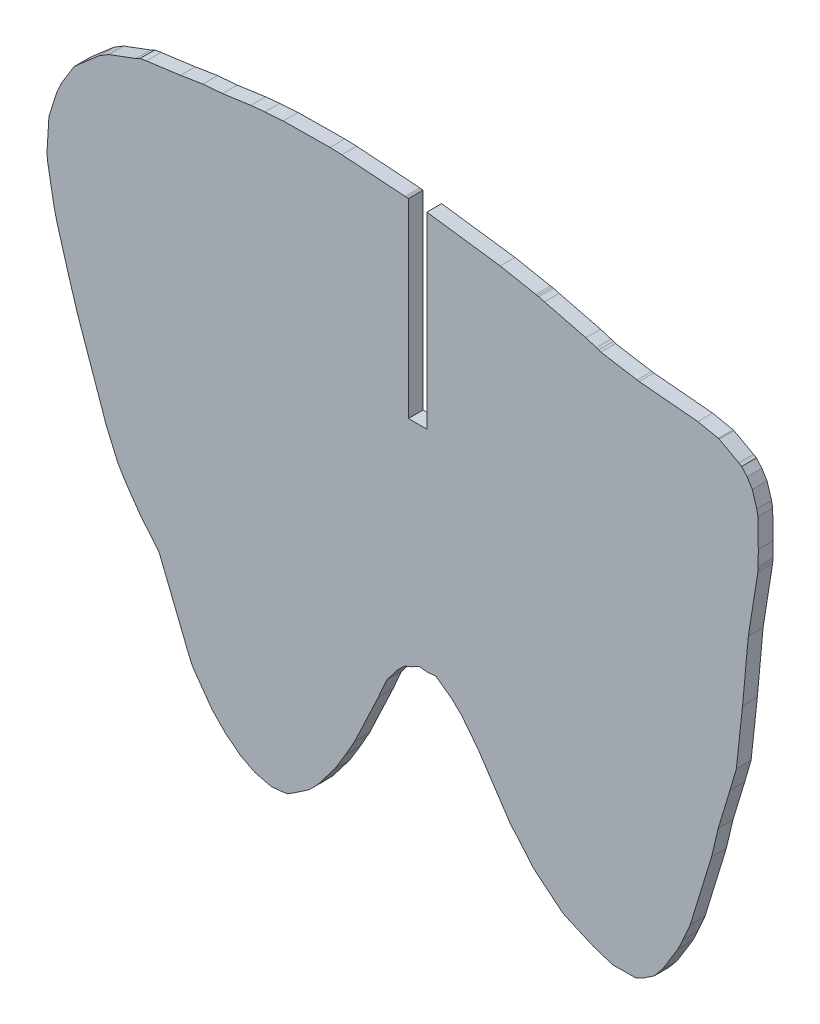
ISO-10303-21;
HEADER;
FILE_DESCRIPTION(('STEP AP214'),'2;1');
FILE_NAME('part.step','',(''),(''),'','','');
FILE_SCHEMA(('AUTOMOTIVE_DESIGN { 1 0 10303 214 1 1 1 1 }'));
ENDSEC;
DATA;
#1=APPLICATION_CONTEXT('core data for automotive mechanical design processes');
#2=APPLICATION_PROTOCOL_DEFINITION('international standard','automotive_design',2000,#1);
#3=PRODUCT_CONTEXT('',#1,'mechanical');
#4=PRODUCT('Part','Part','',(#3));
#5=PRODUCT_RELATED_PRODUCT_CATEGORY('part','',(#4));
#6=PRODUCT_DEFINITION_FORMATION('','',#4);
#7=PRODUCT_DEFINITION_CONTEXT('part definition',#1,'design');
#8=PRODUCT_DEFINITION('design','',#6,#7);
#9=PRODUCT_DEFINITION_SHAPE('','',#8);
#10=(LENGTH_UNIT() NAMED_UNIT(*) SI_UNIT(.MILLI.,.METRE.));
#11=(NAMED_UNIT(*) PLANE_ANGLE_UNIT() SI_UNIT($,.RADIAN.));
#12=(NAMED_UNIT(*) SI_UNIT($,.STERADIAN.) SOLID_ANGLE_UNIT());
#13=UNCERTAINTY_MEASURE_WITH_UNIT(LENGTH_MEASURE(1.E-05),#10,'distance_accuracy_value','');
#14=(GEOMETRIC_REPRESENTATION_CONTEXT(3) GLOBAL_UNCERTAINTY_ASSIGNED_CONTEXT((#13)) GLOBAL_UNIT_ASSIGNED_CONTEXT((#10,
#11,#12)) REPRESENTATION_CONTEXT('',''));
#15=CARTESIAN_POINT('',(0.,0.,0.));
#16=DIRECTION('',(0.,0.,1.));
#17=DIRECTION('',(1.,0.,0.));
#18=AXIS2_PLACEMENT_3D('',#15,#16,#17);
#19=CARTESIAN_POINT('',(-5858.6548,43.307,2.));
#20=DIRECTION('',(-0.16217522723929,-0.986761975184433,0.));
#21=DIRECTION('',(0.986761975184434,-0.16217522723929,0.));
#22=AXIS2_PLACEMENT_3D('',#19,#20,#21);
#23=PLANE('',#22);
#24=DIRECTION('',(-0.986761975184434,0.16217522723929,0.));
#25=VECTOR('',#24,1.);
#26=CARTESIAN_POINT('',(-5858.6548,43.307,0.));
#27=LINE('',#26,#25);
#28=CARTESIAN_POINT('',(-5858.6548,43.307,0.));
#29=VERTEX_POINT('',#28);
#30=CARTESIAN_POINT('',(-5863.5632,44.1137,0.));
#31=VERTEX_POINT('',#30);
#32=EDGE_CURVE('E765',#29,#31,#27,.T.);
#33=ORIENTED_EDGE('',*,*,#32,.T.);
#34=DIRECTION('',(0.,0.,-1.));
#35=VECTOR('',#34,1.);
#36=CARTESIAN_POINT('',(-5863.5632,44.1137,2.));
#37=LINE('',#36,#35);
#38=CARTESIAN_POINT('',(-5863.5632,44.1137,2.));
#39=VERTEX_POINT('',#38);
#40=EDGE_CURVE('E11',#39,#31,#37,.T.);
#41=ORIENTED_EDGE('',*,*,#40,.F.);
#42=DIRECTION('',(-0.986761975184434,0.16217522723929,0.));
#43=VECTOR('',#42,1.);
#44=CARTESIAN_POINT('',(-5858.6548,43.307,2.));
#45=LINE('',#44,#43);
#46=CARTESIAN_POINT('',(-5858.6548,43.307,2.));
#47=VERTEX_POINT('',#46);
#48=EDGE_CURVE('E991',#47,#39,#45,.T.);
#49=ORIENTED_EDGE('',*,*,#48,.F.);
#50=DIRECTION('',(0.,0.,-1.));
#51=VECTOR('',#50,1.);
#52=CARTESIAN_POINT('',(-5858.6548,43.307,2.));
#53=LINE('',#52,#51);
#54=EDGE_CURVE('E761',#47,#29,#53,.T.);
#55=ORIENTED_EDGE('',*,*,#54,.T.);
#56=EDGE_LOOP('',(#33,#41,#49,#55));
#57=FACE_BOUND('',#56,.T.);
#58=ADVANCED_FACE('F39',(#57),#23,.F.);
#59=CARTESIAN_POINT('',(-5863.5632,44.1137,2.));
#60=DIRECTION('',(-0.351593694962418,-0.936152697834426,0.));
#61=DIRECTION('',(0.936152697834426,-0.351593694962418,0.));
#62=AXIS2_PLACEMENT_3D('',#59,#60,#61);
#63=PLANE('',#62);
#64=DIRECTION('',(-0.936152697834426,0.351593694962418,0.));
#65=VECTOR('',#64,1.);
#66=CARTESIAN_POINT('',(-5863.5632,44.1137,0.));
#67=LINE('',#66,#65);
#68=CARTESIAN_POINT('',(-5863.8686,44.2284,0.));
#69=VERTEX_POINT('',#68);
#70=EDGE_CURVE('E768',#31,#69,#67,.T.);
#71=ORIENTED_EDGE('',*,*,#70,.T.);
#72=DIRECTION('',(0.,0.,-1.));
#73=VECTOR('',#72,1.);
#74=CARTESIAN_POINT('',(-5863.8686,44.2284,2.));
#75=LINE('',#74,#73);
#76=CARTESIAN_POINT('',(-5863.8686,44.2284,2.));
#77=VERTEX_POINT('',#76);
#78=EDGE_CURVE('E47',#77,#69,#75,.T.);
#79=ORIENTED_EDGE('',*,*,#78,.F.);
#80=DIRECTION('',(-0.936152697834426,0.351593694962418,0.));
#81=VECTOR('',#80,1.);
#82=CARTESIAN_POINT('',(-5863.5632,44.1137,2.));
#83=LINE('',#82,#81);
#84=EDGE_CURVE('E413',#39,#77,#83,.T.);
#85=ORIENTED_EDGE('',*,*,#84,.F.);
#86=ORIENTED_EDGE('',*,*,#40,.T.);
#87=EDGE_LOOP('',(#71,#79,#85,#86));
#88=FACE_BOUND('',#87,.T.);
#89=ADVANCED_FACE('F1574',(#88),#63,.F.);
#90=CARTESIAN_POINT('',(-5863.8686,44.2284,2.));
#91=DIRECTION('',(-0.351694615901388,-0.936114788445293,0.));
#92=DIRECTION('',(0.936114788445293,-0.351694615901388,0.));
#93=AXIS2_PLACEMENT_3D('',#90,#91,#92);
#94=PLANE('',#93);
#95=DIRECTION('',(-0.936114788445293,0.351694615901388,0.));
#96=VECTOR('',#95,1.);
#97=CARTESIAN_POINT('',(-5863.8686,44.2284,0.));
#98=LINE('',#97,#96);
#99=CARTESIAN_POINT('',(-5864.1739,44.3431,0.));
#100=VERTEX_POINT('',#99);
#101=EDGE_CURVE('E770',#69,#100,#98,.T.);
#102=ORIENTED_EDGE('',*,*,#101,.T.);
#103=DIRECTION('',(0.,0.,-1.));
#104=VECTOR('',#103,1.);
#105=CARTESIAN_POINT('',(-5864.1739,44.3431,2.));
#106=LINE('',#105,#104);
#107=CARTESIAN_POINT('',(-5864.1739,44.3431,2.));
#108=VERTEX_POINT('',#107);
#109=EDGE_CURVE('E1313',#108,#100,#106,.T.);
#110=ORIENTED_EDGE('',*,*,#109,.F.);
#111=DIRECTION('',(-0.936114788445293,0.351694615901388,0.));
#112=VECTOR('',#111,1.);
#113=CARTESIAN_POINT('',(-5863.8686,44.2284,2.));
#114=LINE('',#113,#112);
#115=EDGE_CURVE('E1321',#77,#108,#114,.T.);
#116=ORIENTED_EDGE('',*,*,#115,.F.);
#117=ORIENTED_EDGE('',*,*,#78,.T.);
#118=EDGE_LOOP('',(#102,#110,#116,#117));
#119=FACE_BOUND('',#118,.T.);
#120=ADVANCED_FACE('F1319',(#119),#94,.F.);
#121=CARTESIAN_POINT('',(-5864.1739,44.3431,2.));
#122=DIRECTION('',(-0.29348583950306,-0.955963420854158,0.));
#123=DIRECTION('',(0.955963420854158,-0.29348583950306,0.));
#124=AXIS2_PLACEMENT_3D('',#121,#122,#123);
#125=PLANE('',#124);
#126=DIRECTION('',(-0.955963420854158,0.29348583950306,0.));
#127=VECTOR('',#126,1.);
#128=CARTESIAN_POINT('',(-5864.1739,44.3431,0.));
#129=LINE('',#128,#127);
#130=CARTESIAN_POINT('',(-5865.6071,44.7831,0.));
#131=VERTEX_POINT('',#130);
#132=EDGE_CURVE('E772',#100,#131,#129,.T.);
#133=ORIENTED_EDGE('',*,*,#132,.T.);
#134=DIRECTION('',(0.,0.,-1.));
#135=VECTOR('',#134,1.);
#136=CARTESIAN_POINT('',(-5865.6071,44.7831,2.));
#137=LINE('',#136,#135);
#138=CARTESIAN_POINT('',(-5865.6071,44.7831,2.));
#139=VERTEX_POINT('',#138);
#140=EDGE_CURVE('E1310',#139,#131,#137,.T.);
#141=ORIENTED_EDGE('',*,*,#140,.F.);
#142=DIRECTION('',(-0.955963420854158,0.29348583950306,0.));
#143=VECTOR('',#142,1.);
#144=CARTESIAN_POINT('',(-5864.1739,44.3431,2.));
#145=LINE('',#144,#143);
#146=EDGE_CURVE('E1339',#108,#139,#145,.T.);
#147=ORIENTED_EDGE('',*,*,#146,.F.);
#148=ORIENTED_EDGE('',*,*,#109,.T.);
#149=EDGE_LOOP('',(#133,#141,#147,#148));
#150=FACE_BOUND('',#149,.T.);
#151=ADVANCED_FACE('F1330',(#150),#125,.F.);
#152=CARTESIAN_POINT('',(-5865.6071,44.7831,2.));
#153=DIRECTION('',(-0.243129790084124,-0.969993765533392,0.));
#154=DIRECTION('',(0.969993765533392,-0.243129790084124,0.));
#155=AXIS2_PLACEMENT_3D('',#152,#153,#154);
#156=PLANE('',#155);
#157=DIRECTION('',(-0.969993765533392,0.243129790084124,0.));
#158=VECTOR('',#157,1.);
#159=CARTESIAN_POINT('',(-5865.6071,44.7831,0.));
#160=LINE('',#159,#158);
#161=CARTESIAN_POINT('',(-5871.2149,46.1887,0.));
#162=VERTEX_POINT('',#161);
#163=EDGE_CURVE('E774',#131,#162,#160,.T.);
#164=ORIENTED_EDGE('',*,*,#163,.T.);
#165=DIRECTION('',(0.,0.,-1.));
#166=VECTOR('',#165,1.);
#167=CARTESIAN_POINT('',(-5871.2149,46.1887,2.));
#168=LINE('',#167,#166);
#169=CARTESIAN_POINT('',(-5871.2149,46.1887,2.));
#170=VERTEX_POINT('',#169);
#171=EDGE_CURVE('E1307',#170,#162,#168,.T.);
#172=ORIENTED_EDGE('',*,*,#171,.F.);
#173=DIRECTION('',(-0.969993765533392,0.243129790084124,0.));
#174=VECTOR('',#173,1.);
#175=CARTESIAN_POINT('',(-5865.6071,44.7831,2.));
#176=LINE('',#175,#174);
#177=EDGE_CURVE('E1336',#139,#170,#176,.T.);
#178=ORIENTED_EDGE('',*,*,#177,.F.);
#179=ORIENTED_EDGE('',*,*,#140,.T.);
#180=EDGE_LOOP('',(#164,#172,#178,#179));
#181=FACE_BOUND('',#180,.T.);
#182=ADVANCED_FACE('F1334',(#181),#156,.F.);
#183=CARTESIAN_POINT('',(-5871.2149,46.1887,2.));
#184=DIRECTION('',(-0.282567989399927,-0.9592472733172,0.));
#185=DIRECTION('',(0.9592472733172,-0.282567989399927,0.));
#186=AXIS2_PLACEMENT_3D('',#183,#184,#185);
#187=PLANE('',#186);
#188=DIRECTION('',(-0.9592472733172,0.282567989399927,0.));
#189=VECTOR('',#188,1.);
#190=CARTESIAN_POINT('',(-5871.2149,46.1887,0.));
#191=LINE('',#190,#189);
#192=CARTESIAN_POINT('',(-5871.9777,46.4134,0.));
#193=VERTEX_POINT('',#192);
#194=EDGE_CURVE('E776',#162,#193,#191,.T.);
#195=ORIENTED_EDGE('',*,*,#194,.T.);
#196=DIRECTION('',(0.,0.,-1.));
#197=VECTOR('',#196,1.);
#198=CARTESIAN_POINT('',(-5871.9777,46.4134,2.));
#199=LINE('',#198,#197);
#200=CARTESIAN_POINT('',(-5871.9777,46.4134,2.));
#201=VERTEX_POINT('',#200);
#202=EDGE_CURVE('E1304',#201,#193,#199,.T.);
#203=ORIENTED_EDGE('',*,*,#202,.F.);
#204=DIRECTION('',(-0.9592472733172,0.282567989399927,0.));
#205=VECTOR('',#204,1.);
#206=CARTESIAN_POINT('',(-5871.2149,46.1887,2.));
#207=LINE('',#206,#205);
#208=EDGE_CURVE('E1338',#170,#201,#207,.T.);
#209=ORIENTED_EDGE('',*,*,#208,.F.);
#210=ORIENTED_EDGE('',*,*,#171,.T.);
#211=EDGE_LOOP('',(#195,#203,#209,#210));
#212=FACE_BOUND('',#211,.T.);
#213=ADVANCED_FACE('F1587',(#212),#187,.F.);
#214=CARTESIAN_POINT('',(-5871.9777,46.4134,2.));
#215=DIRECTION('',(-0.13922478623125,-0.990260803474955,0.));
#216=DIRECTION('',(0.990260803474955,-0.13922478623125,0.));
#217=AXIS2_PLACEMENT_3D('',#214,#215,#216);
#218=PLANE('',#217);
#219=DIRECTION('',(-0.990260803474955,0.13922478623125,0.));
#220=VECTOR('',#219,1.);
#221=CARTESIAN_POINT('',(-5871.9777,46.4134,0.));
#222=LINE('',#221,#220);
#223=CARTESIAN_POINT('',(-5872.1797,46.4418,0.));
#224=VERTEX_POINT('',#223);
#225=EDGE_CURVE('E778',#193,#224,#222,.T.);
#226=ORIENTED_EDGE('',*,*,#225,.T.);
#227=DIRECTION('',(0.,0.,-1.));
#228=VECTOR('',#227,1.);
#229=CARTESIAN_POINT('',(-5872.1797,46.4418,2.));
#230=LINE('',#229,#228);
#231=CARTESIAN_POINT('',(-5872.1797,46.4418,2.));
#232=VERTEX_POINT('',#231);
#233=EDGE_CURVE('E1301',#232,#224,#230,.T.);
#234=ORIENTED_EDGE('',*,*,#233,.F.);
#235=DIRECTION('',(-0.990260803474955,0.13922478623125,0.));
#236=VECTOR('',#235,1.);
#237=CARTESIAN_POINT('',(-5871.9777,46.4134,2.));
#238=LINE('',#237,#236);
#239=EDGE_CURVE('E1341',#201,#232,#238,.T.);
#240=ORIENTED_EDGE('',*,*,#239,.F.);
#241=ORIENTED_EDGE('',*,*,#202,.T.);
#242=EDGE_LOOP('',(#226,#234,#240,#241));
#243=FACE_BOUND('',#242,.T.);
#244=ADVANCED_FACE('F1590',(#243),#218,.F.);
#245=CARTESIAN_POINT('',(-5872.1797,46.4418,2.));
#246=DIRECTION('',(-0.139292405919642,-0.990251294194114,0.));
#247=DIRECTION('',(0.990251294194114,-0.139292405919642,0.));
#248=AXIS2_PLACEMENT_3D('',#245,#246,#247);
#249=PLANE('',#248);
#250=DIRECTION('',(-0.990251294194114,0.139292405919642,0.));
#251=VECTOR('',#250,1.);
#252=CARTESIAN_POINT('',(-5872.1797,46.4418,0.));
#253=LINE('',#252,#251);
#254=CARTESIAN_POINT('',(-5872.3816,46.4702,0.));
#255=VERTEX_POINT('',#254);
#256=EDGE_CURVE('E780',#224,#255,#253,.T.);
#257=ORIENTED_EDGE('',*,*,#256,.T.);
#258=DIRECTION('',(0.,0.,-1.));
#259=VECTOR('',#258,1.);
#260=CARTESIAN_POINT('',(-5872.3816,46.4702,2.));
#261=LINE('',#260,#259);
#262=CARTESIAN_POINT('',(-5872.3816,46.4702,2.));
#263=VERTEX_POINT('',#262);
#264=EDGE_CURVE('E1298',#263,#255,#261,.T.);
#265=ORIENTED_EDGE('',*,*,#264,.F.);
#266=DIRECTION('',(-0.990251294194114,0.139292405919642,0.));
#267=VECTOR('',#266,1.);
#268=CARTESIAN_POINT('',(-5872.1797,46.4418,2.));
#269=LINE('',#268,#267);
#270=EDGE_CURVE('E1347',#232,#263,#269,.T.);
#271=ORIENTED_EDGE('',*,*,#270,.F.);
#272=ORIENTED_EDGE('',*,*,#233,.T.);
#273=EDGE_LOOP('',(#257,#265,#271,#272));
#274=FACE_BOUND('',#273,.T.);
#275=ADVANCED_FACE('F1594',(#274),#249,.F.);
#276=CARTESIAN_POINT('',(-5872.3816,46.4702,2.));
#277=DIRECTION('',(-0.190786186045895,-0.981631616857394,0.));
#278=DIRECTION('',(0.981631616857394,-0.190786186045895,0.));
#279=AXIS2_PLACEMENT_3D('',#276,#277,#278);
#280=PLANE('',#279);
#281=DIRECTION('',(-0.981631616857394,0.190786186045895,0.));
#282=VECTOR('',#281,1.);
#283=CARTESIAN_POINT('',(-5872.3816,46.4702,0.));
#284=LINE('',#283,#282);
#285=CARTESIAN_POINT('',(-5877.1975,47.4062,0.));
#286=VERTEX_POINT('',#285);
#287=EDGE_CURVE('E782',#255,#286,#284,.T.);
#288=ORIENTED_EDGE('',*,*,#287,.T.);
#289=DIRECTION('',(0.,0.,-1.));
#290=VECTOR('',#289,1.);
#291=CARTESIAN_POINT('',(-5877.1975,47.4062,2.));
#292=LINE('',#291,#290);
#293=CARTESIAN_POINT('',(-5877.1975,47.4062,2.));
#294=VERTEX_POINT('',#293);
#295=EDGE_CURVE('E1295',#294,#286,#292,.T.);
#296=ORIENTED_EDGE('',*,*,#295,.F.);
#297=DIRECTION('',(-0.981631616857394,0.190786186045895,0.));
#298=VECTOR('',#297,1.);
#299=CARTESIAN_POINT('',(-5872.3816,46.4702,2.));
#300=LINE('',#299,#298);
#301=EDGE_CURVE('E1349',#263,#294,#300,.T.);
#302=ORIENTED_EDGE('',*,*,#301,.F.);
#303=ORIENTED_EDGE('',*,*,#264,.T.);
#304=EDGE_LOOP('',(#288,#296,#302,#303));
#305=FACE_BOUND('',#304,.T.);
#306=ADVANCED_FACE('F1598',(#305),#280,.F.);
#307=CARTESIAN_POINT('',(-5877.1975,47.4062,2.));
#308=DIRECTION('',(-0.13405120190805,-0.99097440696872,0.));
#309=DIRECTION('',(0.99097440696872,-0.13405120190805,0.));
#310=AXIS2_PLACEMENT_3D('',#307,#308,#309);
#311=PLANE('',#310);
#312=DIRECTION('',(-0.99097440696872,0.13405120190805,0.));
#313=VECTOR('',#312,1.);
#314=CARTESIAN_POINT('',(-5877.1975,47.4062,0.));
#315=LINE('',#314,#313);
#316=CARTESIAN_POINT('',(-5887.1419,48.7514,0.));
#317=VERTEX_POINT('',#316);
#318=EDGE_CURVE('E784',#286,#317,#315,.T.);
#319=ORIENTED_EDGE('',*,*,#318,.T.);
#320=DIRECTION('',(0.,0.,-1.));
#321=VECTOR('',#320,1.);
#322=CARTESIAN_POINT('',(-5887.1419,48.7514,2.));
#323=LINE('',#322,#321);
#324=CARTESIAN_POINT('',(-5887.1419,48.7514,2.));
#325=VERTEX_POINT('',#324);
#326=EDGE_CURVE('E1292',#325,#317,#323,.T.);
#327=ORIENTED_EDGE('',*,*,#326,.F.);
#328=DIRECTION('',(-0.99097440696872,0.13405120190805,0.));
#329=VECTOR('',#328,1.);
#330=CARTESIAN_POINT('',(-5877.1975,47.4062,2.));
#331=LINE('',#330,#329);
#332=EDGE_CURVE('E1351',#294,#325,#331,.T.);
#333=ORIENTED_EDGE('',*,*,#332,.F.);
#334=ORIENTED_EDGE('',*,*,#295,.T.);
#335=EDGE_LOOP('',(#319,#327,#333,#334));
#336=FACE_BOUND('',#335,.T.);
#337=ADVANCED_FACE('F1602',(#336),#311,.F.);
#338=CARTESIAN_POINT('',(-5887.1419,48.7514,2.));
#339=DIRECTION('',(1.,0.,0.));
#340=DIRECTION('',(0.,0.,-1.));
#341=AXIS2_PLACEMENT_3D('',#338,#339,#340);
#342=PLANE('',#341);
#343=DIRECTION('',(0.,-1.,0.));
#344=VECTOR('',#343,1.);
#345=CARTESIAN_POINT('',(-5887.1419,48.7514,0.));
#346=LINE('',#345,#344);
#347=CARTESIAN_POINT('',(-5887.1419,23.2852,0.));
#348=VERTEX_POINT('',#347);
#349=EDGE_CURVE('E786',#317,#348,#346,.T.);
#350=ORIENTED_EDGE('',*,*,#349,.T.);
#351=DIRECTION('',(0.,0.,-1.));
#352=VECTOR('',#351,1.);
#353=CARTESIAN_POINT('',(-5887.1419,23.2852,2.));
#354=LINE('',#353,#352);
#355=CARTESIAN_POINT('',(-5887.1419,23.2852,2.));
#356=VERTEX_POINT('',#355);
#357=EDGE_CURVE('E1289',#356,#348,#354,.T.);
#358=ORIENTED_EDGE('',*,*,#357,.F.);
#359=DIRECTION('',(0.,-1.,0.));
#360=VECTOR('',#359,1.);
#361=CARTESIAN_POINT('',(-5887.1419,48.7514,2.));
#362=LINE('',#361,#360);
#363=EDGE_CURVE('E1353',#325,#356,#362,.T.);
#364=ORIENTED_EDGE('',*,*,#363,.F.);
#365=ORIENTED_EDGE('',*,*,#326,.T.);
#366=EDGE_LOOP('',(#350,#358,#364,#365));
#367=FACE_BOUND('',#366,.T.);
#368=ADVANCED_FACE('F1606',(#367),#342,.F.);
#369=CARTESIAN_POINT('',(-5889.3919,23.2852,2.));
#370=DIRECTION('',(0.,-1.,0.));
#371=DIRECTION('',(0.,0.,-1.));
#372=AXIS2_PLACEMENT_3D('',#369,#370,#371);
#373=PLANE('',#372);
#374=DIRECTION('',(-1.,0.,0.));
#375=VECTOR('',#374,1.);
#376=CARTESIAN_POINT('',(-5889.3919,23.2852,0.));
#377=LINE('',#376,#375);
#378=CARTESIAN_POINT('',(-5889.6419,23.2852,0.));
#379=VERTEX_POINT('',#378);
#380=EDGE_CURVE('E789',#348,#379,#377,.T.);
#381=ORIENTED_EDGE('',*,*,#380,.T.);
#382=DIRECTION('',(0.,0.,-1.));
#383=VECTOR('',#382,1.);
#384=CARTESIAN_POINT('',(-5889.6419,23.2852,2.));
#385=LINE('',#384,#383);
#386=CARTESIAN_POINT('',(-5889.6419,23.2852,2.));
#387=VERTEX_POINT('',#386);
#388=EDGE_CURVE('E1286',#387,#379,#385,.T.);
#389=ORIENTED_EDGE('',*,*,#388,.F.);
#390=DIRECTION('',(-1.,0.,0.));
#391=VECTOR('',#390,1.);
#392=CARTESIAN_POINT('',(-5887.1419,23.2852,2.));
#393=LINE('',#392,#391);
#394=EDGE_CURVE('E1355',#356,#387,#393,.T.);
#395=ORIENTED_EDGE('',*,*,#394,.F.);
#396=ORIENTED_EDGE('',*,*,#357,.T.);
#397=EDGE_LOOP('',(#381,#389,#395,#396));
#398=FACE_BOUND('',#397,.T.);
#399=ADVANCED_FACE('F1610',(#398),#373,.F.);
#400=CARTESIAN_POINT('',(-5889.6419,23.2852,2.));
#401=DIRECTION('',(-1.,0.,0.));
#402=DIRECTION('',(0.,0.,1.));
#403=AXIS2_PLACEMENT_3D('',#400,#401,#402);
#404=PLANE('',#403);
#405=DIRECTION('',(0.,1.,0.));
#406=VECTOR('',#405,1.);
#407=CARTESIAN_POINT('',(-5889.6419,23.2852,0.));
#408=LINE('',#407,#406);
#409=CARTESIAN_POINT('',(-5889.6419,49.081,0.));
#410=VERTEX_POINT('',#409);
#411=EDGE_CURVE('E791',#379,#410,#408,.T.);
#412=ORIENTED_EDGE('',*,*,#411,.T.);
#413=DIRECTION('',(0.,0.,-1.));
#414=VECTOR('',#413,1.);
#415=CARTESIAN_POINT('',(-5889.6419,49.081,2.));
#416=LINE('',#415,#414);
#417=CARTESIAN_POINT('',(-5889.6419,49.081,2.));
#418=VERTEX_POINT('',#417);
#419=EDGE_CURVE('E1283',#418,#410,#416,.T.);
#420=ORIENTED_EDGE('',*,*,#419,.F.);
#421=DIRECTION('',(0.,1.,0.));
#422=VECTOR('',#421,1.);
#423=CARTESIAN_POINT('',(-5889.6419,23.2852,2.));
#424=LINE('',#423,#422);
#425=EDGE_CURVE('E1357',#387,#418,#424,.T.);
#426=ORIENTED_EDGE('',*,*,#425,.F.);
#427=ORIENTED_EDGE('',*,*,#388,.T.);
#428=EDGE_LOOP('',(#412,#420,#426,#427));
#429=FACE_BOUND('',#428,.T.);
#430=ADVANCED_FACE('F1614',(#429),#404,.F.);
#431=CARTESIAN_POINT('',(-5889.6419,49.081,2.));
#432=DIRECTION('',(-0.119001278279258,-0.992894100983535,0.));
#433=DIRECTION('',(0.992894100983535,-0.119001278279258,0.));
#434=AXIS2_PLACEMENT_3D('',#431,#432,#433);
#435=PLANE('',#434);
#436=DIRECTION('',(-0.992894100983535,0.119001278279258,0.));
#437=VECTOR('',#436,1.);
#438=CARTESIAN_POINT('',(-5889.6419,49.081,0.));
#439=LINE('',#438,#437);
#440=CARTESIAN_POINT('',(-5889.7779,49.0973,0.));
#441=VERTEX_POINT('',#440);
#442=EDGE_CURVE('E793',#410,#441,#439,.T.);
#443=ORIENTED_EDGE('',*,*,#442,.T.);
#444=DIRECTION('',(0.,0.,-1.));
#445=VECTOR('',#444,1.);
#446=CARTESIAN_POINT('',(-5889.7779,49.0973,2.));
#447=LINE('',#446,#445);
#448=CARTESIAN_POINT('',(-5889.7779,49.0973,2.));
#449=VERTEX_POINT('',#448);
#450=EDGE_CURVE('E1280',#449,#441,#447,.T.);
#451=ORIENTED_EDGE('',*,*,#450,.F.);
#452=DIRECTION('',(-0.992894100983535,0.119001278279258,0.));
#453=VECTOR('',#452,1.);
#454=CARTESIAN_POINT('',(-5889.6419,49.081,2.));
#455=LINE('',#454,#453);
#456=EDGE_CURVE('E1359',#418,#449,#455,.T.);
#457=ORIENTED_EDGE('',*,*,#456,.F.);
#458=ORIENTED_EDGE('',*,*,#419,.T.);
#459=EDGE_LOOP('',(#443,#451,#457,#458));
#460=FACE_BOUND('',#459,.T.);
#461=ADVANCED_FACE('F1618',(#460),#435,.F.);
#462=CARTESIAN_POINT('',(-5889.7779,49.0973,2.));
#463=DIRECTION('',(-0.0904263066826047,-0.995903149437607,0.));
#464=DIRECTION('',(0.995903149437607,-0.0904263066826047,0.));
#465=AXIS2_PLACEMENT_3D('',#462,#463,#464);
#466=PLANE('',#465);
#467=DIRECTION('',(-0.995903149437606,0.0904263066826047,0.));
#468=VECTOR('',#467,1.);
#469=CARTESIAN_POINT('',(-5889.7779,49.0973,0.));
#470=LINE('',#469,#468);
#471=CARTESIAN_POINT('',(-5889.942,49.1122,0.));
#472=VERTEX_POINT('',#471);
#473=EDGE_CURVE('E795',#441,#472,#470,.T.);
#474=ORIENTED_EDGE('',*,*,#473,.T.);
#475=DIRECTION('',(0.,0.,-1.));
#476=VECTOR('',#475,1.);
#477=CARTESIAN_POINT('',(-5889.942,49.1122,2.));
#478=LINE('',#477,#476);
#479=CARTESIAN_POINT('',(-5889.942,49.1122,2.));
#480=VERTEX_POINT('',#479);
#481=EDGE_CURVE('E1277',#480,#472,#478,.T.);
#482=ORIENTED_EDGE('',*,*,#481,.F.);
#483=DIRECTION('',(-0.995903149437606,0.0904263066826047,0.));
#484=VECTOR('',#483,1.);
#485=CARTESIAN_POINT('',(-5889.7779,49.0973,2.));
#486=LINE('',#485,#484);
#487=EDGE_CURVE('E1361',#449,#480,#486,.T.);
#488=ORIENTED_EDGE('',*,*,#487,.F.);
#489=ORIENTED_EDGE('',*,*,#450,.T.);
#490=EDGE_LOOP('',(#474,#482,#488,#489));
#491=FACE_BOUND('',#490,.T.);
#492=ADVANCED_FACE('F1622',(#491),#466,.F.);
#493=CARTESIAN_POINT('',(-5889.942,49.1122,2.));
#494=DIRECTION('',(-0.0898243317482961,-0.995957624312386,0.));
#495=DIRECTION('',(0.995957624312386,-0.0898243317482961,0.));
#496=AXIS2_PLACEMENT_3D('',#493,#494,#495);
#497=PLANE('',#496);
#498=DIRECTION('',(-0.995957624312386,0.0898243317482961,0.));
#499=VECTOR('',#498,1.);
#500=CARTESIAN_POINT('',(-5889.942,49.1122,0.));
#501=LINE('',#500,#499);
#502=CARTESIAN_POINT('',(-5890.1061,49.127,0.));
#503=VERTEX_POINT('',#502);
#504=EDGE_CURVE('E797',#472,#503,#501,.T.);
#505=ORIENTED_EDGE('',*,*,#504,.T.);
#506=DIRECTION('',(0.,0.,-1.));
#507=VECTOR('',#506,1.);
#508=CARTESIAN_POINT('',(-5890.1061,49.127,2.));
#509=LINE('',#508,#507);
#510=CARTESIAN_POINT('',(-5890.1061,49.127,2.));
#511=VERTEX_POINT('',#510);
#512=EDGE_CURVE('E1274',#511,#503,#509,.T.);
#513=ORIENTED_EDGE('',*,*,#512,.F.);
#514=DIRECTION('',(-0.995957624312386,0.0898243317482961,0.));
#515=VECTOR('',#514,1.);
#516=CARTESIAN_POINT('',(-5889.942,49.1122,2.));
#517=LINE('',#516,#515);
#518=EDGE_CURVE('E1363',#480,#511,#517,.T.);
#519=ORIENTED_EDGE('',*,*,#518,.F.);
#520=ORIENTED_EDGE('',*,*,#481,.T.);
#521=EDGE_LOOP('',(#505,#513,#519,#520));
#522=FACE_BOUND('',#521,.T.);
#523=ADVANCED_FACE('F1626',(#522),#497,.F.);
#524=CARTESIAN_POINT('',(-5890.1061,49.127,2.));
#525=DIRECTION('',(-0.0702074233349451,-0.997532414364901,0.));
#526=DIRECTION('',(0.997532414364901,-0.0702074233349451,0.));
#527=AXIS2_PLACEMENT_3D('',#524,#525,#526);
#528=PLANE('',#527);
#529=DIRECTION('',(-0.997532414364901,0.0702074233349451,0.));
#530=VECTOR('',#529,1.);
#531=CARTESIAN_POINT('',(-5890.1061,49.127,0.));
#532=LINE('',#531,#530);
#533=CARTESIAN_POINT('',(-5898.6709,49.7298,0.));
#534=VERTEX_POINT('',#533);
#535=EDGE_CURVE('E799',#503,#534,#532,.T.);
#536=ORIENTED_EDGE('',*,*,#535,.T.);
#537=DIRECTION('',(0.,0.,-1.));
#538=VECTOR('',#537,1.);
#539=CARTESIAN_POINT('',(-5898.6709,49.7298,2.));
#540=LINE('',#539,#538);
#541=CARTESIAN_POINT('',(-5898.6709,49.7298,2.));
#542=VERTEX_POINT('',#541);
#543=EDGE_CURVE('E1271',#542,#534,#540,.T.);
#544=ORIENTED_EDGE('',*,*,#543,.F.);
#545=DIRECTION('',(-0.997532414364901,0.0702074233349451,0.));
#546=VECTOR('',#545,1.);
#547=CARTESIAN_POINT('',(-5890.1061,49.127,2.));
#548=LINE('',#547,#546);
#549=EDGE_CURVE('E1365',#511,#542,#548,.T.);
#550=ORIENTED_EDGE('',*,*,#549,.F.);
#551=ORIENTED_EDGE('',*,*,#512,.T.);
#552=EDGE_LOOP('',(#536,#544,#550,#551));
#553=FACE_BOUND('',#552,.T.);
#554=ADVANCED_FACE('F1630',(#553),#528,.F.);
#555=CARTESIAN_POINT('',(-5898.6709,49.7298,2.));
#556=DIRECTION('',(-0.0339118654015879,-0.999424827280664,0.));
#557=DIRECTION('',(0.999424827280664,-0.0339118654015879,0.));
#558=AXIS2_PLACEMENT_3D('',#555,#556,#557);
#559=PLANE('',#558);
#560=DIRECTION('',(-0.999424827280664,0.0339118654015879,0.));
#561=VECTOR('',#560,1.);
#562=CARTESIAN_POINT('',(-5898.6709,49.7298,0.));
#563=LINE('',#562,#561);
#564=CARTESIAN_POINT('',(-5900.2594,49.7837,0.));
#565=VERTEX_POINT('',#564);
#566=EDGE_CURVE('E801',#534,#565,#563,.T.);
#567=ORIENTED_EDGE('',*,*,#566,.T.);
#568=DIRECTION('',(0.,0.,-1.));
#569=VECTOR('',#568,1.);
#570=CARTESIAN_POINT('',(-5900.2594,49.7837,2.));
#571=LINE('',#570,#569);
#572=CARTESIAN_POINT('',(-5900.2594,49.7837,2.));
#573=VERTEX_POINT('',#572);
#574=EDGE_CURVE('E1268',#573,#565,#571,.T.);
#575=ORIENTED_EDGE('',*,*,#574,.F.);
#576=DIRECTION('',(-0.999424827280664,0.0339118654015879,0.));
#577=VECTOR('',#576,1.);
#578=CARTESIAN_POINT('',(-5898.6709,49.7298,2.));
#579=LINE('',#578,#577);
#580=EDGE_CURVE('E1367',#542,#573,#579,.T.);
#581=ORIENTED_EDGE('',*,*,#580,.F.);
#582=ORIENTED_EDGE('',*,*,#543,.T.);
#583=EDGE_LOOP('',(#567,#575,#581,#582));
#584=FACE_BOUND('',#583,.T.);
#585=ADVANCED_FACE('F1634',(#584),#559,.F.);
#586=CARTESIAN_POINT('',(-5900.2594,49.7837,2.));
#587=DIRECTION('',(0.0106099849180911,-0.999943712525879,0.));
#588=DIRECTION('',(0.999943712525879,0.0106099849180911,0.));
#589=AXIS2_PLACEMENT_3D('',#586,#587,#588);
#590=PLANE('',#589);
#591=DIRECTION('',(-0.999943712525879,-0.0106099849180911,0.));
#592=VECTOR('',#591,1.);
#593=CARTESIAN_POINT('',(-5900.2594,49.7837,0.));
#594=LINE('',#593,#592);
#595=CARTESIAN_POINT('',(-5906.5927,49.7165,0.));
#596=VERTEX_POINT('',#595);
#597=EDGE_CURVE('E803',#565,#596,#594,.T.);
#598=ORIENTED_EDGE('',*,*,#597,.T.);
#599=DIRECTION('',(0.,0.,-1.));
#600=VECTOR('',#599,1.);
#601=CARTESIAN_POINT('',(-5906.5927,49.7165,2.));
#602=LINE('',#601,#600);
#603=CARTESIAN_POINT('',(-5906.5927,49.7165,2.));
#604=VERTEX_POINT('',#603);
#605=EDGE_CURVE('E1265',#604,#596,#602,.T.);
#606=ORIENTED_EDGE('',*,*,#605,.F.);
#607=DIRECTION('',(-0.999943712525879,-0.0106099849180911,0.));
#608=VECTOR('',#607,1.);
#609=CARTESIAN_POINT('',(-5900.2594,49.7837,2.));
#610=LINE('',#609,#608);
#611=EDGE_CURVE('E1369',#573,#604,#610,.T.);
#612=ORIENTED_EDGE('',*,*,#611,.F.);
#613=ORIENTED_EDGE('',*,*,#574,.T.);
#614=EDGE_LOOP('',(#598,#606,#612,#613));
#615=FACE_BOUND('',#614,.T.);
#616=ADVANCED_FACE('F1638',(#615),#590,.F.);
#617=CARTESIAN_POINT('',(-5906.5927,49.7165,2.));
#618=DIRECTION('',(0.069234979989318,-0.997600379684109,0.));
#619=DIRECTION('',(0.997600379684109,0.069234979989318,0.));
#620=AXIS2_PLACEMENT_3D('',#617,#618,#619);
#621=PLANE('',#620);
#622=DIRECTION('',(-0.997600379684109,-0.069234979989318,0.));
#623=VECTOR('',#622,1.);
#624=CARTESIAN_POINT('',(-5906.5927,49.7165,0.));
#625=LINE('',#624,#623);
#626=CARTESIAN_POINT('',(-5909.084,49.5436,0.));
#627=VERTEX_POINT('',#626);
#628=EDGE_CURVE('E805',#596,#627,#625,.T.);
#629=ORIENTED_EDGE('',*,*,#628,.T.);
#630=DIRECTION('',(0.,0.,-1.));
#631=VECTOR('',#630,1.);
#632=CARTESIAN_POINT('',(-5909.084,49.5436,2.));
#633=LINE('',#632,#631);
#634=CARTESIAN_POINT('',(-5909.084,49.5436,2.));
#635=VERTEX_POINT('',#634);
#636=EDGE_CURVE('E1262',#635,#627,#633,.T.);
#637=ORIENTED_EDGE('',*,*,#636,.F.);
#638=DIRECTION('',(-0.997600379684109,-0.069234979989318,0.));
#639=VECTOR('',#638,1.);
#640=CARTESIAN_POINT('',(-5906.5927,49.7165,2.));
#641=LINE('',#640,#639);
#642=EDGE_CURVE('E1371',#604,#635,#641,.T.);
#643=ORIENTED_EDGE('',*,*,#642,.F.);
#644=ORIENTED_EDGE('',*,*,#605,.T.);
#645=EDGE_LOOP('',(#629,#637,#643,#644));
#646=FACE_BOUND('',#645,.T.);
#647=ADVANCED_FACE('F1642',(#646),#621,.F.);
#648=CARTESIAN_POINT('',(-5909.084,49.5436,2.));
#649=DIRECTION('',(0.0973849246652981,-0.995246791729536,0.));
#650=DIRECTION('',(0.995246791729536,0.0973849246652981,0.));
#651=AXIS2_PLACEMENT_3D('',#648,#649,#650);
#652=PLANE('',#651);
#653=DIRECTION('',(-0.995246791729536,-0.0973849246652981,0.));
#654=VECTOR('',#653,1.);
#655=CARTESIAN_POINT('',(-5909.084,49.5436,0.));
#656=LINE('',#655,#654);
#657=CARTESIAN_POINT('',(-5910.991,49.357,0.));
#658=VERTEX_POINT('',#657);
#659=EDGE_CURVE('E807',#627,#658,#656,.T.);
#660=ORIENTED_EDGE('',*,*,#659,.T.);
#661=DIRECTION('',(0.,0.,-1.));
#662=VECTOR('',#661,1.);
#663=CARTESIAN_POINT('',(-5910.991,49.357,2.));
#664=LINE('',#663,#662);
#665=CARTESIAN_POINT('',(-5910.991,49.357,2.));
#666=VERTEX_POINT('',#665);
#667=EDGE_CURVE('E1259',#666,#658,#664,.T.);
#668=ORIENTED_EDGE('',*,*,#667,.F.);
#669=DIRECTION('',(-0.995246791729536,-0.0973849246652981,0.));
#670=VECTOR('',#669,1.);
#671=CARTESIAN_POINT('',(-5909.084,49.5436,2.));
#672=LINE('',#671,#670);
#673=EDGE_CURVE('E1373',#635,#666,#672,.T.);
#674=ORIENTED_EDGE('',*,*,#673,.F.);
#675=ORIENTED_EDGE('',*,*,#636,.T.);
#676=EDGE_LOOP('',(#660,#668,#674,#675));
#677=FACE_BOUND('',#676,.T.);
#678=ADVANCED_FACE('F1646',(#677),#652,.F.);
#679=CARTESIAN_POINT('',(-5910.991,49.357,2.));
#680=DIRECTION('',(0.139296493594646,-0.990250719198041,0.));
#681=DIRECTION('',(0.990250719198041,0.139296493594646,0.));
#682=AXIS2_PLACEMENT_3D('',#679,#680,#681);
#683=PLANE('',#682);
#684=DIRECTION('',(-0.990250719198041,-0.139296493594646,0.));
#685=VECTOR('',#684,1.);
#686=CARTESIAN_POINT('',(-5910.991,49.357,0.));
#687=LINE('',#686,#685);
#688=CARTESIAN_POINT('',(-5914.8149,48.8191,0.));
#689=VERTEX_POINT('',#688);
#690=EDGE_CURVE('E809',#658,#689,#687,.T.);
#691=ORIENTED_EDGE('',*,*,#690,.T.);
#692=DIRECTION('',(0.,0.,-1.));
#693=VECTOR('',#692,1.);
#694=CARTESIAN_POINT('',(-5914.8149,48.8191,2.));
#695=LINE('',#694,#693);
#696=CARTESIAN_POINT('',(-5914.8149,48.8191,2.));
#697=VERTEX_POINT('',#696);
#698=EDGE_CURVE('E1256',#697,#689,#695,.T.);
#699=ORIENTED_EDGE('',*,*,#698,.F.);
#700=DIRECTION('',(-0.990250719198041,-0.139296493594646,0.));
#701=VECTOR('',#700,1.);
#702=CARTESIAN_POINT('',(-5910.991,49.357,2.));
#703=LINE('',#702,#701);
#704=EDGE_CURVE('E1375',#666,#697,#703,.T.);
#705=ORIENTED_EDGE('',*,*,#704,.F.);
#706=ORIENTED_EDGE('',*,*,#667,.T.);
#707=EDGE_LOOP('',(#691,#699,#705,#706));
#708=FACE_BOUND('',#707,.T.);
#709=ADVANCED_FACE('F1650',(#708),#683,.F.);
#710=CARTESIAN_POINT('',(-5914.8149,48.8191,2.));
#711=DIRECTION('',(0.0815709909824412,-0.996667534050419,0.));
#712=DIRECTION('',(0.996667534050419,0.0815709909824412,0.));
#713=AXIS2_PLACEMENT_3D('',#710,#711,#712);
#714=PLANE('',#713);
#715=DIRECTION('',(-0.996667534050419,-0.0815709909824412,0.));
#716=VECTOR('',#715,1.);
#717=CARTESIAN_POINT('',(-5914.8149,48.8191,0.));
#718=LINE('',#717,#716);
#719=CARTESIAN_POINT('',(-5917.4834,48.6007,0.));
#720=VERTEX_POINT('',#719);
#721=EDGE_CURVE('E811',#689,#720,#718,.T.);
#722=ORIENTED_EDGE('',*,*,#721,.T.);
#723=DIRECTION('',(0.,0.,-1.));
#724=VECTOR('',#723,1.);
#725=CARTESIAN_POINT('',(-5917.4834,48.6007,2.));
#726=LINE('',#725,#724);
#727=CARTESIAN_POINT('',(-5917.4834,48.6007,2.));
#728=VERTEX_POINT('',#727);
#729=EDGE_CURVE('E1253',#728,#720,#726,.T.);
#730=ORIENTED_EDGE('',*,*,#729,.F.);
#731=DIRECTION('',(-0.996667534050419,-0.0815709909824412,0.));
#732=VECTOR('',#731,1.);
#733=CARTESIAN_POINT('',(-5914.8149,48.8191,2.));
#734=LINE('',#733,#732);
#735=EDGE_CURVE('E1377',#697,#728,#734,.T.);
#736=ORIENTED_EDGE('',*,*,#735,.F.);
#737=ORIENTED_EDGE('',*,*,#698,.T.);
#738=EDGE_LOOP('',(#722,#730,#736,#737));
#739=FACE_BOUND('',#738,.T.);
#740=ADVANCED_FACE('F1654',(#739),#714,.F.);
#741=CARTESIAN_POINT('',(-5917.4834,48.6007,2.));
#742=DIRECTION('',(0.156714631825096,-0.987643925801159,0.));
#743=DIRECTION('',(0.987643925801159,0.156714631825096,0.));
#744=AXIS2_PLACEMENT_3D('',#741,#742,#743);
#745=PLANE('',#744);
#746=DIRECTION('',(-0.987643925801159,-0.156714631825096,0.));
#747=VECTOR('',#746,1.);
#748=CARTESIAN_POINT('',(-5917.4834,48.6007,0.));
#749=LINE('',#748,#747);
#750=CARTESIAN_POINT('',(-5920.5179,48.1192,0.));
#751=VERTEX_POINT('',#750);
#752=EDGE_CURVE('E813',#720,#751,#749,.T.);
#753=ORIENTED_EDGE('',*,*,#752,.T.);
#754=DIRECTION('',(0.,0.,-1.));
#755=VECTOR('',#754,1.);
#756=CARTESIAN_POINT('',(-5920.5179,48.1192,2.));
#757=LINE('',#756,#755);
#758=CARTESIAN_POINT('',(-5920.5179,48.1192,2.));
#759=VERTEX_POINT('',#758);
#760=EDGE_CURVE('E1250',#759,#751,#757,.T.);
#761=ORIENTED_EDGE('',*,*,#760,.F.);
#762=DIRECTION('',(-0.987643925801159,-0.156714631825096,0.));
#763=VECTOR('',#762,1.);
#764=CARTESIAN_POINT('',(-5917.4834,48.6007,2.));
#765=LINE('',#764,#763);
#766=EDGE_CURVE('E1379',#728,#759,#765,.T.);
#767=ORIENTED_EDGE('',*,*,#766,.F.);
#768=ORIENTED_EDGE('',*,*,#729,.T.);
#769=EDGE_LOOP('',(#753,#761,#767,#768));
#770=FACE_BOUND('',#769,.T.);
#771=ADVANCED_FACE('F1658',(#770),#745,.F.);
#772=CARTESIAN_POINT('',(-5920.5179,48.1192,2.));
#773=DIRECTION('',(0.134253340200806,-0.990947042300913,0.));
#774=DIRECTION('',(0.990947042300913,0.134253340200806,0.));
#775=AXIS2_PLACEMENT_3D('',#772,#773,#774);
#776=PLANE('',#775);
#777=DIRECTION('',(-0.990947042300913,-0.134253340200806,0.));
#778=VECTOR('',#777,1.);
#779=CARTESIAN_POINT('',(-5920.5179,48.1192,0.));
#780=LINE('',#779,#778);
#781=CARTESIAN_POINT('',(-5925.1518,47.4914,0.));
#782=VERTEX_POINT('',#781);
#783=EDGE_CURVE('E815',#751,#782,#780,.T.);
#784=ORIENTED_EDGE('',*,*,#783,.T.);
#785=DIRECTION('',(0.,0.,-1.));
#786=VECTOR('',#785,1.);
#787=CARTESIAN_POINT('',(-5925.1518,47.4914,2.));
#788=LINE('',#787,#786);
#789=CARTESIAN_POINT('',(-5925.1518,47.4914,2.));
#790=VERTEX_POINT('',#789);
#791=EDGE_CURVE('E1247',#790,#782,#788,.T.);
#792=ORIENTED_EDGE('',*,*,#791,.F.);
#793=DIRECTION('',(-0.990947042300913,-0.134253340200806,0.));
#794=VECTOR('',#793,1.);
#795=CARTESIAN_POINT('',(-5920.5179,48.1192,2.));
#796=LINE('',#795,#794);
#797=EDGE_CURVE('E1381',#759,#790,#796,.T.);
#798=ORIENTED_EDGE('',*,*,#797,.F.);
#799=ORIENTED_EDGE('',*,*,#760,.T.);
#800=EDGE_LOOP('',(#784,#792,#798,#799));
#801=FACE_BOUND('',#800,.T.);
#802=ADVANCED_FACE('F1662',(#801),#776,.F.);
#803=CARTESIAN_POINT('',(-5925.1518,47.4914,2.));
#804=DIRECTION('',(0.154709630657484,-0.98795998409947,0.));
#805=DIRECTION('',(0.98795998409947,0.154709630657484,0.));
#806=AXIS2_PLACEMENT_3D('',#803,#804,#805);
#807=PLANE('',#806);
#808=DIRECTION('',(-0.98795998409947,-0.154709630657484,0.));
#809=VECTOR('',#808,1.);
#810=CARTESIAN_POINT('',(-5925.1518,47.4914,0.));
#811=LINE('',#810,#809);
#812=CARTESIAN_POINT('',(-5925.9941,47.3595,0.));
#813=VERTEX_POINT('',#812);
#814=EDGE_CURVE('E817',#782,#813,#811,.T.);
#815=ORIENTED_EDGE('',*,*,#814,.T.);
#816=DIRECTION('',(0.,0.,-1.));
#817=VECTOR('',#816,1.);
#818=CARTESIAN_POINT('',(-5925.9941,47.3595,2.));
#819=LINE('',#818,#817);
#820=CARTESIAN_POINT('',(-5925.9941,47.3595,2.));
#821=VERTEX_POINT('',#820);
#822=EDGE_CURVE('E1244',#821,#813,#819,.T.);
#823=ORIENTED_EDGE('',*,*,#822,.F.);
#824=DIRECTION('',(-0.98795998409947,-0.154709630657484,0.));
#825=VECTOR('',#824,1.);
#826=CARTESIAN_POINT('',(-5925.1518,47.4914,2.));
#827=LINE('',#826,#825);
#828=EDGE_CURVE('E1383',#790,#821,#827,.T.);
#829=ORIENTED_EDGE('',*,*,#828,.F.);
#830=ORIENTED_EDGE('',*,*,#791,.T.);
#831=EDGE_LOOP('',(#815,#823,#829,#830));
#832=FACE_BOUND('',#831,.T.);
#833=ADVANCED_FACE('F1666',(#832),#807,.F.);
#834=CARTESIAN_POINT('',(-5925.9941,47.3595,2.));
#835=DIRECTION('',(0.455467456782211,-0.89025243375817,0.));
#836=DIRECTION('',(0.89025243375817,0.455467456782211,0.));
#837=AXIS2_PLACEMENT_3D('',#834,#835,#836);
#838=PLANE('',#837);
#839=DIRECTION('',(-0.89025243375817,-0.455467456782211,0.));
#840=VECTOR('',#839,1.);
#841=CARTESIAN_POINT('',(-5925.9941,47.3595,0.));
#842=LINE('',#841,#840);
#843=CARTESIAN_POINT('',(-5926.5838,47.0578,0.));
#844=VERTEX_POINT('',#843);
#845=EDGE_CURVE('E819',#813,#844,#842,.T.);
#846=ORIENTED_EDGE('',*,*,#845,.T.);
#847=DIRECTION('',(0.,0.,-1.));
#848=VECTOR('',#847,1.);
#849=CARTESIAN_POINT('',(-5926.5838,47.0578,2.));
#850=LINE('',#849,#848);
#851=CARTESIAN_POINT('',(-5926.5838,47.0578,2.));
#852=VERTEX_POINT('',#851);
#853=EDGE_CURVE('E1241',#852,#844,#850,.T.);
#854=ORIENTED_EDGE('',*,*,#853,.F.);
#855=DIRECTION('',(-0.89025243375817,-0.455467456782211,0.));
#856=VECTOR('',#855,1.);
#857=CARTESIAN_POINT('',(-5925.9941,47.3595,2.));
#858=LINE('',#857,#856);
#859=EDGE_CURVE('E1385',#821,#852,#858,.T.);
#860=ORIENTED_EDGE('',*,*,#859,.F.);
#861=ORIENTED_EDGE('',*,*,#822,.T.);
#862=EDGE_LOOP('',(#846,#854,#860,#861));
#863=FACE_BOUND('',#862,.T.);
#864=ADVANCED_FACE('F1670',(#863),#838,.F.);
#865=CARTESIAN_POINT('',(-5926.5838,47.0578,2.));
#866=DIRECTION('',(0.348944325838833,-0.937143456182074,0.));
#867=DIRECTION('',(0.937143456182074,0.348944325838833,0.));
#868=AXIS2_PLACEMENT_3D('',#865,#866,#867);
#869=PLANE('',#868);
#870=DIRECTION('',(-0.937143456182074,-0.348944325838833,0.));
#871=VECTOR('',#870,1.);
#872=CARTESIAN_POINT('',(-5926.5838,47.0578,0.));
#873=LINE('',#872,#871);
#874=CARTESIAN_POINT('',(-5930.2285,45.7007,0.));
#875=VERTEX_POINT('',#874);
#876=EDGE_CURVE('E821',#844,#875,#873,.T.);
#877=ORIENTED_EDGE('',*,*,#876,.T.);
#878=DIRECTION('',(0.,0.,-1.));
#879=VECTOR('',#878,1.);
#880=CARTESIAN_POINT('',(-5930.2285,45.7007,2.));
#881=LINE('',#880,#879);
#882=CARTESIAN_POINT('',(-5930.2285,45.7007,2.));
#883=VERTEX_POINT('',#882);
#884=EDGE_CURVE('E1238',#883,#875,#881,.T.);
#885=ORIENTED_EDGE('',*,*,#884,.F.);
#886=DIRECTION('',(-0.937143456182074,-0.348944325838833,0.));
#887=VECTOR('',#886,1.);
#888=CARTESIAN_POINT('',(-5926.5838,47.0578,2.));
#889=LINE('',#888,#887);
#890=EDGE_CURVE('E1387',#852,#883,#889,.T.);
#891=ORIENTED_EDGE('',*,*,#890,.F.);
#892=ORIENTED_EDGE('',*,*,#853,.T.);
#893=EDGE_LOOP('',(#877,#885,#891,#892));
#894=FACE_BOUND('',#893,.T.);
#895=ADVANCED_FACE('F1674',(#894),#869,.F.);
#896=CARTESIAN_POINT('',(-5930.2285,45.7007,2.));
#897=DIRECTION('',(0.517979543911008,-0.855393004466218,0.));
#898=DIRECTION('',(0.855393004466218,0.517979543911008,0.));
#899=AXIS2_PLACEMENT_3D('',#896,#897,#898);
#900=PLANE('',#899);
#901=DIRECTION('',(-0.855393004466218,-0.517979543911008,0.));
#902=VECTOR('',#901,1.);
#903=CARTESIAN_POINT('',(-5930.2285,45.7007,0.));
#904=LINE('',#903,#902);
#905=CARTESIAN_POINT('',(-5931.5232,44.9167,0.));
#906=VERTEX_POINT('',#905);
#907=EDGE_CURVE('E823',#875,#906,#904,.T.);
#908=ORIENTED_EDGE('',*,*,#907,.T.);
#909=DIRECTION('',(0.,0.,-1.));
#910=VECTOR('',#909,1.);
#911=CARTESIAN_POINT('',(-5931.5232,44.9167,2.));
#912=LINE('',#911,#910);
#913=CARTESIAN_POINT('',(-5931.5232,44.9167,2.));
#914=VERTEX_POINT('',#913);
#915=EDGE_CURVE('E1235',#914,#906,#912,.T.);
#916=ORIENTED_EDGE('',*,*,#915,.F.);
#917=DIRECTION('',(-0.855393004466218,-0.517979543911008,0.));
#918=VECTOR('',#917,1.);
#919=CARTESIAN_POINT('',(-5930.2285,45.7007,2.));
#920=LINE('',#919,#918);
#921=EDGE_CURVE('E1389',#883,#914,#920,.T.);
#922=ORIENTED_EDGE('',*,*,#921,.F.);
#923=ORIENTED_EDGE('',*,*,#884,.T.);
#924=EDGE_LOOP('',(#908,#916,#922,#923));
#925=FACE_BOUND('',#924,.T.);
#926=ADVANCED_FACE('F1678',(#925),#900,.F.);
#927=CARTESIAN_POINT('',(-5931.5232,44.9167,2.));
#928=DIRECTION('',(0.652752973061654,-0.757570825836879,0.));
#929=DIRECTION('',(0.757570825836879,0.652752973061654,0.));
#930=AXIS2_PLACEMENT_3D('',#927,#928,#929);
#931=PLANE('',#930);
#932=DIRECTION('',(-0.757570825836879,-0.652752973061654,0.));
#933=VECTOR('',#932,1.);
#934=CARTESIAN_POINT('',(-5931.5232,44.9167,0.));
#935=LINE('',#934,#933);
#936=CARTESIAN_POINT('',(-5934.2935,42.5297,0.));
#937=VERTEX_POINT('',#936);
#938=EDGE_CURVE('E825',#906,#937,#935,.T.);
#939=ORIENTED_EDGE('',*,*,#938,.T.);
#940=DIRECTION('',(0.,0.,-1.));
#941=VECTOR('',#940,1.);
#942=CARTESIAN_POINT('',(-5934.2935,42.5297,2.));
#943=LINE('',#942,#941);
#944=CARTESIAN_POINT('',(-5934.2935,42.5297,2.));
#945=VERTEX_POINT('',#944);
#946=EDGE_CURVE('E1232',#945,#937,#943,.T.);
#947=ORIENTED_EDGE('',*,*,#946,.F.);
#948=DIRECTION('',(-0.757570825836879,-0.652752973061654,0.));
#949=VECTOR('',#948,1.);
#950=CARTESIAN_POINT('',(-5931.5232,44.9167,2.));
#951=LINE('',#950,#949);
#952=EDGE_CURVE('E1391',#914,#945,#951,.T.);
#953=ORIENTED_EDGE('',*,*,#952,.F.);
#954=ORIENTED_EDGE('',*,*,#915,.T.);
#955=EDGE_LOOP('',(#939,#947,#953,#954));
#956=FACE_BOUND('',#955,.T.);
#957=ADVANCED_FACE('F1682',(#956),#931,.F.);
#958=CARTESIAN_POINT('',(-5934.2935,42.5297,2.));
#959=DIRECTION('',(0.681456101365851,-0.731858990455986,0.));
#960=DIRECTION('',(0.731858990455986,0.681456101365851,0.));
#961=AXIS2_PLACEMENT_3D('',#958,#959,#960);
#962=PLANE('',#961);
#963=DIRECTION('',(-0.731858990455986,-0.681456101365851,0.));
#964=VECTOR('',#963,1.);
#965=CARTESIAN_POINT('',(-5934.2935,42.5297,0.));
#966=LINE('',#965,#964);
#967=CARTESIAN_POINT('',(-5934.9411,41.9267,0.));
#968=VERTEX_POINT('',#967);
#969=EDGE_CURVE('E827',#937,#968,#966,.T.);
#970=ORIENTED_EDGE('',*,*,#969,.T.);
#971=DIRECTION('',(0.,0.,-1.));
#972=VECTOR('',#971,1.);
#973=CARTESIAN_POINT('',(-5934.9411,41.9267,2.));
#974=LINE('',#973,#972);
#975=CARTESIAN_POINT('',(-5934.9411,41.9267,2.));
#976=VERTEX_POINT('',#975);
#977=EDGE_CURVE('E1229',#976,#968,#974,.T.);
#978=ORIENTED_EDGE('',*,*,#977,.F.);
#979=DIRECTION('',(-0.731858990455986,-0.681456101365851,0.));
#980=VECTOR('',#979,1.);
#981=CARTESIAN_POINT('',(-5934.2935,42.5297,2.));
#982=LINE('',#981,#980);
#983=EDGE_CURVE('E1393',#945,#976,#982,.T.);
#984=ORIENTED_EDGE('',*,*,#983,.F.);
#985=ORIENTED_EDGE('',*,*,#946,.T.);
#986=EDGE_LOOP('',(#970,#978,#984,#985));
#987=FACE_BOUND('',#986,.T.);
#988=ADVANCED_FACE('F1686',(#987),#962,.F.);
#989=CARTESIAN_POINT('',(-5934.9411,41.9267,2.));
#990=DIRECTION('',(0.852217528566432,-0.523187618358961,0.));
#991=DIRECTION('',(0.523187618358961,0.852217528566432,0.));
#992=AXIS2_PLACEMENT_3D('',#989,#990,#991);
#993=PLANE('',#992);
#994=DIRECTION('',(-0.523187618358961,-0.852217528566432,0.));
#995=VECTOR('',#994,1.);
#996=CARTESIAN_POINT('',(-5934.9411,41.9267,0.));
#997=LINE('',#996,#995);
#998=CARTESIAN_POINT('',(-5936.6293,39.1768,0.));
#999=VERTEX_POINT('',#998);
#1000=EDGE_CURVE('E829',#968,#999,#997,.T.);
#1001=ORIENTED_EDGE('',*,*,#1000,.T.);
#1002=DIRECTION('',(0.,0.,-1.));
#1003=VECTOR('',#1002,1.);
#1004=CARTESIAN_POINT('',(-5936.6293,39.1768,2.));
#1005=LINE('',#1004,#1003);
#1006=CARTESIAN_POINT('',(-5936.6293,39.1768,2.));
#1007=VERTEX_POINT('',#1006);
#1008=EDGE_CURVE('E1226',#1007,#999,#1005,.T.);
#1009=ORIENTED_EDGE('',*,*,#1008,.F.);
#1010=DIRECTION('',(-0.523187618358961,-0.852217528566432,0.));
#1011=VECTOR('',#1010,1.);
#1012=CARTESIAN_POINT('',(-5934.9411,41.9267,2.));
#1013=LINE('',#1012,#1011);
#1014=EDGE_CURVE('E1395',#976,#1007,#1013,.T.);
#1015=ORIENTED_EDGE('',*,*,#1014,.F.);
#1016=ORIENTED_EDGE('',*,*,#977,.T.);
#1017=EDGE_LOOP('',(#1001,#1009,#1015,#1016));
#1018=FACE_BOUND('',#1017,.T.);
#1019=ADVANCED_FACE('F1690',(#1018),#993,.F.);
#1020=CARTESIAN_POINT('',(-5936.6293,39.1768,2.));
#1021=DIRECTION('',(0.909149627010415,-0.416469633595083,0.));
#1022=DIRECTION('',(0.416469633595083,0.909149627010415,0.));
#1023=AXIS2_PLACEMENT_3D('',#1020,#1021,#1022);
#1024=PLANE('',#1023);
#1025=DIRECTION('',(-0.416469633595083,-0.909149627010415,0.));
#1026=VECTOR('',#1025,1.);
#1027=CARTESIAN_POINT('',(-5936.6293,39.1768,0.));
#1028=LINE('',#1027,#1026);
#1029=CARTESIAN_POINT('',(-5937.2337,37.8574,0.));
#1030=VERTEX_POINT('',#1029);
#1031=EDGE_CURVE('E831',#999,#1030,#1028,.T.);
#1032=ORIENTED_EDGE('',*,*,#1031,.T.);
#1033=DIRECTION('',(0.,0.,-1.));
#1034=VECTOR('',#1033,1.);
#1035=CARTESIAN_POINT('',(-5937.2337,37.8574,2.));
#1036=LINE('',#1035,#1034);
#1037=CARTESIAN_POINT('',(-5937.2337,37.8574,2.));
#1038=VERTEX_POINT('',#1037);
#1039=EDGE_CURVE('E1223',#1038,#1030,#1036,.T.);
#1040=ORIENTED_EDGE('',*,*,#1039,.F.);
#1041=DIRECTION('',(-0.416469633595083,-0.909149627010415,0.));
#1042=VECTOR('',#1041,1.);
#1043=CARTESIAN_POINT('',(-5936.6293,39.1768,2.));
#1044=LINE('',#1043,#1042);
#1045=EDGE_CURVE('E1397',#1007,#1038,#1044,.T.);
#1046=ORIENTED_EDGE('',*,*,#1045,.F.);
#1047=ORIENTED_EDGE('',*,*,#1008,.T.);
#1048=EDGE_LOOP('',(#1032,#1040,#1046,#1047));
#1049=FACE_BOUND('',#1048,.T.);
#1050=ADVANCED_FACE('F1694',(#1049),#1024,.F.);
#1051=CARTESIAN_POINT('',(-5937.2337,37.8574,2.));
#1052=DIRECTION('',(0.951999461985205,-0.306099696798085,0.));
#1053=DIRECTION('',(0.306099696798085,0.951999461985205,0.));
#1054=AXIS2_PLACEMENT_3D('',#1051,#1052,#1053);
#1055=PLANE('',#1054);
#1056=DIRECTION('',(-0.306099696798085,-0.951999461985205,0.));
#1057=VECTOR('',#1056,1.);
#1058=CARTESIAN_POINT('',(-5937.2337,37.8574,0.));
#1059=LINE('',#1058,#1057);
#1060=CARTESIAN_POINT('',(-5938.2955,34.5551,0.));
#1061=VERTEX_POINT('',#1060);
#1062=EDGE_CURVE('E833',#1030,#1061,#1059,.T.);
#1063=ORIENTED_EDGE('',*,*,#1062,.T.);
#1064=DIRECTION('',(0.,0.,-1.));
#1065=VECTOR('',#1064,1.);
#1066=CARTESIAN_POINT('',(-5938.2955,34.5551,2.));
#1067=LINE('',#1066,#1065);
#1068=CARTESIAN_POINT('',(-5938.2955,34.5551,2.));
#1069=VERTEX_POINT('',#1068);
#1070=EDGE_CURVE('E1220',#1069,#1061,#1067,.T.);
#1071=ORIENTED_EDGE('',*,*,#1070,.F.);
#1072=DIRECTION('',(-0.306099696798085,-0.951999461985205,0.));
#1073=VECTOR('',#1072,1.);
#1074=CARTESIAN_POINT('',(-5937.2337,37.8574,2.));
#1075=LINE('',#1074,#1073);
#1076=EDGE_CURVE('E1399',#1038,#1069,#1075,.T.);
#1077=ORIENTED_EDGE('',*,*,#1076,.F.);
#1078=ORIENTED_EDGE('',*,*,#1039,.T.);
#1079=EDGE_LOOP('',(#1063,#1071,#1077,#1078));
#1080=FACE_BOUND('',#1079,.T.);
#1081=ADVANCED_FACE('F1698',(#1080),#1055,.F.);
#1082=CARTESIAN_POINT('',(-5938.2955,34.5551,2.));
#1083=DIRECTION('',(0.991396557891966,-0.130892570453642,0.));
#1084=DIRECTION('',(0.130892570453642,0.991396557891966,0.));
#1085=AXIS2_PLACEMENT_3D('',#1082,#1083,#1084);
#1086=PLANE('',#1085);
#1087=DIRECTION('',(-0.130892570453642,-0.991396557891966,0.));
#1088=VECTOR('',#1087,1.);
#1089=CARTESIAN_POINT('',(-5938.2955,34.5551,0.));
#1090=LINE('',#1089,#1088);
#1091=CARTESIAN_POINT('',(-5938.3697,33.9931,0.));
#1092=VERTEX_POINT('',#1091);
#1093=EDGE_CURVE('E835',#1061,#1092,#1090,.T.);
#1094=ORIENTED_EDGE('',*,*,#1093,.T.);
#1095=DIRECTION('',(0.,0.,-1.));
#1096=VECTOR('',#1095,1.);
#1097=CARTESIAN_POINT('',(-5938.3697,33.9931,2.));
#1098=LINE('',#1097,#1096);
#1099=CARTESIAN_POINT('',(-5938.3697,33.9931,2.));
#1100=VERTEX_POINT('',#1099);
#1101=EDGE_CURVE('E1217',#1100,#1092,#1098,.T.);
#1102=ORIENTED_EDGE('',*,*,#1101,.F.);
#1103=DIRECTION('',(-0.130892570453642,-0.991396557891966,0.));
#1104=VECTOR('',#1103,1.);
#1105=CARTESIAN_POINT('',(-5938.2955,34.5551,2.));
#1106=LINE('',#1105,#1104);
#1107=EDGE_CURVE('E1401',#1069,#1100,#1106,.T.);
#1108=ORIENTED_EDGE('',*,*,#1107,.F.);
#1109=ORIENTED_EDGE('',*,*,#1070,.T.);
#1110=EDGE_LOOP('',(#1094,#1102,#1108,#1109));
#1111=FACE_BOUND('',#1110,.T.);
#1112=ADVANCED_FACE('F1702',(#1111),#1086,.F.);
#1113=CARTESIAN_POINT('',(-5938.3697,33.9931,2.));
#1114=DIRECTION('',(0.998216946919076,-0.0596902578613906,0.));
#1115=DIRECTION('',(0.0596902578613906,0.998216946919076,0.));
#1116=AXIS2_PLACEMENT_3D('',#1113,#1114,#1115);
#1117=PLANE('',#1116);
#1118=DIRECTION('',(-0.0596902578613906,-0.998216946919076,0.));
#1119=VECTOR('',#1118,1.);
#1120=CARTESIAN_POINT('',(-5938.3697,33.9931,0.));
#1121=LINE('',#1120,#1119);
#1122=CARTESIAN_POINT('',(-5938.6111,29.9561,0.));
#1123=VERTEX_POINT('',#1122);
#1124=EDGE_CURVE('E837',#1092,#1123,#1121,.T.);
#1125=ORIENTED_EDGE('',*,*,#1124,.T.);
#1126=DIRECTION('',(0.,0.,-1.));
#1127=VECTOR('',#1126,1.);
#1128=CARTESIAN_POINT('',(-5938.6111,29.9561,2.));
#1129=LINE('',#1128,#1127);
#1130=CARTESIAN_POINT('',(-5938.6111,29.9561,2.));
#1131=VERTEX_POINT('',#1130);
#1132=EDGE_CURVE('E1214',#1131,#1123,#1129,.T.);
#1133=ORIENTED_EDGE('',*,*,#1132,.F.);
#1134=DIRECTION('',(-0.0596902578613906,-0.998216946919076,0.));
#1135=VECTOR('',#1134,1.);
#1136=CARTESIAN_POINT('',(-5938.3697,33.9931,2.));
#1137=LINE('',#1136,#1135);
#1138=EDGE_CURVE('E1403',#1100,#1131,#1137,.T.);
#1139=ORIENTED_EDGE('',*,*,#1138,.F.);
#1140=ORIENTED_EDGE('',*,*,#1101,.T.);
#1141=EDGE_LOOP('',(#1125,#1133,#1139,#1140));
#1142=FACE_BOUND('',#1141,.T.);
#1143=ADVANCED_FACE('F1706',(#1142),#1117,.F.);
#1144=CARTESIAN_POINT('',(-5938.6111,29.9561,2.));
#1145=DIRECTION('',(0.996118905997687,0.0880177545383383,0.));
#1146=DIRECTION('',(-0.0880177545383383,0.996118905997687,0.));
#1147=AXIS2_PLACEMENT_3D('',#1144,#1145,#1146);
#1148=PLANE('',#1147);
#1149=DIRECTION('',(0.0880177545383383,-0.996118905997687,0.));
#1150=VECTOR('',#1149,1.);
#1151=CARTESIAN_POINT('',(-5938.6111,29.9561,0.));
#1152=LINE('',#1151,#1150);
#1153=CARTESIAN_POINT('',(-5938.5282,29.0179,0.));
#1154=VERTEX_POINT('',#1153);
#1155=EDGE_CURVE('E839',#1123,#1154,#1152,.T.);
#1156=ORIENTED_EDGE('',*,*,#1155,.T.);
#1157=DIRECTION('',(0.,0.,-1.));
#1158=VECTOR('',#1157,1.);
#1159=CARTESIAN_POINT('',(-5938.5282,29.0179,2.));
#1160=LINE('',#1159,#1158);
#1161=CARTESIAN_POINT('',(-5938.5282,29.0179,2.));
#1162=VERTEX_POINT('',#1161);
#1163=EDGE_CURVE('E1211',#1162,#1154,#1160,.T.);
#1164=ORIENTED_EDGE('',*,*,#1163,.F.);
#1165=DIRECTION('',(0.0880177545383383,-0.996118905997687,0.));
#1166=VECTOR('',#1165,1.);
#1167=CARTESIAN_POINT('',(-5938.6111,29.9561,2.));
#1168=LINE('',#1167,#1166);
#1169=EDGE_CURVE('E1405',#1131,#1162,#1168,.T.);
#1170=ORIENTED_EDGE('',*,*,#1169,.F.);
#1171=ORIENTED_EDGE('',*,*,#1132,.T.);
#1172=EDGE_LOOP('',(#1156,#1164,#1170,#1171));
#1173=FACE_BOUND('',#1172,.T.);
#1174=ADVANCED_FACE('F1710',(#1173),#1148,.F.);
#1175=CARTESIAN_POINT('',(-5938.5282,29.0179,2.));
#1176=DIRECTION('',(0.984329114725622,0.17634112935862,0.));
#1177=DIRECTION('',(-0.17634112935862,0.984329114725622,0.));
#1178=AXIS2_PLACEMENT_3D('',#1175,#1176,#1177);
#1179=PLANE('',#1178);
#1180=DIRECTION('',(0.17634112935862,-0.984329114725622,0.));
#1181=VECTOR('',#1180,1.);
#1182=CARTESIAN_POINT('',(-5938.5282,29.0179,0.));
#1183=LINE('',#1182,#1181);
#1184=CARTESIAN_POINT('',(-5937.6302,24.0053,0.));
#1185=VERTEX_POINT('',#1184);
#1186=EDGE_CURVE('E841',#1154,#1185,#1183,.T.);
#1187=ORIENTED_EDGE('',*,*,#1186,.T.);
#1188=DIRECTION('',(0.,0.,-1.));
#1189=VECTOR('',#1188,1.);
#1190=CARTESIAN_POINT('',(-5937.6302,24.0053,2.));
#1191=LINE('',#1190,#1189);
#1192=CARTESIAN_POINT('',(-5937.6302,24.0053,2.));
#1193=VERTEX_POINT('',#1192);
#1194=EDGE_CURVE('E1208',#1193,#1185,#1191,.T.);
#1195=ORIENTED_EDGE('',*,*,#1194,.F.);
#1196=DIRECTION('',(0.17634112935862,-0.984329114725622,0.));
#1197=VECTOR('',#1196,1.);
#1198=CARTESIAN_POINT('',(-5938.5282,29.0179,2.));
#1199=LINE('',#1198,#1197);
#1200=EDGE_CURVE('E1407',#1162,#1193,#1199,.T.);
#1201=ORIENTED_EDGE('',*,*,#1200,.F.);
#1202=ORIENTED_EDGE('',*,*,#1163,.T.);
#1203=EDGE_LOOP('',(#1187,#1195,#1201,#1202));
#1204=FACE_BOUND('',#1203,.T.);
#1205=ADVANCED_FACE('F1714',(#1204),#1179,.F.);
#1206=CARTESIAN_POINT('',(-5937.6302,24.0053,2.));
#1207=DIRECTION('',(0.969603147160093,0.244682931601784,0.));
#1208=DIRECTION('',(-0.244682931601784,0.969603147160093,0.));
#1209=AXIS2_PLACEMENT_3D('',#1206,#1207,#1208);
#1210=PLANE('',#1209);
#1211=DIRECTION('',(0.244682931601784,-0.969603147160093,0.));
#1212=VECTOR('',#1211,1.);
#1213=CARTESIAN_POINT('',(-5937.6302,24.0053,0.));
#1214=LINE('',#1213,#1212);
#1215=CARTESIAN_POINT('',(-5937.2335,22.4333,0.));
#1216=VERTEX_POINT('',#1215);
#1217=EDGE_CURVE('E843',#1185,#1216,#1214,.T.);
#1218=ORIENTED_EDGE('',*,*,#1217,.T.);
#1219=DIRECTION('',(0.,0.,-1.));
#1220=VECTOR('',#1219,1.);
#1221=CARTESIAN_POINT('',(-5937.2335,22.4333,2.));
#1222=LINE('',#1221,#1220);
#1223=CARTESIAN_POINT('',(-5937.2335,22.4333,2.));
#1224=VERTEX_POINT('',#1223);
#1225=EDGE_CURVE('E1205',#1224,#1216,#1222,.T.);
#1226=ORIENTED_EDGE('',*,*,#1225,.F.);
#1227=DIRECTION('',(0.244682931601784,-0.969603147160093,0.));
#1228=VECTOR('',#1227,1.);
#1229=CARTESIAN_POINT('',(-5937.6302,24.0053,2.));
#1230=LINE('',#1229,#1228);
#1231=EDGE_CURVE('E1409',#1193,#1224,#1230,.T.);
#1232=ORIENTED_EDGE('',*,*,#1231,.F.);
#1233=ORIENTED_EDGE('',*,*,#1194,.T.);
#1234=EDGE_LOOP('',(#1218,#1226,#1232,#1233));
#1235=FACE_BOUND('',#1234,.T.);
#1236=ADVANCED_FACE('F1718',(#1235),#1210,.F.);
#1237=CARTESIAN_POINT('',(-5937.2335,22.4333,2.));
#1238=DIRECTION('',(0.960355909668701,0.278776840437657,0.));
#1239=DIRECTION('',(-0.278776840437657,0.960355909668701,0.));
#1240=AXIS2_PLACEMENT_3D('',#1237,#1238,#1239);
#1241=PLANE('',#1240);
#1242=DIRECTION('',(0.278776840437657,-0.960355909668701,0.));
#1243=VECTOR('',#1242,1.);
#1244=CARTESIAN_POINT('',(-5937.2335,22.4333,0.));
#1245=LINE('',#1244,#1243);
#1246=CARTESIAN_POINT('',(-5935.6421,16.9511,0.));
#1247=VERTEX_POINT('',#1246);
#1248=EDGE_CURVE('E845',#1216,#1247,#1245,.T.);
#1249=ORIENTED_EDGE('',*,*,#1248,.T.);
#1250=DIRECTION('',(0.,0.,-1.));
#1251=VECTOR('',#1250,1.);
#1252=CARTESIAN_POINT('',(-5935.6421,16.9511,2.));
#1253=LINE('',#1252,#1251);
#1254=CARTESIAN_POINT('',(-5935.6421,16.9511,2.));
#1255=VERTEX_POINT('',#1254);
#1256=EDGE_CURVE('E1202',#1255,#1247,#1253,.T.);
#1257=ORIENTED_EDGE('',*,*,#1256,.F.);
#1258=DIRECTION('',(0.278776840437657,-0.960355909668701,0.));
#1259=VECTOR('',#1258,1.);
#1260=CARTESIAN_POINT('',(-5937.2335,22.4333,2.));
#1261=LINE('',#1260,#1259);
#1262=EDGE_CURVE('E1411',#1224,#1255,#1261,.T.);
#1263=ORIENTED_EDGE('',*,*,#1262,.F.);
#1264=ORIENTED_EDGE('',*,*,#1225,.T.);
#1265=EDGE_LOOP('',(#1249,#1257,#1263,#1264));
#1266=FACE_BOUND('',#1265,.T.);
#1267=ADVANCED_FACE('F1722',(#1266),#1241,.F.);
#1268=CARTESIAN_POINT('',(-5935.6421,16.9511,2.));
#1269=DIRECTION('',(0.955657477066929,0.294480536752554,0.));
#1270=DIRECTION('',(-0.294480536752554,0.955657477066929,0.));
#1271=AXIS2_PLACEMENT_3D('',#1268,#1269,#1270);
#1272=PLANE('',#1271);
#1273=DIRECTION('',(0.294480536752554,-0.955657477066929,0.));
#1274=VECTOR('',#1273,1.);
#1275=CARTESIAN_POINT('',(-5935.6421,16.9511,0.));
#1276=LINE('',#1275,#1274);
#1277=CARTESIAN_POINT('',(-5934.473,13.1571,0.));
#1278=VERTEX_POINT('',#1277);
#1279=EDGE_CURVE('E847',#1247,#1278,#1276,.T.);
#1280=ORIENTED_EDGE('',*,*,#1279,.T.);
#1281=DIRECTION('',(0.,0.,-1.));
#1282=VECTOR('',#1281,1.);
#1283=CARTESIAN_POINT('',(-5934.473,13.1571,2.));
#1284=LINE('',#1283,#1282);
#1285=CARTESIAN_POINT('',(-5934.473,13.1571,2.));
#1286=VERTEX_POINT('',#1285);
#1287=EDGE_CURVE('E1199',#1286,#1278,#1284,.T.);
#1288=ORIENTED_EDGE('',*,*,#1287,.F.);
#1289=DIRECTION('',(0.294480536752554,-0.955657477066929,0.));
#1290=VECTOR('',#1289,1.);
#1291=CARTESIAN_POINT('',(-5935.6421,16.9511,2.));
#1292=LINE('',#1291,#1290);
#1293=EDGE_CURVE('E1413',#1255,#1286,#1292,.T.);
#1294=ORIENTED_EDGE('',*,*,#1293,.F.);
#1295=ORIENTED_EDGE('',*,*,#1256,.T.);
#1296=EDGE_LOOP('',(#1280,#1288,#1294,#1295));
#1297=FACE_BOUND('',#1296,.T.);
#1298=ADVANCED_FACE('F1726',(#1297),#1272,.F.);
#1299=CARTESIAN_POINT('',(-5934.473,13.1571,2.));
#1300=DIRECTION('',(0.943856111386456,0.330356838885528,0.));
#1301=DIRECTION('',(-0.330356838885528,0.943856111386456,0.));
#1302=AXIS2_PLACEMENT_3D('',#1299,#1300,#1301);
#1303=PLANE('',#1302);
#1304=DIRECTION('',(0.330356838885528,-0.943856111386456,0.));
#1305=VECTOR('',#1304,1.);
#1306=CARTESIAN_POINT('',(-5934.473,13.1571,0.));
#1307=LINE('',#1306,#1305);
#1308=CARTESIAN_POINT('',(-5930.5729,2.0142,0.));
#1309=VERTEX_POINT('',#1308);
#1310=EDGE_CURVE('E849',#1278,#1309,#1307,.T.);
#1311=ORIENTED_EDGE('',*,*,#1310,.T.);
#1312=DIRECTION('',(0.,0.,-1.));
#1313=VECTOR('',#1312,1.);
#1314=CARTESIAN_POINT('',(-5930.5729,2.0142,2.));
#1315=LINE('',#1314,#1313);
#1316=CARTESIAN_POINT('',(-5930.5729,2.0142,2.));
#1317=VERTEX_POINT('',#1316);
#1318=EDGE_CURVE('E1196',#1317,#1309,#1315,.T.);
#1319=ORIENTED_EDGE('',*,*,#1318,.F.);
#1320=DIRECTION('',(0.330356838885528,-0.943856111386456,0.));
#1321=VECTOR('',#1320,1.);
#1322=CARTESIAN_POINT('',(-5934.473,13.1571,2.));
#1323=LINE('',#1322,#1321);
#1324=EDGE_CURVE('E1415',#1286,#1317,#1323,.T.);
#1325=ORIENTED_EDGE('',*,*,#1324,.F.);
#1326=ORIENTED_EDGE('',*,*,#1287,.T.);
#1327=EDGE_LOOP('',(#1311,#1319,#1325,#1326));
#1328=FACE_BOUND('',#1327,.T.);
#1329=ADVANCED_FACE('F1730',(#1328),#1303,.F.);
#1330=CARTESIAN_POINT('',(-5930.5729,2.0142,2.));
#1331=DIRECTION('',(0.917903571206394,0.396803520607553,0.));
#1332=DIRECTION('',(-0.396803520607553,0.917903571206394,0.));
#1333=AXIS2_PLACEMENT_3D('',#1330,#1331,#1332);
#1334=PLANE('',#1333);
#1335=DIRECTION('',(0.396803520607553,-0.917903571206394,0.));
#1336=VECTOR('',#1335,1.);
#1337=CARTESIAN_POINT('',(-5930.5729,2.0142,0.));
#1338=LINE('',#1337,#1336);
#1339=CARTESIAN_POINT('',(-5929.0115,-1.5977,0.));
#1340=VERTEX_POINT('',#1339);
#1341=EDGE_CURVE('E851',#1309,#1340,#1338,.T.);
#1342=ORIENTED_EDGE('',*,*,#1341,.T.);
#1343=DIRECTION('',(0.,0.,-1.));
#1344=VECTOR('',#1343,1.);
#1345=CARTESIAN_POINT('',(-5929.0115,-1.5977,2.));
#1346=LINE('',#1345,#1344);
#1347=CARTESIAN_POINT('',(-5929.0115,-1.5977,2.));
#1348=VERTEX_POINT('',#1347);
#1349=EDGE_CURVE('E1193',#1348,#1340,#1346,.T.);
#1350=ORIENTED_EDGE('',*,*,#1349,.F.);
#1351=DIRECTION('',(0.396803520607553,-0.917903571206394,0.));
#1352=VECTOR('',#1351,1.);
#1353=CARTESIAN_POINT('',(-5930.5729,2.0142,2.));
#1354=LINE('',#1353,#1352);
#1355=EDGE_CURVE('E1417',#1317,#1348,#1354,.T.);
#1356=ORIENTED_EDGE('',*,*,#1355,.F.);
#1357=ORIENTED_EDGE('',*,*,#1318,.T.);
#1358=EDGE_LOOP('',(#1342,#1350,#1356,#1357));
#1359=FACE_BOUND('',#1358,.T.);
#1360=ADVANCED_FACE('F1734',(#1359),#1334,.F.);
#1361=CARTESIAN_POINT('',(-5929.0115,-1.5977,2.));
#1362=DIRECTION('',(0.854255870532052,0.519852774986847,0.));
#1363=DIRECTION('',(-0.519852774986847,0.854255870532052,0.));
#1364=AXIS2_PLACEMENT_3D('',#1361,#1362,#1363);
#1365=PLANE('',#1364);
#1366=DIRECTION('',(0.519852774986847,-0.854255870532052,0.));
#1367=VECTOR('',#1366,1.);
#1368=CARTESIAN_POINT('',(-5929.0115,-1.5977,0.));
#1369=LINE('',#1368,#1367);
#1370=CARTESIAN_POINT('',(-5927.9432,-3.3532,0.));
#1371=VERTEX_POINT('',#1370);
#1372=EDGE_CURVE('E853',#1340,#1371,#1369,.T.);
#1373=ORIENTED_EDGE('',*,*,#1372,.T.);
#1374=DIRECTION('',(0.,0.,-1.));
#1375=VECTOR('',#1374,1.);
#1376=CARTESIAN_POINT('',(-5927.9432,-3.3532,2.));
#1377=LINE('',#1376,#1375);
#1378=CARTESIAN_POINT('',(-5927.9432,-3.3532,2.));
#1379=VERTEX_POINT('',#1378);
#1380=EDGE_CURVE('E1190',#1379,#1371,#1377,.T.);
#1381=ORIENTED_EDGE('',*,*,#1380,.F.);
#1382=DIRECTION('',(0.519852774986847,-0.854255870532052,0.));
#1383=VECTOR('',#1382,1.);
#1384=CARTESIAN_POINT('',(-5929.0115,-1.5977,2.));
#1385=LINE('',#1384,#1383);
#1386=EDGE_CURVE('E1419',#1348,#1379,#1385,.T.);
#1387=ORIENTED_EDGE('',*,*,#1386,.F.);
#1388=ORIENTED_EDGE('',*,*,#1349,.T.);
#1389=EDGE_LOOP('',(#1373,#1381,#1387,#1388));
#1390=FACE_BOUND('',#1389,.T.);
#1391=ADVANCED_FACE('F1738',(#1390),#1365,.F.);
#1392=CARTESIAN_POINT('',(-5927.9432,-3.3532,2.));
#1393=DIRECTION('',(0.821842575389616,0.569714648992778,0.));
#1394=DIRECTION('',(-0.569714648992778,0.821842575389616,0.));
#1395=AXIS2_PLACEMENT_3D('',#1392,#1393,#1394);
#1396=PLANE('',#1395);
#1397=DIRECTION('',(0.569714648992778,-0.821842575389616,0.));
#1398=VECTOR('',#1397,1.);
#1399=CARTESIAN_POINT('',(-5927.9432,-3.3532,0.));
#1400=LINE('',#1399,#1398);
#1401=CARTESIAN_POINT('',(-5925.9771,-6.1894,0.));
#1402=VERTEX_POINT('',#1401);
#1403=EDGE_CURVE('E855',#1371,#1402,#1400,.T.);
#1404=ORIENTED_EDGE('',*,*,#1403,.T.);
#1405=DIRECTION('',(0.,0.,-1.));
#1406=VECTOR('',#1405,1.);
#1407=CARTESIAN_POINT('',(-5925.9771,-6.1894,2.));
#1408=LINE('',#1407,#1406);
#1409=CARTESIAN_POINT('',(-5925.9771,-6.1894,2.));
#1410=VERTEX_POINT('',#1409);
#1411=EDGE_CURVE('E1187',#1410,#1402,#1408,.T.);
#1412=ORIENTED_EDGE('',*,*,#1411,.F.);
#1413=DIRECTION('',(0.569714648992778,-0.821842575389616,0.));
#1414=VECTOR('',#1413,1.);
#1415=CARTESIAN_POINT('',(-5927.9432,-3.3532,2.));
#1416=LINE('',#1415,#1414);
#1417=EDGE_CURVE('E1421',#1379,#1410,#1416,.T.);
#1418=ORIENTED_EDGE('',*,*,#1417,.F.);
#1419=ORIENTED_EDGE('',*,*,#1380,.T.);
#1420=EDGE_LOOP('',(#1404,#1412,#1418,#1419));
#1421=FACE_BOUND('',#1420,.T.);
#1422=ADVANCED_FACE('F1742',(#1421),#1396,.F.);
#1423=CARTESIAN_POINT('',(-5925.9771,-6.1894,2.));
#1424=DIRECTION('',(0.768984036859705,0.639267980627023,0.));
#1425=DIRECTION('',(-0.639267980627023,0.768984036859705,0.));
#1426=AXIS2_PLACEMENT_3D('',#1423,#1424,#1425);
#1427=PLANE('',#1426);
#1428=DIRECTION('',(0.639267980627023,-0.768984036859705,0.));
#1429=VECTOR('',#1428,1.);
#1430=CARTESIAN_POINT('',(-5925.9771,-6.1894,0.));
#1431=LINE('',#1430,#1429);
#1432=CARTESIAN_POINT('',(-5923.444,-9.2365,0.));
#1433=VERTEX_POINT('',#1432);
#1434=EDGE_CURVE('E857',#1402,#1433,#1431,.T.);
#1435=ORIENTED_EDGE('',*,*,#1434,.T.);
#1436=DIRECTION('',(0.,0.,-1.));
#1437=VECTOR('',#1436,1.);
#1438=CARTESIAN_POINT('',(-5923.444,-9.2365,2.));
#1439=LINE('',#1438,#1437);
#1440=CARTESIAN_POINT('',(-5923.444,-9.2365,2.));
#1441=VERTEX_POINT('',#1440);
#1442=EDGE_CURVE('E1184',#1441,#1433,#1439,.T.);
#1443=ORIENTED_EDGE('',*,*,#1442,.F.);
#1444=DIRECTION('',(0.639267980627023,-0.768984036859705,0.));
#1445=VECTOR('',#1444,1.);
#1446=CARTESIAN_POINT('',(-5925.9771,-6.1894,2.));
#1447=LINE('',#1446,#1445);
#1448=EDGE_CURVE('E1423',#1410,#1441,#1447,.T.);
#1449=ORIENTED_EDGE('',*,*,#1448,.F.);
#1450=ORIENTED_EDGE('',*,*,#1411,.T.);
#1451=EDGE_LOOP('',(#1435,#1443,#1449,#1450));
#1452=FACE_BOUND('',#1451,.T.);
#1453=ADVANCED_FACE('F1746',(#1452),#1427,.F.);
#1454=CARTESIAN_POINT('',(-5923.444,-9.2365,2.));
#1455=DIRECTION('',(0.927623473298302,0.373516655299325,0.));
#1456=DIRECTION('',(-0.373516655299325,0.927623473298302,0.));
#1457=AXIS2_PLACEMENT_3D('',#1454,#1455,#1456);
#1458=PLANE('',#1457);
#1459=DIRECTION('',(0.373516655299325,-0.927623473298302,0.));
#1460=VECTOR('',#1459,1.);
#1461=CARTESIAN_POINT('',(-5923.444,-9.2365,0.));
#1462=LINE('',#1461,#1460);
#1463=CARTESIAN_POINT('',(-5919.52,-18.9817,0.));
#1464=VERTEX_POINT('',#1463);
#1465=EDGE_CURVE('E859',#1433,#1464,#1462,.T.);
#1466=ORIENTED_EDGE('',*,*,#1465,.T.);
#1467=DIRECTION('',(0.,0.,-1.));
#1468=VECTOR('',#1467,1.);
#1469=CARTESIAN_POINT('',(-5919.52,-18.9817,2.));
#1470=LINE('',#1469,#1468);
#1471=CARTESIAN_POINT('',(-5919.52,-18.9817,2.));
#1472=VERTEX_POINT('',#1471);
#1473=EDGE_CURVE('E1181',#1472,#1464,#1470,.T.);
#1474=ORIENTED_EDGE('',*,*,#1473,.F.);
#1475=DIRECTION('',(0.373516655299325,-0.927623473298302,0.));
#1476=VECTOR('',#1475,1.);
#1477=CARTESIAN_POINT('',(-5923.444,-9.2365,2.));
#1478=LINE('',#1477,#1476);
#1479=EDGE_CURVE('E1425',#1441,#1472,#1478,.T.);
#1480=ORIENTED_EDGE('',*,*,#1479,.F.);
#1481=ORIENTED_EDGE('',*,*,#1442,.T.);
#1482=EDGE_LOOP('',(#1466,#1474,#1480,#1481));
#1483=FACE_BOUND('',#1482,.T.);
#1484=ADVANCED_FACE('F1750',(#1483),#1458,.F.);
#1485=CARTESIAN_POINT('',(-5919.52,-18.9817,2.));
#1486=DIRECTION('',(0.918738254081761,0.394867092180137,0.));
#1487=DIRECTION('',(-0.394867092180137,0.918738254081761,0.));
#1488=AXIS2_PLACEMENT_3D('',#1485,#1486,#1487);
#1489=PLANE('',#1488);
#1490=DIRECTION('',(0.394867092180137,-0.918738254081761,0.));
#1491=VECTOR('',#1490,1.);
#1492=CARTESIAN_POINT('',(-5919.52,-18.9817,0.));
#1493=LINE('',#1492,#1491);
#1494=CARTESIAN_POINT('',(-5918.962,-20.28,0.));
#1495=VERTEX_POINT('',#1494);
#1496=EDGE_CURVE('E861',#1464,#1495,#1493,.T.);
#1497=ORIENTED_EDGE('',*,*,#1496,.T.);
#1498=DIRECTION('',(0.,0.,-1.));
#1499=VECTOR('',#1498,1.);
#1500=CARTESIAN_POINT('',(-5918.962,-20.28,2.));
#1501=LINE('',#1500,#1499);
#1502=CARTESIAN_POINT('',(-5918.962,-20.28,2.));
#1503=VERTEX_POINT('',#1502);
#1504=EDGE_CURVE('E1178',#1503,#1495,#1501,.T.);
#1505=ORIENTED_EDGE('',*,*,#1504,.F.);
#1506=DIRECTION('',(0.394867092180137,-0.918738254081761,0.));
#1507=VECTOR('',#1506,1.);
#1508=CARTESIAN_POINT('',(-5919.52,-18.9817,2.));
#1509=LINE('',#1508,#1507);
#1510=EDGE_CURVE('E1427',#1472,#1503,#1509,.T.);
#1511=ORIENTED_EDGE('',*,*,#1510,.F.);
#1512=ORIENTED_EDGE('',*,*,#1473,.T.);
#1513=EDGE_LOOP('',(#1497,#1505,#1511,#1512));
#1514=FACE_BOUND('',#1513,.T.);
#1515=ADVANCED_FACE('F1754',(#1514),#1489,.F.);
#1516=CARTESIAN_POINT('',(-5918.962,-20.28,2.));
#1517=DIRECTION('',(0.84378138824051,0.536687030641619,0.));
#1518=DIRECTION('',(-0.536687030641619,0.84378138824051,0.));
#1519=AXIS2_PLACEMENT_3D('',#1516,#1517,#1518);
#1520=PLANE('',#1519);
#1521=DIRECTION('',(0.536687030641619,-0.84378138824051,0.));
#1522=VECTOR('',#1521,1.);
#1523=CARTESIAN_POINT('',(-5918.962,-20.28,0.));
#1524=LINE('',#1523,#1522);
#1525=CARTESIAN_POINT('',(-5918.6303,-20.8015,0.));
#1526=VERTEX_POINT('',#1525);
#1527=EDGE_CURVE('E863',#1495,#1526,#1524,.T.);
#1528=ORIENTED_EDGE('',*,*,#1527,.T.);
#1529=DIRECTION('',(0.,0.,-1.));
#1530=VECTOR('',#1529,1.);
#1531=CARTESIAN_POINT('',(-5918.6303,-20.8015,2.));
#1532=LINE('',#1531,#1530);
#1533=CARTESIAN_POINT('',(-5918.6303,-20.8015,2.));
#1534=VERTEX_POINT('',#1533);
#1535=EDGE_CURVE('E1175',#1534,#1526,#1532,.T.);
#1536=ORIENTED_EDGE('',*,*,#1535,.F.);
#1537=DIRECTION('',(0.536687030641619,-0.84378138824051,0.));
#1538=VECTOR('',#1537,1.);
#1539=CARTESIAN_POINT('',(-5918.962,-20.28,2.));
#1540=LINE('',#1539,#1538);
#1541=EDGE_CURVE('E1429',#1503,#1534,#1540,.T.);
#1542=ORIENTED_EDGE('',*,*,#1541,.F.);
#1543=ORIENTED_EDGE('',*,*,#1504,.T.);
#1544=EDGE_LOOP('',(#1528,#1536,#1542,#1543));
#1545=FACE_BOUND('',#1544,.T.);
#1546=ADVANCED_FACE('F1758',(#1545),#1520,.F.);
#1547=CARTESIAN_POINT('',(-5918.6303,-20.8015,2.));
#1548=DIRECTION('',(0.815102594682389,0.579316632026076,0.));
#1549=DIRECTION('',(-0.579316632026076,0.815102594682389,0.));
#1550=AXIS2_PLACEMENT_3D('',#1547,#1548,#1549);
#1551=PLANE('',#1550);
#1552=DIRECTION('',(0.579316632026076,-0.815102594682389,0.));
#1553=VECTOR('',#1552,1.);
#1554=CARTESIAN_POINT('',(-5918.6303,-20.8015,0.));
#1555=LINE('',#1554,#1553);
#1556=CARTESIAN_POINT('',(-5916.2527,-24.1468,0.));
#1557=VERTEX_POINT('',#1556);
#1558=EDGE_CURVE('E865',#1526,#1557,#1555,.T.);
#1559=ORIENTED_EDGE('',*,*,#1558,.T.);
#1560=DIRECTION('',(0.,0.,-1.));
#1561=VECTOR('',#1560,1.);
#1562=CARTESIAN_POINT('',(-5916.2527,-24.1468,2.));
#1563=LINE('',#1562,#1561);
#1564=CARTESIAN_POINT('',(-5916.2527,-24.1468,2.));
#1565=VERTEX_POINT('',#1564);
#1566=EDGE_CURVE('E1172',#1565,#1557,#1563,.T.);
#1567=ORIENTED_EDGE('',*,*,#1566,.F.);
#1568=DIRECTION('',(0.579316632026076,-0.815102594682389,0.));
#1569=VECTOR('',#1568,1.);
#1570=CARTESIAN_POINT('',(-5918.6303,-20.8015,2.));
#1571=LINE('',#1570,#1569);
#1572=EDGE_CURVE('E1431',#1534,#1565,#1571,.T.);
#1573=ORIENTED_EDGE('',*,*,#1572,.F.);
#1574=ORIENTED_EDGE('',*,*,#1535,.T.);
#1575=EDGE_LOOP('',(#1559,#1567,#1573,#1574));
#1576=FACE_BOUND('',#1575,.T.);
#1577=ADVANCED_FACE('F1762',(#1576),#1551,.F.);
#1578=CARTESIAN_POINT('',(-5916.2527,-24.1468,2.));
#1579=DIRECTION('',(0.71922086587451,0.694781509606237,0.));
#1580=DIRECTION('',(-0.694781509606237,0.71922086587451,0.));
#1581=AXIS2_PLACEMENT_3D('',#1578,#1579,#1580);
#1582=PLANE('',#1581);
#1583=DIRECTION('',(0.694781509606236,-0.719220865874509,0.));
#1584=VECTOR('',#1583,1.);
#1585=CARTESIAN_POINT('',(-5916.2527,-24.1468,0.));
#1586=LINE('',#1585,#1584);
#1587=CARTESIAN_POINT('',(-5914.456,-26.0067,0.));
#1588=VERTEX_POINT('',#1587);
#1589=EDGE_CURVE('E867',#1557,#1588,#1586,.T.);
#1590=ORIENTED_EDGE('',*,*,#1589,.T.);
#1591=DIRECTION('',(0.,0.,-1.));
#1592=VECTOR('',#1591,1.);
#1593=CARTESIAN_POINT('',(-5914.456,-26.0067,2.));
#1594=LINE('',#1593,#1592);
#1595=CARTESIAN_POINT('',(-5914.456,-26.0067,2.));
#1596=VERTEX_POINT('',#1595);
#1597=EDGE_CURVE('E1169',#1596,#1588,#1594,.T.);
#1598=ORIENTED_EDGE('',*,*,#1597,.F.);
#1599=DIRECTION('',(0.694781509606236,-0.719220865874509,0.));
#1600=VECTOR('',#1599,1.);
#1601=CARTESIAN_POINT('',(-5916.2527,-24.1468,2.));
#1602=LINE('',#1601,#1600);
#1603=EDGE_CURVE('E1433',#1565,#1596,#1602,.T.);
#1604=ORIENTED_EDGE('',*,*,#1603,.F.);
#1605=ORIENTED_EDGE('',*,*,#1566,.T.);
#1606=EDGE_LOOP('',(#1590,#1598,#1604,#1605));
#1607=FACE_BOUND('',#1606,.T.);
#1608=ADVANCED_FACE('F1766',(#1607),#1582,.F.);
#1609=CARTESIAN_POINT('',(-5914.456,-26.0067,2.));
#1610=DIRECTION('',(0.615954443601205,0.787781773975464,0.));
#1611=DIRECTION('',(-0.787781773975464,0.615954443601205,0.));
#1612=AXIS2_PLACEMENT_3D('',#1609,#1610,#1611);
#1613=PLANE('',#1612);
#1614=DIRECTION('',(0.787781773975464,-0.615954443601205,0.));
#1615=VECTOR('',#1614,1.);
#1616=CARTESIAN_POINT('',(-5914.456,-26.0067,0.));
#1617=LINE('',#1616,#1615);
#1618=CARTESIAN_POINT('',(-5912.3484,-27.6546,0.));
#1619=VERTEX_POINT('',#1618);
#1620=EDGE_CURVE('E869',#1588,#1619,#1617,.T.);
#1621=ORIENTED_EDGE('',*,*,#1620,.T.);
#1622=DIRECTION('',(0.,0.,-1.));
#1623=VECTOR('',#1622,1.);
#1624=CARTESIAN_POINT('',(-5912.3484,-27.6546,2.));
#1625=LINE('',#1624,#1623);
#1626=CARTESIAN_POINT('',(-5912.3484,-27.6546,2.));
#1627=VERTEX_POINT('',#1626);
#1628=EDGE_CURVE('E1166',#1627,#1619,#1625,.T.);
#1629=ORIENTED_EDGE('',*,*,#1628,.F.);
#1630=DIRECTION('',(0.787781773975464,-0.615954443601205,0.));
#1631=VECTOR('',#1630,1.);
#1632=CARTESIAN_POINT('',(-5914.456,-26.0067,2.));
#1633=LINE('',#1632,#1631);
#1634=EDGE_CURVE('E1435',#1596,#1627,#1633,.T.);
#1635=ORIENTED_EDGE('',*,*,#1634,.F.);
#1636=ORIENTED_EDGE('',*,*,#1597,.T.);
#1637=EDGE_LOOP('',(#1621,#1629,#1635,#1636));
#1638=FACE_BOUND('',#1637,.T.);
#1639=ADVANCED_FACE('F1770',(#1638),#1613,.F.);
#1640=CARTESIAN_POINT('',(-5912.3484,-27.6546,2.));
#1641=DIRECTION('',(0.462562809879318,0.886586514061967,0.));
#1642=DIRECTION('',(-0.886586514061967,0.462562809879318,0.));
#1643=AXIS2_PLACEMENT_3D('',#1640,#1641,#1642);
#1644=PLANE('',#1643);
#1645=DIRECTION('',(0.886586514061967,-0.462562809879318,0.));
#1646=VECTOR('',#1645,1.);
#1647=CARTESIAN_POINT('',(-5912.3484,-27.6546,0.));
#1648=LINE('',#1647,#1646);
#1649=CARTESIAN_POINT('',(-5910.4528,-28.6436,0.));
#1650=VERTEX_POINT('',#1649);
#1651=EDGE_CURVE('E871',#1619,#1650,#1648,.T.);
#1652=ORIENTED_EDGE('',*,*,#1651,.T.);
#1653=DIRECTION('',(0.,0.,-1.));
#1654=VECTOR('',#1653,1.);
#1655=CARTESIAN_POINT('',(-5910.4528,-28.6436,2.));
#1656=LINE('',#1655,#1654);
#1657=CARTESIAN_POINT('',(-5910.4528,-28.6436,2.));
#1658=VERTEX_POINT('',#1657);
#1659=EDGE_CURVE('E1163',#1658,#1650,#1656,.T.);
#1660=ORIENTED_EDGE('',*,*,#1659,.F.);
#1661=DIRECTION('',(0.886586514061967,-0.462562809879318,0.));
#1662=VECTOR('',#1661,1.);
#1663=CARTESIAN_POINT('',(-5912.3484,-27.6546,2.));
#1664=LINE('',#1663,#1662);
#1665=EDGE_CURVE('E1437',#1627,#1658,#1664,.T.);
#1666=ORIENTED_EDGE('',*,*,#1665,.F.);
#1667=ORIENTED_EDGE('',*,*,#1628,.T.);
#1668=EDGE_LOOP('',(#1652,#1660,#1666,#1667));
#1669=FACE_BOUND('',#1668,.T.);
#1670=ADVANCED_FACE('F1774',(#1669),#1644,.F.);
#1671=CARTESIAN_POINT('',(-5910.4528,-28.6436,2.));
#1672=DIRECTION('',(0.238192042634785,0.971218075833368,0.));
#1673=DIRECTION('',(-0.971218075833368,0.238192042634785,0.));
#1674=AXIS2_PLACEMENT_3D('',#1671,#1672,#1673);
#1675=PLANE('',#1674);
#1676=DIRECTION('',(0.971218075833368,-0.238192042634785,0.));
#1677=VECTOR('',#1676,1.);
#1678=CARTESIAN_POINT('',(-5910.4528,-28.6436,0.));
#1679=LINE('',#1678,#1677);
#1680=CARTESIAN_POINT('',(-5909.1631,-28.9599,0.));
#1681=VERTEX_POINT('',#1680);
#1682=EDGE_CURVE('E873',#1650,#1681,#1679,.T.);
#1683=ORIENTED_EDGE('',*,*,#1682,.T.);
#1684=DIRECTION('',(0.,0.,-1.));
#1685=VECTOR('',#1684,1.);
#1686=CARTESIAN_POINT('',(-5909.1631,-28.9599,2.));
#1687=LINE('',#1686,#1685);
#1688=CARTESIAN_POINT('',(-5909.1631,-28.9599,2.));
#1689=VERTEX_POINT('',#1688);
#1690=EDGE_CURVE('E1160',#1689,#1681,#1687,.T.);
#1691=ORIENTED_EDGE('',*,*,#1690,.F.);
#1692=DIRECTION('',(0.971218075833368,-0.238192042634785,0.));
#1693=VECTOR('',#1692,1.);
#1694=CARTESIAN_POINT('',(-5910.4528,-28.6436,2.));
#1695=LINE('',#1694,#1693);
#1696=EDGE_CURVE('E1439',#1658,#1689,#1695,.T.);
#1697=ORIENTED_EDGE('',*,*,#1696,.F.);
#1698=ORIENTED_EDGE('',*,*,#1659,.T.);
#1699=EDGE_LOOP('',(#1683,#1691,#1697,#1698));
#1700=FACE_BOUND('',#1699,.T.);
#1701=ADVANCED_FACE('F1778',(#1700),#1675,.F.);
#1702=CARTESIAN_POINT('',(-5909.1631,-28.9599,2.));
#1703=DIRECTION('',(0.235614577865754,0.971846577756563,0.));
#1704=DIRECTION('',(-0.971846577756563,0.235614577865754,0.));
#1705=AXIS2_PLACEMENT_3D('',#1702,#1703,#1704);
#1706=PLANE('',#1705);
#1707=DIRECTION('',(0.971846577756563,-0.235614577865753,0.));
#1708=VECTOR('',#1707,1.);
#1709=CARTESIAN_POINT('',(-5909.1631,-28.9599,0.));
#1710=LINE('',#1709,#1708);
#1711=CARTESIAN_POINT('',(-5908.2074,-29.1916,0.));
#1712=VERTEX_POINT('',#1711);
#1713=EDGE_CURVE('E875',#1681,#1712,#1710,.T.);
#1714=ORIENTED_EDGE('',*,*,#1713,.T.);
#1715=DIRECTION('',(0.,0.,-1.));
#1716=VECTOR('',#1715,1.);
#1717=CARTESIAN_POINT('',(-5908.2074,-29.1916,2.));
#1718=LINE('',#1717,#1716);
#1719=CARTESIAN_POINT('',(-5908.2074,-29.1916,2.));
#1720=VERTEX_POINT('',#1719);
#1721=EDGE_CURVE('E1157',#1720,#1712,#1718,.T.);
#1722=ORIENTED_EDGE('',*,*,#1721,.F.);
#1723=DIRECTION('',(0.971846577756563,-0.235614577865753,0.));
#1724=VECTOR('',#1723,1.);
#1725=CARTESIAN_POINT('',(-5909.1631,-28.9599,2.));
#1726=LINE('',#1725,#1724);
#1727=EDGE_CURVE('E1441',#1689,#1720,#1726,.T.);
#1728=ORIENTED_EDGE('',*,*,#1727,.F.);
#1729=ORIENTED_EDGE('',*,*,#1690,.T.);
#1730=EDGE_LOOP('',(#1714,#1722,#1728,#1729));
#1731=FACE_BOUND('',#1730,.T.);
#1732=ADVANCED_FACE('F1782',(#1731),#1706,.F.);
#1733=CARTESIAN_POINT('',(-5908.2074,-29.1916,2.));
#1734=DIRECTION('',(-0.0911373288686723,0.995838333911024,0.));
#1735=DIRECTION('',(-0.995838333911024,-0.0911373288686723,0.));
#1736=AXIS2_PLACEMENT_3D('',#1733,#1734,#1735);
#1737=PLANE('',#1736);
#1738=DIRECTION('',(0.995838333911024,0.0911373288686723,0.));
#1739=VECTOR('',#1738,1.);
#1740=CARTESIAN_POINT('',(-5908.2074,-29.1916,0.));
#1741=LINE('',#1740,#1739);
#1742=CARTESIAN_POINT('',(-5906.894,-29.0714,0.));
#1743=VERTEX_POINT('',#1742);
#1744=EDGE_CURVE('E877',#1712,#1743,#1741,.T.);
#1745=ORIENTED_EDGE('',*,*,#1744,.T.);
#1746=DIRECTION('',(0.,0.,-1.));
#1747=VECTOR('',#1746,1.);
#1748=CARTESIAN_POINT('',(-5906.894,-29.0714,2.));
#1749=LINE('',#1748,#1747);
#1750=CARTESIAN_POINT('',(-5906.894,-29.0714,2.));
#1751=VERTEX_POINT('',#1750);
#1752=EDGE_CURVE('E1154',#1751,#1743,#1749,.T.);
#1753=ORIENTED_EDGE('',*,*,#1752,.F.);
#1754=DIRECTION('',(0.995838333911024,0.0911373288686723,0.));
#1755=VECTOR('',#1754,1.);
#1756=CARTESIAN_POINT('',(-5908.2074,-29.1916,2.));
#1757=LINE('',#1756,#1755);
#1758=EDGE_CURVE('E1443',#1720,#1751,#1757,.T.);
#1759=ORIENTED_EDGE('',*,*,#1758,.F.);
#1760=ORIENTED_EDGE('',*,*,#1721,.T.);
#1761=EDGE_LOOP('',(#1745,#1753,#1759,#1760));
#1762=FACE_BOUND('',#1761,.T.);
#1763=ADVANCED_FACE('F1786',(#1762),#1737,.F.);
#1764=CARTESIAN_POINT('',(-5906.894,-29.0714,2.));
#1765=DIRECTION('',(-0.148858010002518,0.988858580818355,0.));
#1766=DIRECTION('',(-0.988858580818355,-0.148858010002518,0.));
#1767=AXIS2_PLACEMENT_3D('',#1764,#1765,#1766);
#1768=PLANE('',#1767);
#1769=DIRECTION('',(0.988858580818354,0.148858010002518,0.));
#1770=VECTOR('',#1769,1.);
#1771=CARTESIAN_POINT('',(-5906.894,-29.0714,0.));
#1772=LINE('',#1771,#1770);
#1773=CARTESIAN_POINT('',(-5906.0158,-28.9392,0.));
#1774=VERTEX_POINT('',#1773);
#1775=EDGE_CURVE('E879',#1743,#1774,#1772,.T.);
#1776=ORIENTED_EDGE('',*,*,#1775,.T.);
#1777=DIRECTION('',(0.,0.,-1.));
#1778=VECTOR('',#1777,1.);
#1779=CARTESIAN_POINT('',(-5906.0158,-28.9392,2.));
#1780=LINE('',#1779,#1778);
#1781=CARTESIAN_POINT('',(-5906.0158,-28.9392,2.));
#1782=VERTEX_POINT('',#1781);
#1783=EDGE_CURVE('E1151',#1782,#1774,#1780,.T.);
#1784=ORIENTED_EDGE('',*,*,#1783,.F.);
#1785=DIRECTION('',(0.988858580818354,0.148858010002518,0.));
#1786=VECTOR('',#1785,1.);
#1787=CARTESIAN_POINT('',(-5906.894,-29.0714,2.));
#1788=LINE('',#1787,#1786);
#1789=EDGE_CURVE('E1445',#1751,#1782,#1788,.T.);
#1790=ORIENTED_EDGE('',*,*,#1789,.F.);
#1791=ORIENTED_EDGE('',*,*,#1752,.T.);
#1792=EDGE_LOOP('',(#1776,#1784,#1790,#1791));
#1793=FACE_BOUND('',#1792,.T.);
#1794=ADVANCED_FACE('F1790',(#1793),#1768,.F.);
#1795=CARTESIAN_POINT('',(-5906.0158,-28.9392,2.));
#1796=DIRECTION('',(-0.530746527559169,0.847530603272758,0.));
#1797=DIRECTION('',(-0.847530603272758,-0.530746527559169,0.));
#1798=AXIS2_PLACEMENT_3D('',#1795,#1796,#1797);
#1799=PLANE('',#1798);
#1800=DIRECTION('',(0.847530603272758,0.530746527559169,0.));
#1801=VECTOR('',#1800,1.);
#1802=CARTESIAN_POINT('',(-5906.0158,-28.9392,0.));
#1803=LINE('',#1802,#1801);
#1804=CARTESIAN_POINT('',(-5905.1091,-28.3714,0.));
#1805=VERTEX_POINT('',#1804);
#1806=EDGE_CURVE('E881',#1774,#1805,#1803,.T.);
#1807=ORIENTED_EDGE('',*,*,#1806,.T.);
#1808=DIRECTION('',(0.,0.,-1.));
#1809=VECTOR('',#1808,1.);
#1810=CARTESIAN_POINT('',(-5905.1091,-28.3714,2.));
#1811=LINE('',#1810,#1809);
#1812=CARTESIAN_POINT('',(-5905.1091,-28.3714,2.));
#1813=VERTEX_POINT('',#1812);
#1814=EDGE_CURVE('E1148',#1813,#1805,#1811,.T.);
#1815=ORIENTED_EDGE('',*,*,#1814,.F.);
#1816=DIRECTION('',(0.847530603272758,0.530746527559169,0.));
#1817=VECTOR('',#1816,1.);
#1818=CARTESIAN_POINT('',(-5906.0158,-28.9392,2.));
#1819=LINE('',#1818,#1817);
#1820=EDGE_CURVE('E1447',#1782,#1813,#1819,.T.);
#1821=ORIENTED_EDGE('',*,*,#1820,.F.);
#1822=ORIENTED_EDGE('',*,*,#1783,.T.);
#1823=EDGE_LOOP('',(#1807,#1815,#1821,#1822));
#1824=FACE_BOUND('',#1823,.T.);
#1825=ADVANCED_FACE('F1794',(#1824),#1799,.F.);
#1826=CARTESIAN_POINT('',(-5905.1091,-28.3714,2.));
#1827=DIRECTION('',(-0.562637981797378,0.826703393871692,0.));
#1828=DIRECTION('',(-0.826703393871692,-0.562637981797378,0.));
#1829=AXIS2_PLACEMENT_3D('',#1826,#1827,#1828);
#1830=PLANE('',#1829);
#1831=DIRECTION('',(0.826703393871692,0.562637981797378,0.));
#1832=VECTOR('',#1831,1.);
#1833=CARTESIAN_POINT('',(-5905.1091,-28.3714,0.));
#1834=LINE('',#1833,#1832);
#1835=CARTESIAN_POINT('',(-5903.0823,-26.992,0.));
#1836=VERTEX_POINT('',#1835);
#1837=EDGE_CURVE('E883',#1805,#1836,#1834,.T.);
#1838=ORIENTED_EDGE('',*,*,#1837,.T.);
#1839=DIRECTION('',(0.,0.,-1.));
#1840=VECTOR('',#1839,1.);
#1841=CARTESIAN_POINT('',(-5903.0823,-26.992,2.));
#1842=LINE('',#1841,#1840);
#1843=CARTESIAN_POINT('',(-5903.0823,-26.992,2.));
#1844=VERTEX_POINT('',#1843);
#1845=EDGE_CURVE('E1145',#1844,#1836,#1842,.T.);
#1846=ORIENTED_EDGE('',*,*,#1845,.F.);
#1847=DIRECTION('',(0.826703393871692,0.562637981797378,0.));
#1848=VECTOR('',#1847,1.);
#1849=CARTESIAN_POINT('',(-5905.1091,-28.3714,2.));
#1850=LINE('',#1849,#1848);
#1851=EDGE_CURVE('E1449',#1813,#1844,#1850,.T.);
#1852=ORIENTED_EDGE('',*,*,#1851,.F.);
#1853=ORIENTED_EDGE('',*,*,#1814,.T.);
#1854=EDGE_LOOP('',(#1838,#1846,#1852,#1853));
#1855=FACE_BOUND('',#1854,.T.);
#1856=ADVANCED_FACE('F1798',(#1855),#1830,.F.);
#1857=CARTESIAN_POINT('',(-5903.0823,-26.992,2.));
#1858=DIRECTION('',(-0.715685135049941,0.698423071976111,0.));
#1859=DIRECTION('',(-0.698423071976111,-0.715685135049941,0.));
#1860=AXIS2_PLACEMENT_3D('',#1857,#1858,#1859);
#1861=PLANE('',#1860);
#1862=DIRECTION('',(0.698423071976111,0.715685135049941,0.));
#1863=VECTOR('',#1862,1.);
#1864=CARTESIAN_POINT('',(-5903.0823,-26.992,0.));
#1865=LINE('',#1864,#1863);
#1866=CARTESIAN_POINT('',(-5901.8685,-25.7482,0.));
#1867=VERTEX_POINT('',#1866);
#1868=EDGE_CURVE('E885',#1836,#1867,#1865,.T.);
#1869=ORIENTED_EDGE('',*,*,#1868,.T.);
#1870=DIRECTION('',(0.,0.,-1.));
#1871=VECTOR('',#1870,1.);
#1872=CARTESIAN_POINT('',(-5901.8685,-25.7482,2.));
#1873=LINE('',#1872,#1871);
#1874=CARTESIAN_POINT('',(-5901.8685,-25.7482,2.));
#1875=VERTEX_POINT('',#1874);
#1876=EDGE_CURVE('E1142',#1875,#1867,#1873,.T.);
#1877=ORIENTED_EDGE('',*,*,#1876,.F.);
#1878=DIRECTION('',(0.698423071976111,0.715685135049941,0.));
#1879=VECTOR('',#1878,1.);
#1880=CARTESIAN_POINT('',(-5903.0823,-26.992,2.));
#1881=LINE('',#1880,#1879);
#1882=EDGE_CURVE('E1451',#1844,#1875,#1881,.T.);
#1883=ORIENTED_EDGE('',*,*,#1882,.F.);
#1884=ORIENTED_EDGE('',*,*,#1845,.T.);
#1885=EDGE_LOOP('',(#1869,#1877,#1883,#1884));
#1886=FACE_BOUND('',#1885,.T.);
#1887=ADVANCED_FACE('F1802',(#1886),#1861,.F.);
#1888=CARTESIAN_POINT('',(-5901.8685,-25.7482,2.));
#1889=DIRECTION('',(-0.794674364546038,0.60703595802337,0.));
#1890=DIRECTION('',(-0.60703595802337,-0.794674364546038,0.));
#1891=AXIS2_PLACEMENT_3D('',#1888,#1889,#1890);
#1892=PLANE('',#1891);
#1893=DIRECTION('',(0.60703595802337,0.794674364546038,0.));
#1894=VECTOR('',#1893,1.);
#1895=CARTESIAN_POINT('',(-5901.8685,-25.7482,0.));
#1896=LINE('',#1895,#1894);
#1897=CARTESIAN_POINT('',(-5899.5667,-22.7349,0.));
#1898=VERTEX_POINT('',#1897);
#1899=EDGE_CURVE('E887',#1867,#1898,#1896,.T.);
#1900=ORIENTED_EDGE('',*,*,#1899,.T.);
#1901=DIRECTION('',(0.,0.,-1.));
#1902=VECTOR('',#1901,1.);
#1903=CARTESIAN_POINT('',(-5899.5667,-22.7349,2.));
#1904=LINE('',#1903,#1902);
#1905=CARTESIAN_POINT('',(-5899.5667,-22.7349,2.));
#1906=VERTEX_POINT('',#1905);
#1907=EDGE_CURVE('E1139',#1906,#1898,#1904,.T.);
#1908=ORIENTED_EDGE('',*,*,#1907,.F.);
#1909=DIRECTION('',(0.60703595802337,0.794674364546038,0.));
#1910=VECTOR('',#1909,1.);
#1911=CARTESIAN_POINT('',(-5901.8685,-25.7482,2.));
#1912=LINE('',#1911,#1910);
#1913=EDGE_CURVE('E1453',#1875,#1906,#1912,.T.);
#1914=ORIENTED_EDGE('',*,*,#1913,.F.);
#1915=ORIENTED_EDGE('',*,*,#1876,.T.);
#1916=EDGE_LOOP('',(#1900,#1908,#1914,#1915));
#1917=FACE_BOUND('',#1916,.T.);
#1918=ADVANCED_FACE('F1806',(#1917),#1892,.F.);
#1919=CARTESIAN_POINT('',(-5899.5667,-22.7349,2.));
#1920=DIRECTION('',(-0.854674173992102,0.519164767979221,0.));
#1921=DIRECTION('',(-0.519164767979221,-0.854674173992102,0.));
#1922=AXIS2_PLACEMENT_3D('',#1919,#1920,#1921);
#1923=PLANE('',#1922);
#1924=DIRECTION('',(0.519164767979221,0.854674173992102,0.));
#1925=VECTOR('',#1924,1.);
#1926=CARTESIAN_POINT('',(-5899.5667,-22.7349,0.));
#1927=LINE('',#1926,#1925);
#1928=CARTESIAN_POINT('',(-5898.1513,-20.4048,0.));
#1929=VERTEX_POINT('',#1928);
#1930=EDGE_CURVE('E889',#1898,#1929,#1927,.T.);
#1931=ORIENTED_EDGE('',*,*,#1930,.T.);
#1932=DIRECTION('',(0.,0.,-1.));
#1933=VECTOR('',#1932,1.);
#1934=CARTESIAN_POINT('',(-5898.1513,-20.4048,2.));
#1935=LINE('',#1934,#1933);
#1936=CARTESIAN_POINT('',(-5898.1513,-20.4048,2.));
#1937=VERTEX_POINT('',#1936);
#1938=EDGE_CURVE('E1136',#1937,#1929,#1935,.T.);
#1939=ORIENTED_EDGE('',*,*,#1938,.F.);
#1940=DIRECTION('',(0.519164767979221,0.854674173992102,0.));
#1941=VECTOR('',#1940,1.);
#1942=CARTESIAN_POINT('',(-5899.5667,-22.7349,2.));
#1943=LINE('',#1942,#1941);
#1944=EDGE_CURVE('E1455',#1906,#1937,#1943,.T.);
#1945=ORIENTED_EDGE('',*,*,#1944,.F.);
#1946=ORIENTED_EDGE('',*,*,#1907,.T.);
#1947=EDGE_LOOP('',(#1931,#1939,#1945,#1946));
#1948=FACE_BOUND('',#1947,.T.);
#1949=ADVANCED_FACE('F1810',(#1948),#1923,.F.);
#1950=CARTESIAN_POINT('',(-5898.1513,-20.4048,2.));
#1951=DIRECTION('',(-0.869849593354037,0.493317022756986,0.));
#1952=DIRECTION('',(-0.493317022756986,-0.869849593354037,0.));
#1953=AXIS2_PLACEMENT_3D('',#1950,#1951,#1952);
#1954=PLANE('',#1953);
#1955=DIRECTION('',(0.493317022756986,0.869849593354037,0.));
#1956=VECTOR('',#1955,1.);
#1957=CARTESIAN_POINT('',(-5898.1513,-20.4048,0.));
#1958=LINE('',#1957,#1956);
#1959=CARTESIAN_POINT('',(-5896.8963,-18.1919,0.));
#1960=VERTEX_POINT('',#1959);
#1961=EDGE_CURVE('E891',#1929,#1960,#1958,.T.);
#1962=ORIENTED_EDGE('',*,*,#1961,.T.);
#1963=DIRECTION('',(0.,0.,-1.));
#1964=VECTOR('',#1963,1.);
#1965=CARTESIAN_POINT('',(-5896.8963,-18.1919,2.));
#1966=LINE('',#1965,#1964);
#1967=CARTESIAN_POINT('',(-5896.8963,-18.1919,2.));
#1968=VERTEX_POINT('',#1967);
#1969=EDGE_CURVE('E1133',#1968,#1960,#1966,.T.);
#1970=ORIENTED_EDGE('',*,*,#1969,.F.);
#1971=DIRECTION('',(0.493317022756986,0.869849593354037,0.));
#1972=VECTOR('',#1971,1.);
#1973=CARTESIAN_POINT('',(-5898.1513,-20.4048,2.));
#1974=LINE('',#1973,#1972);
#1975=EDGE_CURVE('E1457',#1937,#1968,#1974,.T.);
#1976=ORIENTED_EDGE('',*,*,#1975,.F.);
#1977=ORIENTED_EDGE('',*,*,#1938,.T.);
#1978=EDGE_LOOP('',(#1962,#1970,#1976,#1977));
#1979=FACE_BOUND('',#1978,.T.);
#1980=ADVANCED_FACE('F1814',(#1979),#1954,.F.);
#1981=CARTESIAN_POINT('',(-5896.8963,-18.1919,2.));
#1982=DIRECTION('',(-0.904437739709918,0.426605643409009,0.));
#1983=DIRECTION('',(-0.426605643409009,-0.904437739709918,0.));
#1984=AXIS2_PLACEMENT_3D('',#1981,#1982,#1983);
#1985=PLANE('',#1984);
#1986=DIRECTION('',(0.426605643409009,0.904437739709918,0.));
#1987=VECTOR('',#1986,1.);
#1988=CARTESIAN_POINT('',(-5896.8963,-18.1919,0.));
#1989=LINE('',#1988,#1987);
#1990=CARTESIAN_POINT('',(-5893.7134,-11.4439,0.));
#1991=VERTEX_POINT('',#1990);
#1992=EDGE_CURVE('E893',#1960,#1991,#1989,.T.);
#1993=ORIENTED_EDGE('',*,*,#1992,.T.);
#1994=DIRECTION('',(0.,0.,-1.));
#1995=VECTOR('',#1994,1.);
#1996=CARTESIAN_POINT('',(-5893.7134,-11.4439,2.));
#1997=LINE('',#1996,#1995);
#1998=CARTESIAN_POINT('',(-5893.7134,-11.4439,2.));
#1999=VERTEX_POINT('',#1998);
#2000=EDGE_CURVE('E1130',#1999,#1991,#1997,.T.);
#2001=ORIENTED_EDGE('',*,*,#2000,.F.);
#2002=DIRECTION('',(0.426605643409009,0.904437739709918,0.));
#2003=VECTOR('',#2002,1.);
#2004=CARTESIAN_POINT('',(-5896.8963,-18.1919,2.));
#2005=LINE('',#2004,#2003);
#2006=EDGE_CURVE('E1459',#1968,#1999,#2005,.T.);
#2007=ORIENTED_EDGE('',*,*,#2006,.F.);
#2008=ORIENTED_EDGE('',*,*,#1969,.T.);
#2009=EDGE_LOOP('',(#1993,#2001,#2007,#2008));
#2010=FACE_BOUND('',#2009,.T.);
#2011=ADVANCED_FACE('F1818',(#2010),#1985,.F.);
#2012=CARTESIAN_POINT('',(-5893.7134,-11.4439,2.));
#2013=DIRECTION('',(-0.916191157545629,0.400741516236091,0.));
#2014=DIRECTION('',(-0.400741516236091,-0.916191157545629,0.));
#2015=AXIS2_PLACEMENT_3D('',#2012,#2013,#2014);
#2016=PLANE('',#2015);
#2017=DIRECTION('',(0.400741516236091,0.916191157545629,0.));
#2018=VECTOR('',#2017,1.);
#2019=CARTESIAN_POINT('',(-5893.7134,-11.4439,0.));
#2020=LINE('',#2019,#2018);
#2021=CARTESIAN_POINT('',(-5892.5986,-8.8952,0.));
#2022=VERTEX_POINT('',#2021);
#2023=EDGE_CURVE('E895',#1991,#2022,#2020,.T.);
#2024=ORIENTED_EDGE('',*,*,#2023,.T.);
#2025=DIRECTION('',(0.,0.,-1.));
#2026=VECTOR('',#2025,1.);
#2027=CARTESIAN_POINT('',(-5892.5986,-8.8952,2.));
#2028=LINE('',#2027,#2026);
#2029=CARTESIAN_POINT('',(-5892.5986,-8.8952,2.));
#2030=VERTEX_POINT('',#2029);
#2031=EDGE_CURVE('E1127',#2030,#2022,#2028,.T.);
#2032=ORIENTED_EDGE('',*,*,#2031,.F.);
#2033=DIRECTION('',(0.400741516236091,0.916191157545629,0.));
#2034=VECTOR('',#2033,1.);
#2035=CARTESIAN_POINT('',(-5893.7134,-11.4439,2.));
#2036=LINE('',#2035,#2034);
#2037=EDGE_CURVE('E1461',#1999,#2030,#2036,.T.);
#2038=ORIENTED_EDGE('',*,*,#2037,.F.);
#2039=ORIENTED_EDGE('',*,*,#2000,.T.);
#2040=EDGE_LOOP('',(#2024,#2032,#2038,#2039));
#2041=FACE_BOUND('',#2040,.T.);
#2042=ADVANCED_FACE('F1822',(#2041),#2016,.F.);
#2043=CARTESIAN_POINT('',(-5892.5986,-8.8952,2.));
#2044=DIRECTION('',(-0.795728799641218,0.605653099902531,0.));
#2045=DIRECTION('',(-0.605653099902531,-0.795728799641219,0.));
#2046=AXIS2_PLACEMENT_3D('',#2043,#2044,#2045);
#2047=PLANE('',#2046);
#2048=DIRECTION('',(0.605653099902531,0.795728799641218,0.));
#2049=VECTOR('',#2048,1.);
#2050=CARTESIAN_POINT('',(-5892.5986,-8.8952,0.));
#2051=LINE('',#2050,#2049);
#2052=CARTESIAN_POINT('',(-5891.1249,-6.959,0.));
#2053=VERTEX_POINT('',#2052);
#2054=EDGE_CURVE('E897',#2022,#2053,#2051,.T.);
#2055=ORIENTED_EDGE('',*,*,#2054,.T.);
#2056=DIRECTION('',(0.,0.,-1.));
#2057=VECTOR('',#2056,1.);
#2058=CARTESIAN_POINT('',(-5891.1249,-6.959,2.));
#2059=LINE('',#2058,#2057);
#2060=CARTESIAN_POINT('',(-5891.1249,-6.959,2.));
#2061=VERTEX_POINT('',#2060);
#2062=EDGE_CURVE('E1124',#2061,#2053,#2059,.T.);
#2063=ORIENTED_EDGE('',*,*,#2062,.F.);
#2064=DIRECTION('',(0.605653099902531,0.795728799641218,0.));
#2065=VECTOR('',#2064,1.);
#2066=CARTESIAN_POINT('',(-5892.5986,-8.8952,2.));
#2067=LINE('',#2066,#2065);
#2068=EDGE_CURVE('E1463',#2030,#2061,#2067,.T.);
#2069=ORIENTED_EDGE('',*,*,#2068,.F.);
#2070=ORIENTED_EDGE('',*,*,#2031,.T.);
#2071=EDGE_LOOP('',(#2055,#2063,#2069,#2070));
#2072=FACE_BOUND('',#2071,.T.);
#2073=ADVANCED_FACE('F1826',(#2072),#2047,.F.);
#2074=CARTESIAN_POINT('',(-5891.1249,-6.959,2.));
#2075=DIRECTION('',(-0.693623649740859,0.72033758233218,0.));
#2076=DIRECTION('',(-0.72033758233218,-0.693623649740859,0.));
#2077=AXIS2_PLACEMENT_3D('',#2074,#2075,#2076);
#2078=PLANE('',#2077);
#2079=DIRECTION('',(0.72033758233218,0.693623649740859,0.));
#2080=VECTOR('',#2079,1.);
#2081=CARTESIAN_POINT('',(-5891.1249,-6.959,0.));
#2082=LINE('',#2081,#2080);
#2083=CARTESIAN_POINT('',(-5890.1272,-5.9983,0.));
#2084=VERTEX_POINT('',#2083);
#2085=EDGE_CURVE('E899',#2053,#2084,#2082,.T.);
#2086=ORIENTED_EDGE('',*,*,#2085,.T.);
#2087=DIRECTION('',(0.,0.,-1.));
#2088=VECTOR('',#2087,1.);
#2089=CARTESIAN_POINT('',(-5890.1272,-5.9983,2.));
#2090=LINE('',#2089,#2088);
#2091=CARTESIAN_POINT('',(-5890.1272,-5.9983,2.));
#2092=VERTEX_POINT('',#2091);
#2093=EDGE_CURVE('E1121',#2092,#2084,#2090,.T.);
#2094=ORIENTED_EDGE('',*,*,#2093,.F.);
#2095=DIRECTION('',(0.72033758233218,0.693623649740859,0.));
#2096=VECTOR('',#2095,1.);
#2097=CARTESIAN_POINT('',(-5891.1249,-6.959,2.));
#2098=LINE('',#2097,#2096);
#2099=EDGE_CURVE('E1465',#2061,#2092,#2098,.T.);
#2100=ORIENTED_EDGE('',*,*,#2099,.F.);
#2101=ORIENTED_EDGE('',*,*,#2062,.T.);
#2102=EDGE_LOOP('',(#2086,#2094,#2100,#2101));
#2103=FACE_BOUND('',#2102,.T.);
#2104=ADVANCED_FACE('F1830',(#2103),#2078,.F.);
#2105=CARTESIAN_POINT('',(-5890.1272,-5.9983,2.));
#2106=DIRECTION('',(-0.372566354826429,0.928005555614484,0.));
#2107=DIRECTION('',(-0.928005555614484,-0.372566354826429,0.));
#2108=AXIS2_PLACEMENT_3D('',#2105,#2106,#2107);
#2109=PLANE('',#2108);
#2110=DIRECTION('',(0.928005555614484,0.372566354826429,0.));
#2111=VECTOR('',#2110,1.);
#2112=CARTESIAN_POINT('',(-5890.1272,-5.9983,0.));
#2113=LINE('',#2112,#2111);
#2114=CARTESIAN_POINT('',(-5889.1884,-5.6214,0.));
#2115=VERTEX_POINT('',#2114);
#2116=EDGE_CURVE('E901',#2084,#2115,#2113,.T.);
#2117=ORIENTED_EDGE('',*,*,#2116,.T.);
#2118=DIRECTION('',(0.,0.,-1.));
#2119=VECTOR('',#2118,1.);
#2120=CARTESIAN_POINT('',(-5889.1884,-5.6214,2.));
#2121=LINE('',#2120,#2119);
#2122=CARTESIAN_POINT('',(-5889.1884,-5.6214,2.));
#2123=VERTEX_POINT('',#2122);
#2124=EDGE_CURVE('E1118',#2123,#2115,#2121,.T.);
#2125=ORIENTED_EDGE('',*,*,#2124,.F.);
#2126=DIRECTION('',(0.928005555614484,0.372566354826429,0.));
#2127=VECTOR('',#2126,1.);
#2128=CARTESIAN_POINT('',(-5890.1272,-5.9983,2.));
#2129=LINE('',#2128,#2127);
#2130=EDGE_CURVE('E1467',#2092,#2123,#2129,.T.);
#2131=ORIENTED_EDGE('',*,*,#2130,.F.);
#2132=ORIENTED_EDGE('',*,*,#2093,.T.);
#2133=EDGE_LOOP('',(#2117,#2125,#2131,#2132));
#2134=FACE_BOUND('',#2133,.T.);
#2135=ADVANCED_FACE('F1834',(#2134),#2109,.F.);
#2136=CARTESIAN_POINT('',(-5889.1884,-5.6214,2.));
#2137=DIRECTION('',(-0.469213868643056,0.883084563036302,0.));
#2138=DIRECTION('',(-0.883084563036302,-0.469213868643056,0.));
#2139=AXIS2_PLACEMENT_3D('',#2136,#2137,#2138);
#2140=PLANE('',#2139);
#2141=DIRECTION('',(0.883084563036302,0.469213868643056,0.));
#2142=VECTOR('',#2141,1.);
#2143=CARTESIAN_POINT('',(-5889.1884,-5.6214,0.));
#2144=LINE('',#2143,#2142);
#2145=CARTESIAN_POINT('',(-5888.1608,-5.0754,0.));
#2146=VERTEX_POINT('',#2145);
#2147=EDGE_CURVE('E903',#2115,#2146,#2144,.T.);
#2148=ORIENTED_EDGE('',*,*,#2147,.T.);
#2149=DIRECTION('',(0.,0.,-1.));
#2150=VECTOR('',#2149,1.);
#2151=CARTESIAN_POINT('',(-5888.1608,-5.0754,2.));
#2152=LINE('',#2151,#2150);
#2153=CARTESIAN_POINT('',(-5888.1608,-5.0754,2.));
#2154=VERTEX_POINT('',#2153);
#2155=EDGE_CURVE('E1115',#2154,#2146,#2152,.T.);
#2156=ORIENTED_EDGE('',*,*,#2155,.F.);
#2157=DIRECTION('',(0.883084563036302,0.469213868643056,0.));
#2158=VECTOR('',#2157,1.);
#2159=CARTESIAN_POINT('',(-5889.1884,-5.6214,2.));
#2160=LINE('',#2159,#2158);
#2161=EDGE_CURVE('E1469',#2123,#2154,#2160,.T.);
#2162=ORIENTED_EDGE('',*,*,#2161,.F.);
#2163=ORIENTED_EDGE('',*,*,#2124,.T.);
#2164=EDGE_LOOP('',(#2148,#2156,#2162,#2163));
#2165=FACE_BOUND('',#2164,.T.);
#2166=ADVANCED_FACE('F1838',(#2165),#2140,.F.);
#2167=CARTESIAN_POINT('',(-5888.1608,-5.0754,2.));
#2168=DIRECTION('',(0.115846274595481,0.993267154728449,0.));
#2169=DIRECTION('',(-0.993267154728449,0.115846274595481,0.));
#2170=AXIS2_PLACEMENT_3D('',#2167,#2168,#2169);
#2171=PLANE('',#2170);
#2172=DIRECTION('',(0.993267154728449,-0.115846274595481,0.));
#2173=VECTOR('',#2172,1.);
#2174=CARTESIAN_POINT('',(-5888.1608,-5.0754,0.));
#2175=LINE('',#2174,#2173);
#2176=CARTESIAN_POINT('',(-5887.1645,-5.1916,0.));
#2177=VERTEX_POINT('',#2176);
#2178=EDGE_CURVE('E905',#2146,#2177,#2175,.T.);
#2179=ORIENTED_EDGE('',*,*,#2178,.T.);
#2180=DIRECTION('',(0.,0.,-1.));
#2181=VECTOR('',#2180,1.);
#2182=CARTESIAN_POINT('',(-5887.1645,-5.1916,2.));
#2183=LINE('',#2182,#2181);
#2184=CARTESIAN_POINT('',(-5887.1645,-5.1916,2.));
#2185=VERTEX_POINT('',#2184);
#2186=EDGE_CURVE('E1112',#2185,#2177,#2183,.T.);
#2187=ORIENTED_EDGE('',*,*,#2186,.F.);
#2188=DIRECTION('',(0.993267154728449,-0.115846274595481,0.));
#2189=VECTOR('',#2188,1.);
#2190=CARTESIAN_POINT('',(-5888.1608,-5.0754,2.));
#2191=LINE('',#2190,#2189);
#2192=EDGE_CURVE('E1471',#2154,#2185,#2191,.T.);
#2193=ORIENTED_EDGE('',*,*,#2192,.F.);
#2194=ORIENTED_EDGE('',*,*,#2155,.T.);
#2195=EDGE_LOOP('',(#2179,#2187,#2193,#2194));
#2196=FACE_BOUND('',#2195,.T.);
#2197=ADVANCED_FACE('F1842',(#2196),#2171,.F.);
#2198=CARTESIAN_POINT('',(-5887.1645,-5.1916,2.));
#2199=DIRECTION('',(-0.0756323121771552,0.997135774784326,0.));
#2200=DIRECTION('',(-0.997135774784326,-0.0756323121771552,0.));
#2201=AXIS2_PLACEMENT_3D('',#2198,#2199,#2200);
#2202=PLANE('',#2201);
#2203=DIRECTION('',(0.997135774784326,0.0756323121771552,0.));
#2204=VECTOR('',#2203,1.);
#2205=CARTESIAN_POINT('',(-5887.1645,-5.1916,0.));
#2206=LINE('',#2205,#2204);
#2207=CARTESIAN_POINT('',(-5885.8962,-5.0954,0.));
#2208=VERTEX_POINT('',#2207);
#2209=EDGE_CURVE('E907',#2177,#2208,#2206,.T.);
#2210=ORIENTED_EDGE('',*,*,#2209,.T.);
#2211=DIRECTION('',(0.,0.,-1.));
#2212=VECTOR('',#2211,1.);
#2213=CARTESIAN_POINT('',(-5885.8962,-5.0954,2.));
#2214=LINE('',#2213,#2212);
#2215=CARTESIAN_POINT('',(-5885.8962,-5.0954,2.));
#2216=VERTEX_POINT('',#2215);
#2217=EDGE_CURVE('E1109',#2216,#2208,#2214,.T.);
#2218=ORIENTED_EDGE('',*,*,#2217,.F.);
#2219=DIRECTION('',(0.997135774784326,0.0756323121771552,0.));
#2220=VECTOR('',#2219,1.);
#2221=CARTESIAN_POINT('',(-5887.1645,-5.1916,2.));
#2222=LINE('',#2221,#2220);
#2223=EDGE_CURVE('E1473',#2185,#2216,#2222,.T.);
#2224=ORIENTED_EDGE('',*,*,#2223,.F.);
#2225=ORIENTED_EDGE('',*,*,#2186,.T.);
#2226=EDGE_LOOP('',(#2210,#2218,#2224,#2225));
#2227=FACE_BOUND('',#2226,.T.);
#2228=ADVANCED_FACE('F1846',(#2227),#2202,.F.);
#2229=CARTESIAN_POINT('',(-5885.8962,-5.0954,2.));
#2230=DIRECTION('',(0.59195668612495,0.80596977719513,0.));
#2231=DIRECTION('',(-0.80596977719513,0.59195668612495,0.));
#2232=AXIS2_PLACEMENT_3D('',#2229,#2230,#2231);
#2233=PLANE('',#2232);
#2234=DIRECTION('',(0.80596977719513,-0.59195668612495,0.));
#2235=VECTOR('',#2234,1.);
#2236=CARTESIAN_POINT('',(-5885.8962,-5.0954,0.));
#2237=LINE('',#2236,#2235);
#2238=CARTESIAN_POINT('',(-5883.7462,-6.6745,0.));
#2239=VERTEX_POINT('',#2238);
#2240=EDGE_CURVE('E909',#2208,#2239,#2237,.T.);
#2241=ORIENTED_EDGE('',*,*,#2240,.T.);
#2242=DIRECTION('',(0.,0.,-1.));
#2243=VECTOR('',#2242,1.);
#2244=CARTESIAN_POINT('',(-5883.7462,-6.6745,2.));
#2245=LINE('',#2244,#2243);
#2246=CARTESIAN_POINT('',(-5883.7462,-6.6745,2.));
#2247=VERTEX_POINT('',#2246);
#2248=EDGE_CURVE('E1106',#2247,#2239,#2245,.T.);
#2249=ORIENTED_EDGE('',*,*,#2248,.F.);
#2250=DIRECTION('',(0.80596977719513,-0.59195668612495,0.));
#2251=VECTOR('',#2250,1.);
#2252=CARTESIAN_POINT('',(-5885.8962,-5.0954,2.));
#2253=LINE('',#2252,#2251);
#2254=EDGE_CURVE('E1475',#2216,#2247,#2253,.T.);
#2255=ORIENTED_EDGE('',*,*,#2254,.F.);
#2256=ORIENTED_EDGE('',*,*,#2217,.T.);
#2257=EDGE_LOOP('',(#2241,#2249,#2255,#2256));
#2258=FACE_BOUND('',#2257,.T.);
#2259=ADVANCED_FACE('F1850',(#2258),#2233,.F.);
#2260=CARTESIAN_POINT('',(-5883.7462,-6.6745,2.));
#2261=DIRECTION('',(0.690562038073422,0.72327316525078,0.));
#2262=DIRECTION('',(-0.72327316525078,0.690562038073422,0.));
#2263=AXIS2_PLACEMENT_3D('',#2260,#2261,#2262);
#2264=PLANE('',#2263);
#2265=DIRECTION('',(0.72327316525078,-0.690562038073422,0.));
#2266=VECTOR('',#2265,1.);
#2267=CARTESIAN_POINT('',(-5883.7462,-6.6745,0.));
#2268=LINE('',#2267,#2266);
#2269=CARTESIAN_POINT('',(-5882.4505,-7.9116,0.));
#2270=VERTEX_POINT('',#2269);
#2271=EDGE_CURVE('E911',#2239,#2270,#2268,.T.);
#2272=ORIENTED_EDGE('',*,*,#2271,.T.);
#2273=DIRECTION('',(0.,0.,-1.));
#2274=VECTOR('',#2273,1.);
#2275=CARTESIAN_POINT('',(-5882.4505,-7.9116,2.));
#2276=LINE('',#2275,#2274);
#2277=CARTESIAN_POINT('',(-5882.4505,-7.9116,2.));
#2278=VERTEX_POINT('',#2277);
#2279=EDGE_CURVE('E1103',#2278,#2270,#2276,.T.);
#2280=ORIENTED_EDGE('',*,*,#2279,.F.);
#2281=DIRECTION('',(0.72327316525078,-0.690562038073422,0.));
#2282=VECTOR('',#2281,1.);
#2283=CARTESIAN_POINT('',(-5883.7462,-6.6745,2.));
#2284=LINE('',#2283,#2282);
#2285=EDGE_CURVE('E1477',#2247,#2278,#2284,.T.);
#2286=ORIENTED_EDGE('',*,*,#2285,.F.);
#2287=ORIENTED_EDGE('',*,*,#2248,.T.);
#2288=EDGE_LOOP('',(#2272,#2280,#2286,#2287));
#2289=FACE_BOUND('',#2288,.T.);
#2290=ADVANCED_FACE('F1854',(#2289),#2264,.F.);
#2291=CARTESIAN_POINT('',(-5882.4505,-7.9116,2.));
#2292=DIRECTION('',(0.788559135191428,0.614958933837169,0.));
#2293=DIRECTION('',(-0.614958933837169,0.788559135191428,0.));
#2294=AXIS2_PLACEMENT_3D('',#2291,#2292,#2293);
#2295=PLANE('',#2294);
#2296=DIRECTION('',(0.614958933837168,-0.788559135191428,0.));
#2297=VECTOR('',#2296,1.);
#2298=CARTESIAN_POINT('',(-5882.4505,-7.9116,0.));
#2299=LINE('',#2298,#2297);
#2300=CARTESIAN_POINT('',(-5880.1731,-10.8319,0.));
#2301=VERTEX_POINT('',#2300);
#2302=EDGE_CURVE('E913',#2270,#2301,#2299,.T.);
#2303=ORIENTED_EDGE('',*,*,#2302,.T.);
#2304=DIRECTION('',(0.,0.,-1.));
#2305=VECTOR('',#2304,1.);
#2306=CARTESIAN_POINT('',(-5880.1731,-10.8319,2.));
#2307=LINE('',#2306,#2305);
#2308=CARTESIAN_POINT('',(-5880.1731,-10.8319,2.));
#2309=VERTEX_POINT('',#2308);
#2310=EDGE_CURVE('E1100',#2309,#2301,#2307,.T.);
#2311=ORIENTED_EDGE('',*,*,#2310,.F.);
#2312=DIRECTION('',(0.614958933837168,-0.788559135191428,0.));
#2313=VECTOR('',#2312,1.);
#2314=CARTESIAN_POINT('',(-5882.4505,-7.9116,2.));
#2315=LINE('',#2314,#2313);
#2316=EDGE_CURVE('E1479',#2278,#2309,#2315,.T.);
#2317=ORIENTED_EDGE('',*,*,#2316,.F.);
#2318=ORIENTED_EDGE('',*,*,#2279,.T.);
#2319=EDGE_LOOP('',(#2303,#2311,#2317,#2318));
#2320=FACE_BOUND('',#2319,.T.);
#2321=ADVANCED_FACE('F1858',(#2320),#2295,.F.);
#2322=CARTESIAN_POINT('',(-5880.1731,-10.8319,2.));
#2323=DIRECTION('',(0.831998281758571,0.554778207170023,0.));
#2324=DIRECTION('',(-0.554778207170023,0.831998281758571,0.));
#2325=AXIS2_PLACEMENT_3D('',#2322,#2323,#2324);
#2326=PLANE('',#2325);
#2327=DIRECTION('',(0.554778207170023,-0.831998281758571,0.));
#2328=VECTOR('',#2327,1.);
#2329=CARTESIAN_POINT('',(-5880.1731,-10.8319,0.));
#2330=LINE('',#2329,#2328);
#2331=CARTESIAN_POINT('',(-5875.7422,-17.4769,0.));
#2332=VERTEX_POINT('',#2331);
#2333=EDGE_CURVE('E915',#2301,#2332,#2330,.T.);
#2334=ORIENTED_EDGE('',*,*,#2333,.T.);
#2335=DIRECTION('',(0.,0.,-1.));
#2336=VECTOR('',#2335,1.);
#2337=CARTESIAN_POINT('',(-5875.7422,-17.4769,2.));
#2338=LINE('',#2337,#2336);
#2339=CARTESIAN_POINT('',(-5875.7422,-17.4769,2.));
#2340=VERTEX_POINT('',#2339);
#2341=EDGE_CURVE('E1097',#2340,#2332,#2338,.T.);
#2342=ORIENTED_EDGE('',*,*,#2341,.F.);
#2343=DIRECTION('',(0.554778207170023,-0.831998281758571,0.));
#2344=VECTOR('',#2343,1.);
#2345=CARTESIAN_POINT('',(-5880.1731,-10.8319,2.));
#2346=LINE('',#2345,#2344);
#2347=EDGE_CURVE('E1481',#2309,#2340,#2346,.T.);
#2348=ORIENTED_EDGE('',*,*,#2347,.F.);
#2349=ORIENTED_EDGE('',*,*,#2310,.T.);
#2350=EDGE_LOOP('',(#2334,#2342,#2348,#2349));
#2351=FACE_BOUND('',#2350,.T.);
#2352=ADVANCED_FACE('F1862',(#2351),#2326,.F.);
#2353=CARTESIAN_POINT('',(-5875.7422,-17.4769,2.));
#2354=DIRECTION('',(0.738350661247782,0.674417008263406,0.));
#2355=DIRECTION('',(-0.674417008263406,0.738350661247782,0.));
#2356=AXIS2_PLACEMENT_3D('',#2353,#2354,#2355);
#2357=PLANE('',#2356);
#2358=DIRECTION('',(0.674417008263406,-0.738350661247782,0.));
#2359=VECTOR('',#2358,1.);
#2360=CARTESIAN_POINT('',(-5875.7422,-17.4769,0.));
#2361=LINE('',#2360,#2359);
#2362=CARTESIAN_POINT('',(-5874.7675,-18.544,0.));
#2363=VERTEX_POINT('',#2362);
#2364=EDGE_CURVE('E917',#2332,#2363,#2361,.T.);
#2365=ORIENTED_EDGE('',*,*,#2364,.T.);
#2366=DIRECTION('',(0.,0.,-1.));
#2367=VECTOR('',#2366,1.);
#2368=CARTESIAN_POINT('',(-5874.7675,-18.544,2.));
#2369=LINE('',#2368,#2367);
#2370=CARTESIAN_POINT('',(-5874.7675,-18.544,2.));
#2371=VERTEX_POINT('',#2370);
#2372=EDGE_CURVE('E1094',#2371,#2363,#2369,.T.);
#2373=ORIENTED_EDGE('',*,*,#2372,.F.);
#2374=DIRECTION('',(0.674417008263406,-0.738350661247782,0.));
#2375=VECTOR('',#2374,1.);
#2376=CARTESIAN_POINT('',(-5875.7422,-17.4769,2.));
#2377=LINE('',#2376,#2375);
#2378=EDGE_CURVE('E1483',#2340,#2371,#2377,.T.);
#2379=ORIENTED_EDGE('',*,*,#2378,.F.);
#2380=ORIENTED_EDGE('',*,*,#2341,.T.);
#2381=EDGE_LOOP('',(#2365,#2373,#2379,#2380));
#2382=FACE_BOUND('',#2381,.T.);
#2383=ADVANCED_FACE('F1866',(#2382),#2357,.F.);
#2384=CARTESIAN_POINT('',(-5874.7675,-18.544,2.));
#2385=DIRECTION('',(0.766012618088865,0.642825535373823,0.));
#2386=DIRECTION('',(-0.642825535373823,0.766012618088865,0.));
#2387=AXIS2_PLACEMENT_3D('',#2384,#2385,#2386);
#2388=PLANE('',#2387);
#2389=DIRECTION('',(0.642825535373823,-0.766012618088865,0.));
#2390=VECTOR('',#2389,1.);
#2391=CARTESIAN_POINT('',(-5874.7675,-18.544,0.));
#2392=LINE('',#2391,#2390);
#2393=CARTESIAN_POINT('',(-5872.6901,-21.0195,0.));
#2394=VERTEX_POINT('',#2393);
#2395=EDGE_CURVE('E919',#2363,#2394,#2392,.T.);
#2396=ORIENTED_EDGE('',*,*,#2395,.T.);
#2397=DIRECTION('',(0.,0.,-1.));
#2398=VECTOR('',#2397,1.);
#2399=CARTESIAN_POINT('',(-5872.6901,-21.0195,2.));
#2400=LINE('',#2399,#2398);
#2401=CARTESIAN_POINT('',(-5872.6901,-21.0195,2.));
#2402=VERTEX_POINT('',#2401);
#2403=EDGE_CURVE('E1091',#2402,#2394,#2400,.T.);
#2404=ORIENTED_EDGE('',*,*,#2403,.F.);
#2405=DIRECTION('',(0.642825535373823,-0.766012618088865,0.));
#2406=VECTOR('',#2405,1.);
#2407=CARTESIAN_POINT('',(-5874.7675,-18.544,2.));
#2408=LINE('',#2407,#2406);
#2409=EDGE_CURVE('E1485',#2371,#2402,#2408,.T.);
#2410=ORIENTED_EDGE('',*,*,#2409,.F.);
#2411=ORIENTED_EDGE('',*,*,#2372,.T.);
#2412=EDGE_LOOP('',(#2396,#2404,#2410,#2411));
#2413=FACE_BOUND('',#2412,.T.);
#2414=ADVANCED_FACE('F1870',(#2413),#2388,.F.);
#2415=CARTESIAN_POINT('',(-5872.6901,-21.0195,2.));
#2416=DIRECTION('',(0.636295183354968,0.771445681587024,0.));
#2417=DIRECTION('',(-0.771445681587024,0.636295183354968,0.));
#2418=AXIS2_PLACEMENT_3D('',#2415,#2416,#2417);
#2419=PLANE('',#2418);
#2420=DIRECTION('',(0.771445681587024,-0.636295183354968,0.));
#2421=VECTOR('',#2420,1.);
#2422=CARTESIAN_POINT('',(-5872.6901,-21.0195,0.));
#2423=LINE('',#2422,#2421);
#2424=CARTESIAN_POINT('',(-5868.9245,-24.1254,0.));
#2425=VERTEX_POINT('',#2424);
#2426=EDGE_CURVE('E921',#2394,#2425,#2423,.T.);
#2427=ORIENTED_EDGE('',*,*,#2426,.T.);
#2428=DIRECTION('',(0.,0.,-1.));
#2429=VECTOR('',#2428,1.);
#2430=CARTESIAN_POINT('',(-5868.9245,-24.1254,2.));
#2431=LINE('',#2430,#2429);
#2432=CARTESIAN_POINT('',(-5868.9245,-24.1254,2.));
#2433=VERTEX_POINT('',#2432);
#2434=EDGE_CURVE('E1088',#2433,#2425,#2431,.T.);
#2435=ORIENTED_EDGE('',*,*,#2434,.F.);
#2436=DIRECTION('',(0.771445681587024,-0.636295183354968,0.));
#2437=VECTOR('',#2436,1.);
#2438=CARTESIAN_POINT('',(-5872.6901,-21.0195,2.));
#2439=LINE('',#2438,#2437);
#2440=EDGE_CURVE('E1487',#2402,#2433,#2439,.T.);
#2441=ORIENTED_EDGE('',*,*,#2440,.F.);
#2442=ORIENTED_EDGE('',*,*,#2403,.T.);
#2443=EDGE_LOOP('',(#2427,#2435,#2441,#2442));
#2444=FACE_BOUND('',#2443,.T.);
#2445=ADVANCED_FACE('F1874',(#2444),#2419,.F.);
#2446=CARTESIAN_POINT('',(-5868.9245,-24.1254,2.));
#2447=DIRECTION('',(0.605039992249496,0.796195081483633,0.));
#2448=DIRECTION('',(-0.796195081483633,0.605039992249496,0.));
#2449=AXIS2_PLACEMENT_3D('',#2446,#2447,#2448);
#2450=PLANE('',#2449);
#2451=DIRECTION('',(0.796195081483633,-0.605039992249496,0.));
#2452=VECTOR('',#2451,1.);
#2453=CARTESIAN_POINT('',(-5868.9245,-24.1254,0.));
#2454=LINE('',#2453,#2452);
#2455=CARTESIAN_POINT('',(-5868.8312,-24.1963,0.));
#2456=VERTEX_POINT('',#2455);
#2457=EDGE_CURVE('E923',#2425,#2456,#2454,.T.);
#2458=ORIENTED_EDGE('',*,*,#2457,.T.);
#2459=DIRECTION('',(0.,0.,-1.));
#2460=VECTOR('',#2459,1.);
#2461=CARTESIAN_POINT('',(-5868.8312,-24.1963,2.));
#2462=LINE('',#2461,#2460);
#2463=CARTESIAN_POINT('',(-5868.8312,-24.1963,2.));
#2464=VERTEX_POINT('',#2463);
#2465=EDGE_CURVE('E1085',#2464,#2456,#2462,.T.);
#2466=ORIENTED_EDGE('',*,*,#2465,.F.);
#2467=DIRECTION('',(0.796195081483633,-0.605039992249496,0.));
#2468=VECTOR('',#2467,1.);
#2469=CARTESIAN_POINT('',(-5868.9245,-24.1254,2.));
#2470=LINE('',#2469,#2468);
#2471=EDGE_CURVE('E1489',#2433,#2464,#2470,.T.);
#2472=ORIENTED_EDGE('',*,*,#2471,.F.);
#2473=ORIENTED_EDGE('',*,*,#2434,.T.);
#2474=EDGE_LOOP('',(#2458,#2466,#2472,#2473));
#2475=FACE_BOUND('',#2474,.T.);
#2476=ADVANCED_FACE('F1878',(#2475),#2450,.F.);
#2477=CARTESIAN_POINT('',(-5868.8312,-24.1963,2.));
#2478=DIRECTION('',(0.605451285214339,0.795882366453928,0.));
#2479=DIRECTION('',(-0.795882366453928,0.605451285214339,0.));
#2480=AXIS2_PLACEMENT_3D('',#2477,#2478,#2479);
#2481=PLANE('',#2480);
#2482=DIRECTION('',(0.795882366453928,-0.605451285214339,0.));
#2483=VECTOR('',#2482,1.);
#2484=CARTESIAN_POINT('',(-5868.8312,-24.1963,0.));
#2485=LINE('',#2484,#2483);
#2486=CARTESIAN_POINT('',(-5868.738,-24.2672,0.));
#2487=VERTEX_POINT('',#2486);
#2488=EDGE_CURVE('E925',#2456,#2487,#2485,.T.);
#2489=ORIENTED_EDGE('',*,*,#2488,.T.);
#2490=DIRECTION('',(0.,0.,-1.));
#2491=VECTOR('',#2490,1.);
#2492=CARTESIAN_POINT('',(-5868.738,-24.2672,2.));
#2493=LINE('',#2492,#2491);
#2494=CARTESIAN_POINT('',(-5868.738,-24.2672,2.));
#2495=VERTEX_POINT('',#2494);
#2496=EDGE_CURVE('E1082',#2495,#2487,#2493,.T.);
#2497=ORIENTED_EDGE('',*,*,#2496,.F.);
#2498=DIRECTION('',(0.795882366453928,-0.605451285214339,0.));
#2499=VECTOR('',#2498,1.);
#2500=CARTESIAN_POINT('',(-5868.8312,-24.1963,2.));
#2501=LINE('',#2500,#2499);
#2502=EDGE_CURVE('E1491',#2464,#2495,#2501,.T.);
#2503=ORIENTED_EDGE('',*,*,#2502,.F.);
#2504=ORIENTED_EDGE('',*,*,#2465,.T.);
#2505=EDGE_LOOP('',(#2489,#2497,#2503,#2504));
#2506=FACE_BOUND('',#2505,.T.);
#2507=ADVANCED_FACE('F1882',(#2506),#2481,.F.);
#2508=CARTESIAN_POINT('',(-5868.738,-24.2672,2.));
#2509=DIRECTION('',(0.464918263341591,0.885353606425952,0.));
#2510=DIRECTION('',(-0.885353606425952,0.464918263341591,0.));
#2511=AXIS2_PLACEMENT_3D('',#2508,#2509,#2510);
#2512=PLANE('',#2511);
#2513=DIRECTION('',(0.885353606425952,-0.464918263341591,0.));
#2514=VECTOR('',#2513,1.);
#2515=CARTESIAN_POINT('',(-5868.738,-24.2672,0.));
#2516=LINE('',#2515,#2514);
#2517=CARTESIAN_POINT('',(-5868.2444,-24.5264,0.));
#2518=VERTEX_POINT('',#2517);
#2519=EDGE_CURVE('E927',#2487,#2518,#2516,.T.);
#2520=ORIENTED_EDGE('',*,*,#2519,.T.);
#2521=DIRECTION('',(0.,0.,-1.));
#2522=VECTOR('',#2521,1.);
#2523=CARTESIAN_POINT('',(-5868.2444,-24.5264,2.));
#2524=LINE('',#2523,#2522);
#2525=CARTESIAN_POINT('',(-5868.2444,-24.5264,2.));
#2526=VERTEX_POINT('',#2525);
#2527=EDGE_CURVE('E1079',#2526,#2518,#2524,.T.);
#2528=ORIENTED_EDGE('',*,*,#2527,.F.);
#2529=DIRECTION('',(0.885353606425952,-0.464918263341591,0.));
#2530=VECTOR('',#2529,1.);
#2531=CARTESIAN_POINT('',(-5868.738,-24.2672,2.));
#2532=LINE('',#2531,#2530);
#2533=EDGE_CURVE('E1493',#2495,#2526,#2532,.T.);
#2534=ORIENTED_EDGE('',*,*,#2533,.F.);
#2535=ORIENTED_EDGE('',*,*,#2496,.T.);
#2536=EDGE_LOOP('',(#2520,#2528,#2534,#2535));
#2537=FACE_BOUND('',#2536,.T.);
#2538=ADVANCED_FACE('F1886',(#2537),#2512,.F.);
#2539=CARTESIAN_POINT('',(-5868.2444,-24.5264,2.));
#2540=DIRECTION('',(0.399729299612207,0.916633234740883,0.));
#2541=DIRECTION('',(-0.916633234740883,0.399729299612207,0.));
#2542=AXIS2_PLACEMENT_3D('',#2539,#2540,#2541);
#2543=PLANE('',#2542);
#2544=DIRECTION('',(0.916633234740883,-0.399729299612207,0.));
#2545=VECTOR('',#2544,1.);
#2546=CARTESIAN_POINT('',(-5868.2444,-24.5264,0.));
#2547=LINE('',#2546,#2545);
#2548=CARTESIAN_POINT('',(-5864.6068,-26.1127,0.));
#2549=VERTEX_POINT('',#2548);
#2550=EDGE_CURVE('E929',#2518,#2549,#2547,.T.);
#2551=ORIENTED_EDGE('',*,*,#2550,.T.);
#2552=DIRECTION('',(0.,0.,-1.));
#2553=VECTOR('',#2552,1.);
#2554=CARTESIAN_POINT('',(-5864.6068,-26.1127,2.));
#2555=LINE('',#2554,#2553);
#2556=CARTESIAN_POINT('',(-5864.6068,-26.1127,2.));
#2557=VERTEX_POINT('',#2556);
#2558=EDGE_CURVE('E1076',#2557,#2549,#2555,.T.);
#2559=ORIENTED_EDGE('',*,*,#2558,.F.);
#2560=DIRECTION('',(0.916633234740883,-0.399729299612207,0.));
#2561=VECTOR('',#2560,1.);
#2562=CARTESIAN_POINT('',(-5868.2444,-24.5264,2.));
#2563=LINE('',#2562,#2561);
#2564=EDGE_CURVE('E1495',#2526,#2557,#2563,.T.);
#2565=ORIENTED_EDGE('',*,*,#2564,.F.);
#2566=ORIENTED_EDGE('',*,*,#2527,.T.);
#2567=EDGE_LOOP('',(#2551,#2559,#2565,#2566));
#2568=FACE_BOUND('',#2567,.T.);
#2569=ADVANCED_FACE('F1890',(#2568),#2543,.F.);
#2570=CARTESIAN_POINT('',(-5864.6068,-26.1127,2.));
#2571=DIRECTION('',(0.310903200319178,0.950441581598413,0.));
#2572=DIRECTION('',(-0.950441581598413,0.310903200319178,0.));
#2573=AXIS2_PLACEMENT_3D('',#2570,#2571,#2572);
#2574=PLANE('',#2573);
#2575=DIRECTION('',(0.950441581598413,-0.310903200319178,0.));
#2576=VECTOR('',#2575,1.);
#2577=CARTESIAN_POINT('',(-5864.6068,-26.1127,0.));
#2578=LINE('',#2577,#2576);
#2579=CARTESIAN_POINT('',(-5862.0447,-26.9508,0.));
#2580=VERTEX_POINT('',#2579);
#2581=EDGE_CURVE('E931',#2549,#2580,#2578,.T.);
#2582=ORIENTED_EDGE('',*,*,#2581,.T.);
#2583=DIRECTION('',(0.,0.,-1.));
#2584=VECTOR('',#2583,1.);
#2585=CARTESIAN_POINT('',(-5862.0447,-26.9508,2.));
#2586=LINE('',#2585,#2584);
#2587=CARTESIAN_POINT('',(-5862.0447,-26.9508,2.));
#2588=VERTEX_POINT('',#2587);
#2589=EDGE_CURVE('E1073',#2588,#2580,#2586,.T.);
#2590=ORIENTED_EDGE('',*,*,#2589,.F.);
#2591=DIRECTION('',(0.950441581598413,-0.310903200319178,0.));
#2592=VECTOR('',#2591,1.);
#2593=CARTESIAN_POINT('',(-5864.6068,-26.1127,2.));
#2594=LINE('',#2593,#2592);
#2595=EDGE_CURVE('E1497',#2557,#2588,#2594,.T.);
#2596=ORIENTED_EDGE('',*,*,#2595,.F.);
#2597=ORIENTED_EDGE('',*,*,#2558,.T.);
#2598=EDGE_LOOP('',(#2582,#2590,#2596,#2597));
#2599=FACE_BOUND('',#2598,.T.);
#2600=ADVANCED_FACE('F1894',(#2599),#2574,.F.);
#2601=CARTESIAN_POINT('',(-5862.0447,-26.9508,2.));
#2602=DIRECTION('',(0.0716843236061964,0.997427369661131,0.));
#2603=DIRECTION('',(-0.997427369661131,0.0716843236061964,0.));
#2604=AXIS2_PLACEMENT_3D('',#2601,#2602,#2603);
#2605=PLANE('',#2604);
#2606=DIRECTION('',(0.997427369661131,-0.0716843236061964,0.));
#2607=VECTOR('',#2606,1.);
#2608=CARTESIAN_POINT('',(-5862.0447,-26.9508,0.));
#2609=LINE('',#2608,#2607);
#2610=CARTESIAN_POINT('',(-5861.7205,-26.9741,0.));
#2611=VERTEX_POINT('',#2610);
#2612=EDGE_CURVE('E933',#2580,#2611,#2609,.T.);
#2613=ORIENTED_EDGE('',*,*,#2612,.T.);
#2614=DIRECTION('',(0.,0.,-1.));
#2615=VECTOR('',#2614,1.);
#2616=CARTESIAN_POINT('',(-5861.7205,-26.9741,2.));
#2617=LINE('',#2616,#2615);
#2618=CARTESIAN_POINT('',(-5861.7205,-26.9741,2.));
#2619=VERTEX_POINT('',#2618);
#2620=EDGE_CURVE('E1070',#2619,#2611,#2617,.T.);
#2621=ORIENTED_EDGE('',*,*,#2620,.F.);
#2622=DIRECTION('',(0.997427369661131,-0.0716843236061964,0.));
#2623=VECTOR('',#2622,1.);
#2624=CARTESIAN_POINT('',(-5862.0447,-26.9508,2.));
#2625=LINE('',#2624,#2623);
#2626=EDGE_CURVE('E1499',#2588,#2619,#2625,.T.);
#2627=ORIENTED_EDGE('',*,*,#2626,.F.);
#2628=ORIENTED_EDGE('',*,*,#2589,.T.);
#2629=EDGE_LOOP('',(#2613,#2621,#2627,#2628));
#2630=FACE_BOUND('',#2629,.T.);
#2631=ADVANCED_FACE('F1898',(#2630),#2605,.F.);
#2632=CARTESIAN_POINT('',(-5861.7205,-26.9741,2.));
#2633=DIRECTION('',(-0.00728219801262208,0.999973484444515,0.));
#2634=DIRECTION('',(-0.999973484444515,-0.00728219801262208,0.));
#2635=AXIS2_PLACEMENT_3D('',#2632,#2633,#2634);
#2636=PLANE('',#2635);
#2637=DIRECTION('',(0.999973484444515,0.00728219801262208,0.));
#2638=VECTOR('',#2637,1.);
#2639=CARTESIAN_POINT('',(-5861.7205,-26.9741,0.));
#2640=LINE('',#2639,#2638);
#2641=CARTESIAN_POINT('',(-5858.8231,-26.953,0.));
#2642=VERTEX_POINT('',#2641);
#2643=EDGE_CURVE('E935',#2611,#2642,#2640,.T.);
#2644=ORIENTED_EDGE('',*,*,#2643,.T.);
#2645=DIRECTION('',(0.,0.,-1.));
#2646=VECTOR('',#2645,1.);
#2647=CARTESIAN_POINT('',(-5858.8231,-26.953,2.));
#2648=LINE('',#2647,#2646);
#2649=CARTESIAN_POINT('',(-5858.8231,-26.953,2.));
#2650=VERTEX_POINT('',#2649);
#2651=EDGE_CURVE('E1067',#2650,#2642,#2648,.T.);
#2652=ORIENTED_EDGE('',*,*,#2651,.F.);
#2653=DIRECTION('',(0.999973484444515,0.00728219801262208,0.));
#2654=VECTOR('',#2653,1.);
#2655=CARTESIAN_POINT('',(-5861.7205,-26.9741,2.));
#2656=LINE('',#2655,#2654);
#2657=EDGE_CURVE('E1501',#2619,#2650,#2656,.T.);
#2658=ORIENTED_EDGE('',*,*,#2657,.F.);
#2659=ORIENTED_EDGE('',*,*,#2620,.T.);
#2660=EDGE_LOOP('',(#2644,#2652,#2658,#2659));
#2661=FACE_BOUND('',#2660,.T.);
#2662=ADVANCED_FACE('F1902',(#2661),#2636,.F.);
#2663=CARTESIAN_POINT('',(-5858.8231,-26.953,2.));
#2664=DIRECTION('',(-0.446392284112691,0.894837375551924,0.));
#2665=DIRECTION('',(-0.894837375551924,-0.446392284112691,0.));
#2666=AXIS2_PLACEMENT_3D('',#2663,#2664,#2665);
#2667=PLANE('',#2666);
#2668=DIRECTION('',(0.894837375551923,0.446392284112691,0.));
#2669=VECTOR('',#2668,1.);
#2670=CARTESIAN_POINT('',(-5858.8231,-26.953,0.));
#2671=LINE('',#2670,#2669);
#2672=CARTESIAN_POINT('',(-5857.8641,-26.4746,0.));
#2673=VERTEX_POINT('',#2672);
#2674=EDGE_CURVE('E937',#2642,#2673,#2671,.T.);
#2675=ORIENTED_EDGE('',*,*,#2674,.T.);
#2676=DIRECTION('',(0.,0.,-1.));
#2677=VECTOR('',#2676,1.);
#2678=CARTESIAN_POINT('',(-5857.8641,-26.4746,2.));
#2679=LINE('',#2678,#2677);
#2680=CARTESIAN_POINT('',(-5857.8641,-26.4746,2.));
#2681=VERTEX_POINT('',#2680);
#2682=EDGE_CURVE('E1064',#2681,#2673,#2679,.T.);
#2683=ORIENTED_EDGE('',*,*,#2682,.F.);
#2684=DIRECTION('',(0.894837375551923,0.446392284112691,0.));
#2685=VECTOR('',#2684,1.);
#2686=CARTESIAN_POINT('',(-5858.8231,-26.953,2.));
#2687=LINE('',#2686,#2685);
#2688=EDGE_CURVE('E1503',#2650,#2681,#2687,.T.);
#2689=ORIENTED_EDGE('',*,*,#2688,.F.);
#2690=ORIENTED_EDGE('',*,*,#2651,.T.);
#2691=EDGE_LOOP('',(#2675,#2683,#2689,#2690));
#2692=FACE_BOUND('',#2691,.T.);
#2693=ADVANCED_FACE('F1906',(#2692),#2667,.F.);
#2694=CARTESIAN_POINT('',(-5857.8641,-26.4746,2.));
#2695=DIRECTION('',(-0.549605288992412,0.835424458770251,0.));
#2696=DIRECTION('',(-0.835424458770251,-0.549605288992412,0.));
#2697=AXIS2_PLACEMENT_3D('',#2694,#2695,#2696);
#2698=PLANE('',#2697);
#2699=DIRECTION('',(0.835424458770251,0.549605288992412,0.));
#2700=VECTOR('',#2699,1.);
#2701=CARTESIAN_POINT('',(-5857.8641,-26.4746,0.));
#2702=LINE('',#2701,#2700);
#2703=CARTESIAN_POINT('',(-5856.3588,-25.4843,0.));
#2704=VERTEX_POINT('',#2703);
#2705=EDGE_CURVE('E939',#2673,#2704,#2702,.T.);
#2706=ORIENTED_EDGE('',*,*,#2705,.T.);
#2707=DIRECTION('',(0.,0.,-1.));
#2708=VECTOR('',#2707,1.);
#2709=CARTESIAN_POINT('',(-5856.3588,-25.4843,2.));
#2710=LINE('',#2709,#2708);
#2711=CARTESIAN_POINT('',(-5856.3588,-25.4843,2.));
#2712=VERTEX_POINT('',#2711);
#2713=EDGE_CURVE('E1061',#2712,#2704,#2710,.T.);
#2714=ORIENTED_EDGE('',*,*,#2713,.F.);
#2715=DIRECTION('',(0.835424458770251,0.549605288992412,0.));
#2716=VECTOR('',#2715,1.);
#2717=CARTESIAN_POINT('',(-5857.8641,-26.4746,2.));
#2718=LINE('',#2717,#2716);
#2719=EDGE_CURVE('E1505',#2681,#2712,#2718,.T.);
#2720=ORIENTED_EDGE('',*,*,#2719,.F.);
#2721=ORIENTED_EDGE('',*,*,#2682,.T.);
#2722=EDGE_LOOP('',(#2706,#2714,#2720,#2721));
#2723=FACE_BOUND('',#2722,.T.);
#2724=ADVANCED_FACE('F1910',(#2723),#2698,.F.);
#2725=CARTESIAN_POINT('',(-5856.3588,-25.4843,2.));
#2726=DIRECTION('',(-0.765966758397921,0.642880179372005,0.));
#2727=DIRECTION('',(-0.642880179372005,-0.765966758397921,0.));
#2728=AXIS2_PLACEMENT_3D('',#2725,#2726,#2727);
#2729=PLANE('',#2728);
#2730=DIRECTION('',(0.642880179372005,0.765966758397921,0.));
#2731=VECTOR('',#2730,1.);
#2732=CARTESIAN_POINT('',(-5856.3588,-25.4843,0.));
#2733=LINE('',#2732,#2731);
#2734=CARTESIAN_POINT('',(-5855.2275,-24.1364,0.));
#2735=VERTEX_POINT('',#2734);
#2736=EDGE_CURVE('E941',#2704,#2735,#2733,.T.);
#2737=ORIENTED_EDGE('',*,*,#2736,.T.);
#2738=DIRECTION('',(0.,0.,-1.));
#2739=VECTOR('',#2738,1.);
#2740=CARTESIAN_POINT('',(-5855.2275,-24.1364,2.));
#2741=LINE('',#2740,#2739);
#2742=CARTESIAN_POINT('',(-5855.2275,-24.1364,2.));
#2743=VERTEX_POINT('',#2742);
#2744=EDGE_CURVE('E1058',#2743,#2735,#2741,.T.);
#2745=ORIENTED_EDGE('',*,*,#2744,.F.);
#2746=DIRECTION('',(0.642880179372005,0.765966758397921,0.));
#2747=VECTOR('',#2746,1.);
#2748=CARTESIAN_POINT('',(-5856.3588,-25.4843,2.));
#2749=LINE('',#2748,#2747);
#2750=EDGE_CURVE('E1507',#2712,#2743,#2749,.T.);
#2751=ORIENTED_EDGE('',*,*,#2750,.F.);
#2752=ORIENTED_EDGE('',*,*,#2713,.T.);
#2753=EDGE_LOOP('',(#2737,#2745,#2751,#2752));
#2754=FACE_BOUND('',#2753,.T.);
#2755=ADVANCED_FACE('F1914',(#2754),#2729,.F.);
#2756=CARTESIAN_POINT('',(-5855.2275,-24.1364,2.));
#2757=DIRECTION('',(-0.85247486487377,0.522768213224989,0.));
#2758=DIRECTION('',(-0.522768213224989,-0.85247486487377,0.));
#2759=AXIS2_PLACEMENT_3D('',#2756,#2757,#2758);
#2760=PLANE('',#2759);
#2761=DIRECTION('',(0.522768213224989,0.85247486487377,0.));
#2762=VECTOR('',#2761,1.);
#2763=CARTESIAN_POINT('',(-5855.2275,-24.1364,0.));
#2764=LINE('',#2763,#2762);
#2765=CARTESIAN_POINT('',(-5853.087,-20.6459,0.));
#2766=VERTEX_POINT('',#2765);
#2767=EDGE_CURVE('E943',#2735,#2766,#2764,.T.);
#2768=ORIENTED_EDGE('',*,*,#2767,.T.);
#2769=DIRECTION('',(0.,0.,-1.));
#2770=VECTOR('',#2769,1.);
#2771=CARTESIAN_POINT('',(-5853.087,-20.6459,2.));
#2772=LINE('',#2771,#2770);
#2773=CARTESIAN_POINT('',(-5853.087,-20.6459,2.));
#2774=VERTEX_POINT('',#2773);
#2775=EDGE_CURVE('E1055',#2774,#2766,#2772,.T.);
#2776=ORIENTED_EDGE('',*,*,#2775,.F.);
#2777=DIRECTION('',(0.522768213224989,0.85247486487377,0.));
#2778=VECTOR('',#2777,1.);
#2779=CARTESIAN_POINT('',(-5855.2275,-24.1364,2.));
#2780=LINE('',#2779,#2778);
#2781=EDGE_CURVE('E1509',#2743,#2774,#2780,.T.);
#2782=ORIENTED_EDGE('',*,*,#2781,.F.);
#2783=ORIENTED_EDGE('',*,*,#2744,.T.);
#2784=EDGE_LOOP('',(#2768,#2776,#2782,#2783));
#2785=FACE_BOUND('',#2784,.T.);
#2786=ADVANCED_FACE('F1918',(#2785),#2760,.F.);
#2787=CARTESIAN_POINT('',(-5853.087,-20.6459,2.));
#2788=DIRECTION('',(-0.904077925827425,0.427367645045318,0.));
#2789=DIRECTION('',(-0.427367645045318,-0.904077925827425,0.));
#2790=AXIS2_PLACEMENT_3D('',#2787,#2788,#2789);
#2791=PLANE('',#2790);
#2792=DIRECTION('',(0.427367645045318,0.904077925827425,0.));
#2793=VECTOR('',#2792,1.);
#2794=CARTESIAN_POINT('',(-5853.087,-20.6459,0.));
#2795=LINE('',#2794,#2793);
#2796=CARTESIAN_POINT('',(-5852.4504,-19.2992,0.));
#2797=VERTEX_POINT('',#2796);
#2798=EDGE_CURVE('E945',#2766,#2797,#2795,.T.);
#2799=ORIENTED_EDGE('',*,*,#2798,.T.);
#2800=DIRECTION('',(0.,0.,-1.));
#2801=VECTOR('',#2800,1.);
#2802=CARTESIAN_POINT('',(-5852.4504,-19.2992,2.));
#2803=LINE('',#2802,#2801);
#2804=CARTESIAN_POINT('',(-5852.4504,-19.2992,2.));
#2805=VERTEX_POINT('',#2804);
#2806=EDGE_CURVE('E1052',#2805,#2797,#2803,.T.);
#2807=ORIENTED_EDGE('',*,*,#2806,.F.);
#2808=DIRECTION('',(0.427367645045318,0.904077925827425,0.));
#2809=VECTOR('',#2808,1.);
#2810=CARTESIAN_POINT('',(-5853.087,-20.6459,2.));
#2811=LINE('',#2810,#2809);
#2812=EDGE_CURVE('E1511',#2774,#2805,#2811,.T.);
#2813=ORIENTED_EDGE('',*,*,#2812,.F.);
#2814=ORIENTED_EDGE('',*,*,#2775,.T.);
#2815=EDGE_LOOP('',(#2799,#2807,#2813,#2814));
#2816=FACE_BOUND('',#2815,.T.);
#2817=ADVANCED_FACE('F1922',(#2816),#2791,.F.);
#2818=CARTESIAN_POINT('',(-5852.4504,-19.2992,2.));
#2819=DIRECTION('',(-0.916307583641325,0.400475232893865,0.));
#2820=DIRECTION('',(-0.400475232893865,-0.916307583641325,0.));
#2821=AXIS2_PLACEMENT_3D('',#2818,#2819,#2820);
#2822=PLANE('',#2821);
#2823=DIRECTION('',(0.400475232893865,0.916307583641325,0.));
#2824=VECTOR('',#2823,1.);
#2825=CARTESIAN_POINT('',(-5852.4504,-19.2992,0.));
#2826=LINE('',#2825,#2824);
#2827=CARTESIAN_POINT('',(-5851.4537,-17.0187,0.));
#2828=VERTEX_POINT('',#2827);
#2829=EDGE_CURVE('E947',#2797,#2828,#2826,.T.);
#2830=ORIENTED_EDGE('',*,*,#2829,.T.);
#2831=DIRECTION('',(0.,0.,-1.));
#2832=VECTOR('',#2831,1.);
#2833=CARTESIAN_POINT('',(-5851.4537,-17.0187,2.));
#2834=LINE('',#2833,#2832);
#2835=CARTESIAN_POINT('',(-5851.4537,-17.0187,2.));
#2836=VERTEX_POINT('',#2835);
#2837=EDGE_CURVE('E1049',#2836,#2828,#2834,.T.);
#2838=ORIENTED_EDGE('',*,*,#2837,.F.);
#2839=DIRECTION('',(0.400475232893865,0.916307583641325,0.));
#2840=VECTOR('',#2839,1.);
#2841=CARTESIAN_POINT('',(-5852.4504,-19.2992,2.));
#2842=LINE('',#2841,#2840);
#2843=EDGE_CURVE('E1513',#2805,#2836,#2842,.T.);
#2844=ORIENTED_EDGE('',*,*,#2843,.F.);
#2845=ORIENTED_EDGE('',*,*,#2806,.T.);
#2846=EDGE_LOOP('',(#2830,#2838,#2844,#2845));
#2847=FACE_BOUND('',#2846,.T.);
#2848=ADVANCED_FACE('F1926',(#2847),#2822,.F.);
#2849=CARTESIAN_POINT('',(-5851.4537,-17.0187,2.));
#2850=DIRECTION('',(-0.955914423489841,0.293645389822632,0.));
#2851=DIRECTION('',(-0.293645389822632,-0.955914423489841,0.));
#2852=AXIS2_PLACEMENT_3D('',#2849,#2850,#2851);
#2853=PLANE('',#2852);
#2854=DIRECTION('',(0.293645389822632,0.95591442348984,0.));
#2855=VECTOR('',#2854,1.);
#2856=CARTESIAN_POINT('',(-5851.4537,-17.0187,0.));
#2857=LINE('',#2856,#2855);
#2858=CARTESIAN_POINT('',(-5848.5583,-7.5932,0.));
#2859=VERTEX_POINT('',#2858);
#2860=EDGE_CURVE('E949',#2828,#2859,#2857,.T.);
#2861=ORIENTED_EDGE('',*,*,#2860,.T.);
#2862=DIRECTION('',(0.,0.,-1.));
#2863=VECTOR('',#2862,1.);
#2864=CARTESIAN_POINT('',(-5848.5583,-7.5932,2.));
#2865=LINE('',#2864,#2863);
#2866=CARTESIAN_POINT('',(-5848.5583,-7.5932,2.));
#2867=VERTEX_POINT('',#2866);
#2868=EDGE_CURVE('E1046',#2867,#2859,#2865,.T.);
#2869=ORIENTED_EDGE('',*,*,#2868,.F.);
#2870=DIRECTION('',(0.293645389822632,0.95591442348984,0.));
#2871=VECTOR('',#2870,1.);
#2872=CARTESIAN_POINT('',(-5851.4537,-17.0187,2.));
#2873=LINE('',#2872,#2871);
#2874=EDGE_CURVE('E1515',#2836,#2867,#2873,.T.);
#2875=ORIENTED_EDGE('',*,*,#2874,.F.);
#2876=ORIENTED_EDGE('',*,*,#2837,.T.);
#2877=EDGE_LOOP('',(#2861,#2869,#2875,#2876));
#2878=FACE_BOUND('',#2877,.T.);
#2879=ADVANCED_FACE('F1930',(#2878),#2853,.F.);
#2880=CARTESIAN_POINT('',(-5848.5583,-7.5932,2.));
#2881=DIRECTION('',(-0.97343340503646,0.228970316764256,0.));
#2882=DIRECTION('',(-0.228970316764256,-0.97343340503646,0.));
#2883=AXIS2_PLACEMENT_3D('',#2880,#2881,#2882);
#2884=PLANE('',#2883);
#2885=DIRECTION('',(0.228970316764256,0.97343340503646,0.));
#2886=VECTOR('',#2885,1.);
#2887=CARTESIAN_POINT('',(-5848.5583,-7.5932,0.));
#2888=LINE('',#2887,#2886);
#2889=CARTESIAN_POINT('',(-5847.6707,-3.8197,0.));
#2890=VERTEX_POINT('',#2889);
#2891=EDGE_CURVE('E951',#2859,#2890,#2888,.T.);
#2892=ORIENTED_EDGE('',*,*,#2891,.T.);
#2893=DIRECTION('',(0.,0.,-1.));
#2894=VECTOR('',#2893,1.);
#2895=CARTESIAN_POINT('',(-5847.6707,-3.8197,2.));
#2896=LINE('',#2895,#2894);
#2897=CARTESIAN_POINT('',(-5847.6707,-3.8197,2.));
#2898=VERTEX_POINT('',#2897);
#2899=EDGE_CURVE('E1043',#2898,#2890,#2896,.T.);
#2900=ORIENTED_EDGE('',*,*,#2899,.F.);
#2901=DIRECTION('',(0.228970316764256,0.97343340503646,0.));
#2902=VECTOR('',#2901,1.);
#2903=CARTESIAN_POINT('',(-5848.5583,-7.5932,2.));
#2904=LINE('',#2903,#2902);
#2905=EDGE_CURVE('E1517',#2867,#2898,#2904,.T.);
#2906=ORIENTED_EDGE('',*,*,#2905,.F.);
#2907=ORIENTED_EDGE('',*,*,#2868,.T.);
#2908=EDGE_LOOP('',(#2892,#2900,#2906,#2907));
#2909=FACE_BOUND('',#2908,.T.);
#2910=ADVANCED_FACE('F1934',(#2909),#2884,.F.);
#2911=CARTESIAN_POINT('',(-5847.6707,-3.8197,2.));
#2912=DIRECTION('',(-0.956732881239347,0.290967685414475,0.));
#2913=DIRECTION('',(-0.290967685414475,-0.956732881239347,0.));
#2914=AXIS2_PLACEMENT_3D('',#2911,#2912,#2913);
#2915=PLANE('',#2914);
#2916=DIRECTION('',(0.290967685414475,0.956732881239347,0.));
#2917=VECTOR('',#2916,1.);
#2918=CARTESIAN_POINT('',(-5847.6707,-3.8197,0.));
#2919=LINE('',#2918,#2917);
#2920=CARTESIAN_POINT('',(-5846.0706,1.4416,0.));
#2921=VERTEX_POINT('',#2920);
#2922=EDGE_CURVE('E953',#2890,#2921,#2919,.T.);
#2923=ORIENTED_EDGE('',*,*,#2922,.T.);
#2924=DIRECTION('',(0.,0.,-1.));
#2925=VECTOR('',#2924,1.);
#2926=CARTESIAN_POINT('',(-5846.0706,1.4416,2.));
#2927=LINE('',#2926,#2925);
#2928=CARTESIAN_POINT('',(-5846.0706,1.4416,2.));
#2929=VERTEX_POINT('',#2928);
#2930=EDGE_CURVE('E1040',#2929,#2921,#2927,.T.);
#2931=ORIENTED_EDGE('',*,*,#2930,.F.);
#2932=DIRECTION('',(0.290967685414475,0.956732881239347,0.));
#2933=VECTOR('',#2932,1.);
#2934=CARTESIAN_POINT('',(-5847.6707,-3.8197,2.));
#2935=LINE('',#2934,#2933);
#2936=EDGE_CURVE('E1519',#2898,#2929,#2935,.T.);
#2937=ORIENTED_EDGE('',*,*,#2936,.F.);
#2938=ORIENTED_EDGE('',*,*,#2899,.T.);
#2939=EDGE_LOOP('',(#2923,#2931,#2937,#2938));
#2940=FACE_BOUND('',#2939,.T.);
#2941=ADVANCED_FACE('F1938',(#2940),#2915,.F.);
#2942=CARTESIAN_POINT('',(-5846.0706,1.4416,2.));
#2943=DIRECTION('',(-0.960009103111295,0.279968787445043,0.));
#2944=DIRECTION('',(-0.279968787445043,-0.960009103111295,0.));
#2945=AXIS2_PLACEMENT_3D('',#2942,#2943,#2944);
#2946=PLANE('',#2945);
#2947=DIRECTION('',(0.279968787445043,0.960009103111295,0.));
#2948=VECTOR('',#2947,1.);
#2949=CARTESIAN_POINT('',(-5846.0706,1.4416,0.));
#2950=LINE('',#2949,#2948);
#2951=CARTESIAN_POINT('',(-5845.2095,4.3943,0.));
#2952=VERTEX_POINT('',#2951);
#2953=EDGE_CURVE('E955',#2921,#2952,#2950,.T.);
#2954=ORIENTED_EDGE('',*,*,#2953,.T.);
#2955=DIRECTION('',(0.,0.,-1.));
#2956=VECTOR('',#2955,1.);
#2957=CARTESIAN_POINT('',(-5845.2095,4.3943,2.));
#2958=LINE('',#2957,#2956);
#2959=CARTESIAN_POINT('',(-5845.2095,4.3943,2.));
#2960=VERTEX_POINT('',#2959);
#2961=EDGE_CURVE('E1037',#2960,#2952,#2958,.T.);
#2962=ORIENTED_EDGE('',*,*,#2961,.F.);
#2963=DIRECTION('',(0.279968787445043,0.960009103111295,0.));
#2964=VECTOR('',#2963,1.);
#2965=CARTESIAN_POINT('',(-5846.0706,1.4416,2.));
#2966=LINE('',#2965,#2964);
#2967=EDGE_CURVE('E1521',#2929,#2960,#2966,.T.);
#2968=ORIENTED_EDGE('',*,*,#2967,.F.);
#2969=ORIENTED_EDGE('',*,*,#2930,.T.);
#2970=EDGE_LOOP('',(#2954,#2962,#2968,#2969));
#2971=FACE_BOUND('',#2970,.T.);
#2972=ADVANCED_FACE('F1942',(#2971),#2946,.F.);
#2973=CARTESIAN_POINT('',(-5845.2095,4.3943,2.));
#2974=DIRECTION('',(-0.994265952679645,0.10693556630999,0.));
#2975=DIRECTION('',(-0.10693556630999,-0.994265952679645,0.));
#2976=AXIS2_PLACEMENT_3D('',#2973,#2974,#2975);
#2977=PLANE('',#2976);
#2978=DIRECTION('',(0.10693556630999,0.994265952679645,0.));
#2979=VECTOR('',#2978,1.);
#2980=CARTESIAN_POINT('',(-5845.2095,4.3943,0.));
#2981=LINE('',#2980,#2979);
#2982=CARTESIAN_POINT('',(-5844.367,12.2277,0.));
#2983=VERTEX_POINT('',#2982);
#2984=EDGE_CURVE('E957',#2952,#2983,#2981,.T.);
#2985=ORIENTED_EDGE('',*,*,#2984,.T.);
#2986=DIRECTION('',(0.,0.,-1.));
#2987=VECTOR('',#2986,1.);
#2988=CARTESIAN_POINT('',(-5844.367,12.2277,2.));
#2989=LINE('',#2988,#2987);
#2990=CARTESIAN_POINT('',(-5844.367,12.2277,2.));
#2991=VERTEX_POINT('',#2990);
#2992=EDGE_CURVE('E1034',#2991,#2983,#2989,.T.);
#2993=ORIENTED_EDGE('',*,*,#2992,.F.);
#2994=DIRECTION('',(0.10693556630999,0.994265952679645,0.));
#2995=VECTOR('',#2994,1.);
#2996=CARTESIAN_POINT('',(-5845.2095,4.3943,2.));
#2997=LINE('',#2996,#2995);
#2998=EDGE_CURVE('E1523',#2960,#2991,#2997,.T.);
#2999=ORIENTED_EDGE('',*,*,#2998,.F.);
#3000=ORIENTED_EDGE('',*,*,#2961,.T.);
#3001=EDGE_LOOP('',(#2985,#2993,#2999,#3000));
#3002=FACE_BOUND('',#3001,.T.);
#3003=ADVANCED_FACE('F1946',(#3002),#2977,.F.);
#3004=CARTESIAN_POINT('',(-5844.367,12.2277,2.));
#3005=DIRECTION('',(-0.995845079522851,0.0910635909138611,0.));
#3006=DIRECTION('',(-0.0910635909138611,-0.995845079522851,0.));
#3007=AXIS2_PLACEMENT_3D('',#3004,#3005,#3006);
#3008=PLANE('',#3007);
#3009=DIRECTION('',(0.0910635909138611,0.995845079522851,0.));
#3010=VECTOR('',#3009,1.);
#3011=CARTESIAN_POINT('',(-5844.367,12.2277,0.));
#3012=LINE('',#3011,#3010);
#3013=CARTESIAN_POINT('',(-5843.5846,20.7838,0.));
#3014=VERTEX_POINT('',#3013);
#3015=EDGE_CURVE('E959',#2983,#3014,#3012,.T.);
#3016=ORIENTED_EDGE('',*,*,#3015,.T.);
#3017=DIRECTION('',(0.,0.,-1.));
#3018=VECTOR('',#3017,1.);
#3019=CARTESIAN_POINT('',(-5843.5846,20.7838,2.));
#3020=LINE('',#3019,#3018);
#3021=CARTESIAN_POINT('',(-5843.5846,20.7838,2.));
#3022=VERTEX_POINT('',#3021);
#3023=EDGE_CURVE('E1031',#3022,#3014,#3020,.T.);
#3024=ORIENTED_EDGE('',*,*,#3023,.F.);
#3025=DIRECTION('',(0.0910635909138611,0.995845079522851,0.));
#3026=VECTOR('',#3025,1.);
#3027=CARTESIAN_POINT('',(-5844.367,12.2277,2.));
#3028=LINE('',#3027,#3026);
#3029=EDGE_CURVE('E1525',#2991,#3022,#3028,.T.);
#3030=ORIENTED_EDGE('',*,*,#3029,.F.);
#3031=ORIENTED_EDGE('',*,*,#2992,.T.);
#3032=EDGE_LOOP('',(#3016,#3024,#3030,#3031));
#3033=FACE_BOUND('',#3032,.T.);
#3034=ADVANCED_FACE('F1950',(#3033),#3008,.F.);
#3035=CARTESIAN_POINT('',(-5843.5846,20.7838,2.));
#3036=DIRECTION('',(-0.987691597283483,0.156413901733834,0.));
#3037=DIRECTION('',(-0.156413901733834,-0.987691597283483,0.));
#3038=AXIS2_PLACEMENT_3D('',#3035,#3036,#3037);
#3039=PLANE('',#3038);
#3040=DIRECTION('',(0.156413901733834,0.987691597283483,0.));
#3041=VECTOR('',#3040,1.);
#3042=CARTESIAN_POINT('',(-5843.5846,20.7838,0.));
#3043=LINE('',#3042,#3041);
#3044=CARTESIAN_POINT('',(-5842.2944,28.9309,0.));
#3045=VERTEX_POINT('',#3044);
#3046=EDGE_CURVE('E961',#3014,#3045,#3043,.T.);
#3047=ORIENTED_EDGE('',*,*,#3046,.T.);
#3048=DIRECTION('',(0.,0.,-1.));
#3049=VECTOR('',#3048,1.);
#3050=CARTESIAN_POINT('',(-5842.2944,28.9309,2.));
#3051=LINE('',#3050,#3049);
#3052=CARTESIAN_POINT('',(-5842.2944,28.9309,2.));
#3053=VERTEX_POINT('',#3052);
#3054=EDGE_CURVE('E1028',#3053,#3045,#3051,.T.);
#3055=ORIENTED_EDGE('',*,*,#3054,.F.);
#3056=DIRECTION('',(0.156413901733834,0.987691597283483,0.));
#3057=VECTOR('',#3056,1.);
#3058=CARTESIAN_POINT('',(-5843.5846,20.7838,2.));
#3059=LINE('',#3058,#3057);
#3060=EDGE_CURVE('E1527',#3022,#3053,#3059,.T.);
#3061=ORIENTED_EDGE('',*,*,#3060,.F.);
#3062=ORIENTED_EDGE('',*,*,#3023,.T.);
#3063=EDGE_LOOP('',(#3047,#3055,#3061,#3062));
#3064=FACE_BOUND('',#3063,.T.);
#3065=ADVANCED_FACE('F1954',(#3064),#3039,.F.);
#3066=CARTESIAN_POINT('',(-5842.2944,28.9309,2.));
#3067=DIRECTION('',(-0.997662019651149,0.0683410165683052,0.));
#3068=DIRECTION('',(-0.0683410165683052,-0.99766201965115,0.));
#3069=AXIS2_PLACEMENT_3D('',#3066,#3067,#3068);
#3070=PLANE('',#3069);
#3071=DIRECTION('',(0.0683410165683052,0.99766201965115,0.));
#3072=VECTOR('',#3071,1.);
#3073=CARTESIAN_POINT('',(-5842.2944,28.9309,0.));
#3074=LINE('',#3073,#3072);
#3075=CARTESIAN_POINT('',(-5842.271,29.2725,0.));
#3076=VERTEX_POINT('',#3075);
#3077=EDGE_CURVE('E963',#3045,#3076,#3074,.T.);
#3078=ORIENTED_EDGE('',*,*,#3077,.T.);
#3079=DIRECTION('',(0.,0.,-1.));
#3080=VECTOR('',#3079,1.);
#3081=CARTESIAN_POINT('',(-5842.271,29.2725,2.));
#3082=LINE('',#3081,#3080);
#3083=CARTESIAN_POINT('',(-5842.271,29.2725,2.));
#3084=VERTEX_POINT('',#3083);
#3085=EDGE_CURVE('E1025',#3084,#3076,#3082,.T.);
#3086=ORIENTED_EDGE('',*,*,#3085,.F.);
#3087=DIRECTION('',(0.0683410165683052,0.99766201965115,0.));
#3088=VECTOR('',#3087,1.);
#3089=CARTESIAN_POINT('',(-5842.2944,28.9309,2.));
#3090=LINE('',#3089,#3088);
#3091=EDGE_CURVE('E1529',#3053,#3084,#3090,.T.);
#3092=ORIENTED_EDGE('',*,*,#3091,.F.);
#3093=ORIENTED_EDGE('',*,*,#3054,.T.);
#3094=EDGE_LOOP('',(#3078,#3086,#3092,#3093));
#3095=FACE_BOUND('',#3094,.T.);
#3096=ADVANCED_FACE('F1958',(#3095),#3070,.F.);
#3097=CARTESIAN_POINT('',(-5842.271,29.2725,2.));
#3098=DIRECTION('',(-0.997683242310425,0.0680304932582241,0.));
#3099=DIRECTION('',(-0.0680304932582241,-0.997683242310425,0.));
#3100=AXIS2_PLACEMENT_3D('',#3097,#3098,#3099);
#3101=PLANE('',#3100);
#3102=DIRECTION('',(0.0680304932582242,0.997683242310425,0.));
#3103=VECTOR('',#3102,1.);
#3104=CARTESIAN_POINT('',(-5842.271,29.2725,0.));
#3105=LINE('',#3104,#3103);
#3106=CARTESIAN_POINT('',(-5842.2477,29.6142,0.));
#3107=VERTEX_POINT('',#3106);
#3108=EDGE_CURVE('E965',#3076,#3107,#3105,.T.);
#3109=ORIENTED_EDGE('',*,*,#3108,.T.);
#3110=DIRECTION('',(0.,0.,-1.));
#3111=VECTOR('',#3110,1.);
#3112=CARTESIAN_POINT('',(-5842.2477,29.6142,2.));
#3113=LINE('',#3112,#3111);
#3114=CARTESIAN_POINT('',(-5842.2477,29.6142,2.));
#3115=VERTEX_POINT('',#3114);
#3116=EDGE_CURVE('E1022',#3115,#3107,#3113,.T.);
#3117=ORIENTED_EDGE('',*,*,#3116,.F.);
#3118=DIRECTION('',(0.0680304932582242,0.997683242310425,0.));
#3119=VECTOR('',#3118,1.);
#3120=CARTESIAN_POINT('',(-5842.271,29.2725,2.));
#3121=LINE('',#3120,#3119);
#3122=EDGE_CURVE('E1531',#3084,#3115,#3121,.T.);
#3123=ORIENTED_EDGE('',*,*,#3122,.F.);
#3124=ORIENTED_EDGE('',*,*,#3085,.T.);
#3125=EDGE_LOOP('',(#3109,#3117,#3123,#3124));
#3126=FACE_BOUND('',#3125,.T.);
#3127=ADVANCED_FACE('F1962',(#3126),#3101,.F.);
#3128=CARTESIAN_POINT('',(-5842.2477,29.6142,2.));
#3129=DIRECTION('',(-0.999989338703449,0.00461762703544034,0.));
#3130=DIRECTION('',(-0.00461762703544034,-0.999989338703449,0.));
#3131=AXIS2_PLACEMENT_3D('',#3128,#3129,#3130);
#3132=PLANE('',#3131);
#3133=DIRECTION('',(0.00461762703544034,0.999989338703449,0.));
#3134=VECTOR('',#3133,1.);
#3135=CARTESIAN_POINT('',(-5842.2477,29.6142,0.));
#3136=LINE('',#3135,#3134);
#3137=CARTESIAN_POINT('',(-5842.2384,31.6282,0.));
#3138=VERTEX_POINT('',#3137);
#3139=EDGE_CURVE('E967',#3107,#3138,#3136,.T.);
#3140=ORIENTED_EDGE('',*,*,#3139,.T.);
#3141=DIRECTION('',(0.,0.,-1.));
#3142=VECTOR('',#3141,1.);
#3143=CARTESIAN_POINT('',(-5842.2384,31.6282,2.));
#3144=LINE('',#3143,#3142);
#3145=CARTESIAN_POINT('',(-5842.2384,31.6282,2.));
#3146=VERTEX_POINT('',#3145);
#3147=EDGE_CURVE('E1019',#3146,#3138,#3144,.T.);
#3148=ORIENTED_EDGE('',*,*,#3147,.F.);
#3149=DIRECTION('',(0.00461762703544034,0.999989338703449,0.));
#3150=VECTOR('',#3149,1.);
#3151=CARTESIAN_POINT('',(-5842.2477,29.6142,2.));
#3152=LINE('',#3151,#3150);
#3153=EDGE_CURVE('E1533',#3115,#3146,#3152,.T.);
#3154=ORIENTED_EDGE('',*,*,#3153,.F.);
#3155=ORIENTED_EDGE('',*,*,#3116,.T.);
#3156=EDGE_LOOP('',(#3140,#3148,#3154,#3155));
#3157=FACE_BOUND('',#3156,.T.);
#3158=ADVANCED_FACE('F1966',(#3157),#3132,.F.);
#3159=CARTESIAN_POINT('',(-5842.2384,31.6282,2.));
#3160=DIRECTION('',(-0.999919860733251,-0.0126598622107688,0.));
#3161=DIRECTION('',(0.0126598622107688,-0.999919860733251,0.));
#3162=AXIS2_PLACEMENT_3D('',#3159,#3160,#3161);
#3163=PLANE('',#3162);
#3164=DIRECTION('',(-0.0126598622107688,0.999919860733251,0.));
#3165=VECTOR('',#3164,1.);
#3166=CARTESIAN_POINT('',(-5842.2384,31.6282,0.));
#3167=LINE('',#3166,#3165);
#3168=CARTESIAN_POINT('',(-5842.2868,35.451,0.));
#3169=VERTEX_POINT('',#3168);
#3170=EDGE_CURVE('E969',#3138,#3169,#3167,.T.);
#3171=ORIENTED_EDGE('',*,*,#3170,.T.);
#3172=DIRECTION('',(0.,0.,-1.));
#3173=VECTOR('',#3172,1.);
#3174=CARTESIAN_POINT('',(-5842.2868,35.451,2.));
#3175=LINE('',#3174,#3173);
#3176=CARTESIAN_POINT('',(-5842.2868,35.451,2.));
#3177=VERTEX_POINT('',#3176);
#3178=EDGE_CURVE('E1016',#3177,#3169,#3175,.T.);
#3179=ORIENTED_EDGE('',*,*,#3178,.F.);
#3180=DIRECTION('',(-0.0126598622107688,0.999919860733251,0.));
#3181=VECTOR('',#3180,1.);
#3182=CARTESIAN_POINT('',(-5842.2384,31.6282,2.));
#3183=LINE('',#3182,#3181);
#3184=EDGE_CURVE('E1535',#3146,#3177,#3183,.T.);
#3185=ORIENTED_EDGE('',*,*,#3184,.F.);
#3186=ORIENTED_EDGE('',*,*,#3147,.T.);
#3187=EDGE_LOOP('',(#3171,#3179,#3185,#3186));
#3188=FACE_BOUND('',#3187,.T.);
#3189=ADVANCED_FACE('F1970',(#3188),#3163,.F.);
#3190=CARTESIAN_POINT('',(-5842.3628,35.8576,2.));
#3191=DIRECTION('',(-0.982976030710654,-0.183733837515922,0.));
#3192=DIRECTION('',(0.183733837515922,-0.982976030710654,0.));
#3193=AXIS2_PLACEMENT_3D('',#3190,#3191,#3192);
#3194=PLANE('',#3193);
#3195=DIRECTION('',(-0.183733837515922,0.982976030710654,0.));
#3196=VECTOR('',#3195,1.);
#3197=CARTESIAN_POINT('',(-5842.3628,35.8576,0.));
#3198=LINE('',#3197,#3196);
#3199=CARTESIAN_POINT('',(-5842.4388,36.2642,0.));
#3200=VERTEX_POINT('',#3199);
#3201=EDGE_CURVE('E972',#3169,#3200,#3198,.T.);
#3202=ORIENTED_EDGE('',*,*,#3201,.T.);
#3203=DIRECTION('',(0.,0.,-1.));
#3204=VECTOR('',#3203,1.);
#3205=CARTESIAN_POINT('',(-5842.4388,36.2642,2.));
#3206=LINE('',#3205,#3204);
#3207=CARTESIAN_POINT('',(-5842.4388,36.2642,2.));
#3208=VERTEX_POINT('',#3207);
#3209=EDGE_CURVE('E1013',#3208,#3200,#3206,.T.);
#3210=ORIENTED_EDGE('',*,*,#3209,.F.);
#3211=DIRECTION('',(-0.183733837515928,0.982976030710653,0.));
#3212=VECTOR('',#3211,1.);
#3213=CARTESIAN_POINT('',(-5842.2868,35.451,2.));
#3214=LINE('',#3213,#3212);
#3215=EDGE_CURVE('E1537',#3177,#3208,#3214,.T.);
#3216=ORIENTED_EDGE('',*,*,#3215,.F.);
#3217=ORIENTED_EDGE('',*,*,#3178,.T.);
#3218=EDGE_LOOP('',(#3202,#3210,#3216,#3217));
#3219=FACE_BOUND('',#3218,.T.);
#3220=ADVANCED_FACE('F1974',(#3219),#3194,.F.);
#3221=CARTESIAN_POINT('',(-5842.4388,36.2642,2.));
#3222=DIRECTION('',(-0.956405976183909,-0.292040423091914,0.));
#3223=DIRECTION('',(0.292040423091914,-0.956405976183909,0.));
#3224=AXIS2_PLACEMENT_3D('',#3221,#3222,#3223);
#3225=PLANE('',#3224);
#3226=DIRECTION('',(-0.292040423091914,0.956405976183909,0.));
#3227=VECTOR('',#3226,1.);
#3228=CARTESIAN_POINT('',(-5842.4388,36.2642,0.));
#3229=LINE('',#3228,#3227);
#3230=CARTESIAN_POINT('',(-5843.047,38.256,0.));
#3231=VERTEX_POINT('',#3230);
#3232=EDGE_CURVE('E974',#3200,#3231,#3229,.T.);
#3233=ORIENTED_EDGE('',*,*,#3232,.T.);
#3234=DIRECTION('',(0.,0.,-1.));
#3235=VECTOR('',#3234,1.);
#3236=CARTESIAN_POINT('',(-5843.047,38.256,2.));
#3237=LINE('',#3236,#3235);
#3238=CARTESIAN_POINT('',(-5843.047,38.256,2.));
#3239=VERTEX_POINT('',#3238);
#3240=EDGE_CURVE('E1010',#3239,#3231,#3237,.T.);
#3241=ORIENTED_EDGE('',*,*,#3240,.F.);
#3242=DIRECTION('',(-0.292040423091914,0.956405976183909,0.));
#3243=VECTOR('',#3242,1.);
#3244=CARTESIAN_POINT('',(-5842.4388,36.2642,2.));
#3245=LINE('',#3244,#3243);
#3246=EDGE_CURVE('E1539',#3208,#3239,#3245,.T.);
#3247=ORIENTED_EDGE('',*,*,#3246,.F.);
#3248=ORIENTED_EDGE('',*,*,#3209,.T.);
#3249=EDGE_LOOP('',(#3233,#3241,#3247,#3248));
#3250=FACE_BOUND('',#3249,.T.);
#3251=ADVANCED_FACE('F1978',(#3250),#3225,.F.);
#3252=CARTESIAN_POINT('',(-5843.047,38.256,2.));
#3253=DIRECTION('',(-0.8517425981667,-0.52396044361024,0.));
#3254=DIRECTION('',(0.52396044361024,-0.8517425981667,0.));
#3255=AXIS2_PLACEMENT_3D('',#3252,#3253,#3254);
#3256=PLANE('',#3255);
#3257=DIRECTION('',(-0.52396044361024,0.8517425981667,0.));
#3258=VECTOR('',#3257,1.);
#3259=CARTESIAN_POINT('',(-5843.047,38.256,0.));
#3260=LINE('',#3259,#3258);
#3261=CARTESIAN_POINT('',(-5843.7513,39.4009,0.));
#3262=VERTEX_POINT('',#3261);
#3263=EDGE_CURVE('E976',#3231,#3262,#3260,.T.);
#3264=ORIENTED_EDGE('',*,*,#3263,.T.);
#3265=DIRECTION('',(0.,0.,-1.));
#3266=VECTOR('',#3265,1.);
#3267=CARTESIAN_POINT('',(-5843.7513,39.4009,2.));
#3268=LINE('',#3267,#3266);
#3269=CARTESIAN_POINT('',(-5843.7513,39.4009,2.));
#3270=VERTEX_POINT('',#3269);
#3271=EDGE_CURVE('E1007',#3270,#3262,#3268,.T.);
#3272=ORIENTED_EDGE('',*,*,#3271,.F.);
#3273=DIRECTION('',(-0.52396044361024,0.8517425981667,0.));
#3274=VECTOR('',#3273,1.);
#3275=CARTESIAN_POINT('',(-5843.047,38.256,2.));
#3276=LINE('',#3275,#3274);
#3277=EDGE_CURVE('E1541',#3239,#3270,#3276,.T.);
#3278=ORIENTED_EDGE('',*,*,#3277,.F.);
#3279=ORIENTED_EDGE('',*,*,#3240,.T.);
#3280=EDGE_LOOP('',(#3264,#3272,#3278,#3279));
#3281=FACE_BOUND('',#3280,.T.);
#3282=ADVANCED_FACE('F1982',(#3281),#3256,.F.);
#3283=CARTESIAN_POINT('',(-5843.7513,39.4009,2.));
#3284=DIRECTION('',(-0.74148271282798,-0.670971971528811,0.));
#3285=DIRECTION('',(0.670971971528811,-0.74148271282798,0.));
#3286=AXIS2_PLACEMENT_3D('',#3283,#3284,#3285);
#3287=PLANE('',#3286);
#3288=DIRECTION('',(-0.670971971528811,0.74148271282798,0.));
#3289=VECTOR('',#3288,1.);
#3290=CARTESIAN_POINT('',(-5843.7513,39.4009,0.));
#3291=LINE('',#3290,#3289);
#3292=CARTESIAN_POINT('',(-5844.5002,40.2285,0.));
#3293=VERTEX_POINT('',#3292);
#3294=EDGE_CURVE('E978',#3262,#3293,#3291,.T.);
#3295=ORIENTED_EDGE('',*,*,#3294,.T.);
#3296=DIRECTION('',(0.,0.,-1.));
#3297=VECTOR('',#3296,1.);
#3298=CARTESIAN_POINT('',(-5844.5002,40.2285,2.));
#3299=LINE('',#3298,#3297);
#3300=CARTESIAN_POINT('',(-5844.5002,40.2285,2.));
#3301=VERTEX_POINT('',#3300);
#3302=EDGE_CURVE('E1004',#3301,#3293,#3299,.T.);
#3303=ORIENTED_EDGE('',*,*,#3302,.F.);
#3304=DIRECTION('',(-0.670971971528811,0.74148271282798,0.));
#3305=VECTOR('',#3304,1.);
#3306=CARTESIAN_POINT('',(-5843.7513,39.4009,2.));
#3307=LINE('',#3306,#3305);
#3308=EDGE_CURVE('E1543',#3270,#3301,#3307,.T.);
#3309=ORIENTED_EDGE('',*,*,#3308,.F.);
#3310=ORIENTED_EDGE('',*,*,#3271,.T.);
#3311=EDGE_LOOP('',(#3295,#3303,#3309,#3310));
#3312=FACE_BOUND('',#3311,.T.);
#3313=ADVANCED_FACE('F1986',(#3312),#3287,.F.);
#3314=CARTESIAN_POINT('',(-5844.5002,40.2285,2.));
#3315=DIRECTION('',(-0.529557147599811,-0.848274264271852,0.));
#3316=DIRECTION('',(0.848274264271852,-0.529557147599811,0.));
#3317=AXIS2_PLACEMENT_3D('',#3314,#3315,#3316);
#3318=PLANE('',#3317);
#3319=DIRECTION('',(-0.848274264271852,0.529557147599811,0.));
#3320=VECTOR('',#3319,1.);
#3321=CARTESIAN_POINT('',(-5844.5002,40.2285,0.));
#3322=LINE('',#3321,#3320);
#3323=CARTESIAN_POINT('',(-5844.8627,40.4548,0.));
#3324=VERTEX_POINT('',#3323);
#3325=EDGE_CURVE('E980',#3293,#3324,#3322,.T.);
#3326=ORIENTED_EDGE('',*,*,#3325,.T.);
#3327=DIRECTION('',(0.,0.,-1.));
#3328=VECTOR('',#3327,1.);
#3329=CARTESIAN_POINT('',(-5844.8627,40.4548,2.));
#3330=LINE('',#3329,#3328);
#3331=CARTESIAN_POINT('',(-5844.8627,40.4548,2.));
#3332=VERTEX_POINT('',#3331);
#3333=EDGE_CURVE('E1001',#3332,#3324,#3330,.T.);
#3334=ORIENTED_EDGE('',*,*,#3333,.F.);
#3335=DIRECTION('',(-0.848274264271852,0.529557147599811,0.));
#3336=VECTOR('',#3335,1.);
#3337=CARTESIAN_POINT('',(-5844.5002,40.2285,2.));
#3338=LINE('',#3337,#3336);
#3339=EDGE_CURVE('E1545',#3301,#3332,#3338,.T.);
#3340=ORIENTED_EDGE('',*,*,#3339,.F.);
#3341=ORIENTED_EDGE('',*,*,#3302,.T.);
#3342=EDGE_LOOP('',(#3326,#3334,#3340,#3341));
#3343=FACE_BOUND('',#3342,.T.);
#3344=ADVANCED_FACE('F1990',(#3343),#3318,.F.);
#3345=CARTESIAN_POINT('',(-5844.8627,40.4548,2.));
#3346=DIRECTION('',(-0.482155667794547,-0.87608556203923,0.));
#3347=DIRECTION('',(0.87608556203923,-0.482155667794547,0.));
#3348=AXIS2_PLACEMENT_3D('',#3345,#3346,#3347);
#3349=PLANE('',#3348);
#3350=DIRECTION('',(-0.87608556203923,0.482155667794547,0.));
#3351=VECTOR('',#3350,1.);
#3352=CARTESIAN_POINT('',(-5844.8627,40.4548,0.));
#3353=LINE('',#3352,#3351);
#3354=CARTESIAN_POINT('',(-5847.517,41.9156,0.));
#3355=VERTEX_POINT('',#3354);
#3356=EDGE_CURVE('E982',#3324,#3355,#3353,.T.);
#3357=ORIENTED_EDGE('',*,*,#3356,.T.);
#3358=DIRECTION('',(0.,0.,-1.));
#3359=VECTOR('',#3358,1.);
#3360=CARTESIAN_POINT('',(-5847.517,41.9156,2.));
#3361=LINE('',#3360,#3359);
#3362=CARTESIAN_POINT('',(-5847.517,41.9156,2.));
#3363=VERTEX_POINT('',#3362);
#3364=EDGE_CURVE('E998',#3363,#3355,#3361,.T.);
#3365=ORIENTED_EDGE('',*,*,#3364,.F.);
#3366=DIRECTION('',(-0.87608556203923,0.482155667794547,0.));
#3367=VECTOR('',#3366,1.);
#3368=CARTESIAN_POINT('',(-5844.8627,40.4548,2.));
#3369=LINE('',#3368,#3367);
#3370=EDGE_CURVE('E1547',#3332,#3363,#3369,.T.);
#3371=ORIENTED_EDGE('',*,*,#3370,.F.);
#3372=ORIENTED_EDGE('',*,*,#3333,.T.);
#3373=EDGE_LOOP('',(#3357,#3365,#3371,#3372));
#3374=FACE_BOUND('',#3373,.T.);
#3375=ADVANCED_FACE('F1994',(#3374),#3349,.F.);
#3376=CARTESIAN_POINT('',(-5847.517,41.9156,2.));
#3377=DIRECTION('',(-0.323687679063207,-0.946163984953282,0.));
#3378=DIRECTION('',(0.946163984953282,-0.323687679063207,0.));
#3379=AXIS2_PLACEMENT_3D('',#3376,#3377,#3378);
#3380=PLANE('',#3379);
#3381=DIRECTION('',(-0.946163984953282,0.323687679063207,0.));
#3382=VECTOR('',#3381,1.);
#3383=CARTESIAN_POINT('',(-5847.517,41.9156,0.));
#3384=LINE('',#3383,#3382);
#3385=CARTESIAN_POINT('',(-5847.5854,41.939,0.));
#3386=VERTEX_POINT('',#3385);
#3387=EDGE_CURVE('E984',#3355,#3386,#3384,.T.);
#3388=ORIENTED_EDGE('',*,*,#3387,.T.);
#3389=DIRECTION('',(0.,0.,-1.));
#3390=VECTOR('',#3389,1.);
#3391=CARTESIAN_POINT('',(-5847.5854,41.939,2.));
#3392=LINE('',#3391,#3390);
#3393=CARTESIAN_POINT('',(-5847.5854,41.939,2.));
#3394=VERTEX_POINT('',#3393);
#3395=EDGE_CURVE('E995',#3394,#3386,#3392,.T.);
#3396=ORIENTED_EDGE('',*,*,#3395,.F.);
#3397=DIRECTION('',(-0.946163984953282,0.323687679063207,0.));
#3398=VECTOR('',#3397,1.);
#3399=CARTESIAN_POINT('',(-5847.517,41.9156,2.));
#3400=LINE('',#3399,#3398);
#3401=EDGE_CURVE('E1549',#3363,#3394,#3400,.T.);
#3402=ORIENTED_EDGE('',*,*,#3401,.F.);
#3403=ORIENTED_EDGE('',*,*,#3364,.T.);
#3404=EDGE_LOOP('',(#3388,#3396,#3402,#3403));
#3405=FACE_BOUND('',#3404,.T.);
#3406=ADVANCED_FACE('F1555',(#3405),#3380,.F.);
#3407=CARTESIAN_POINT('',(-5847.5854,41.939,2.));
#3408=DIRECTION('',(-0.324111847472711,-0.946018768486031,0.));
#3409=DIRECTION('',(0.946018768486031,-0.324111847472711,0.));
#3410=AXIS2_PLACEMENT_3D('',#3407,#3408,#3409);
#3411=PLANE('',#3410);
#3412=DIRECTION('',(-0.946018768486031,0.324111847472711,0.));
#3413=VECTOR('',#3412,1.);
#3414=CARTESIAN_POINT('',(-5847.5854,41.939,0.));
#3415=LINE('',#3414,#3413);
#3416=CARTESIAN_POINT('',(-5847.6537,41.9624,0.));
#3417=VERTEX_POINT('',#3416);
#3418=EDGE_CURVE('E986',#3386,#3417,#3415,.T.);
#3419=ORIENTED_EDGE('',*,*,#3418,.T.);
#3420=DIRECTION('',(0.,0.,-1.));
#3421=VECTOR('',#3420,1.);
#3422=CARTESIAN_POINT('',(-5847.6537,41.9624,2.));
#3423=LINE('',#3422,#3421);
#3424=CARTESIAN_POINT('',(-5847.6537,41.9624,2.));
#3425=VERTEX_POINT('',#3424);
#3426=EDGE_CURVE('E756',#3425,#3417,#3423,.T.);
#3427=ORIENTED_EDGE('',*,*,#3426,.F.);
#3428=DIRECTION('',(-0.946018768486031,0.324111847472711,0.));
#3429=VECTOR('',#3428,1.);
#3430=CARTESIAN_POINT('',(-5847.5854,41.939,2.));
#3431=LINE('',#3430,#3429);
#3432=EDGE_CURVE('E747',#3394,#3425,#3431,.T.);
#3433=ORIENTED_EDGE('',*,*,#3432,.F.);
#3434=ORIENTED_EDGE('',*,*,#3395,.T.);
#3435=EDGE_LOOP('',(#3419,#3427,#3433,#3434));
#3436=FACE_BOUND('',#3435,.T.);
#3437=ADVANCED_FACE('F1559',(#3436),#3411,.F.);
#3438=CARTESIAN_POINT('',(-5847.6537,41.9624,2.));
#3439=DIRECTION('',(-0.200142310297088,-0.979766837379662,0.));
#3440=DIRECTION('',(0.979766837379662,-0.200142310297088,0.));
#3441=AXIS2_PLACEMENT_3D('',#3438,#3439,#3440);
#3442=PLANE('',#3441);
#3443=DIRECTION('',(-0.979766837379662,0.200142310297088,0.));
#3444=VECTOR('',#3443,1.);
#3445=CARTESIAN_POINT('',(-5847.6537,41.9624,0.));
#3446=LINE('',#3445,#3444);
#3447=CARTESIAN_POINT('',(-5850.423,42.5281,0.));
#3448=VERTEX_POINT('',#3447);
#3449=EDGE_CURVE('E755',#3417,#3448,#3446,.T.);
#3450=ORIENTED_EDGE('',*,*,#3449,.T.);
#3451=DIRECTION('',(0.,0.,-1.));
#3452=VECTOR('',#3451,1.);
#3453=CARTESIAN_POINT('',(-5850.423,42.5281,2.));
#3454=LINE('',#3453,#3452);
#3455=CARTESIAN_POINT('',(-5850.423,42.5281,2.));
#3456=VERTEX_POINT('',#3455);
#3457=EDGE_CURVE('E752',#3456,#3448,#3454,.T.);
#3458=ORIENTED_EDGE('',*,*,#3457,.F.);
#3459=DIRECTION('',(-0.979766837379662,0.200142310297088,0.));
#3460=VECTOR('',#3459,1.);
#3461=CARTESIAN_POINT('',(-5847.6537,41.9624,2.));
#3462=LINE('',#3461,#3460);
#3463=EDGE_CURVE('E741',#3425,#3456,#3462,.T.);
#3464=ORIENTED_EDGE('',*,*,#3463,.F.);
#3465=ORIENTED_EDGE('',*,*,#3426,.T.);
#3466=EDGE_LOOP('',(#3450,#3458,#3464,#3465));
#3467=FACE_BOUND('',#3466,.T.);
#3468=ADVANCED_FACE('F753',(#3467),#3442,.F.);
#3469=CARTESIAN_POINT('',(-5850.423,42.5281,2.));
#3470=DIRECTION('',(-0.0915280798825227,-0.995802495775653,0.));
#3471=DIRECTION('',(0.995802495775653,-0.0915280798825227,0.));
#3472=AXIS2_PLACEMENT_3D('',#3469,#3470,#3471);
#3473=PLANE('',#3472);
#3474=DIRECTION('',(-0.995802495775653,0.0915280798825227,0.));
#3475=VECTOR('',#3474,1.);
#3476=CARTESIAN_POINT('',(-5850.423,42.5281,0.));
#3477=LINE('',#3476,#3475);
#3478=CARTESIAN_POINT('',(-5858.3848,43.2599,0.));
#3479=VERTEX_POINT('',#3478);
#3480=EDGE_CURVE('E399',#3448,#3479,#3477,.T.);
#3481=ORIENTED_EDGE('',*,*,#3480,.T.);
#3482=DIRECTION('',(0.,0.,-1.));
#3483=VECTOR('',#3482,1.);
#3484=CARTESIAN_POINT('',(-5858.3848,43.2599,2.));
#3485=LINE('',#3484,#3483);
#3486=CARTESIAN_POINT('',(-5858.3848,43.2599,2.));
#3487=VERTEX_POINT('',#3486);
#3488=EDGE_CURVE('E757',#3487,#3479,#3485,.T.);
#3489=ORIENTED_EDGE('',*,*,#3488,.F.);
#3490=DIRECTION('',(-0.995802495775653,0.0915280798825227,0.));
#3491=VECTOR('',#3490,1.);
#3492=CARTESIAN_POINT('',(-5850.423,42.5281,2.));
#3493=LINE('',#3492,#3491);
#3494=EDGE_CURVE('E745',#3456,#3487,#3493,.T.);
#3495=ORIENTED_EDGE('',*,*,#3494,.F.);
#3496=ORIENTED_EDGE('',*,*,#3457,.T.);
#3497=EDGE_LOOP('',(#3481,#3489,#3495,#3496));
#3498=FACE_BOUND('',#3497,.T.);
#3499=ADVANCED_FACE('F759',(#3498),#3473,.F.);
#3500=CARTESIAN_POINT('',(-5858.3848,43.2599,2.));
#3501=DIRECTION('',(-0.171849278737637,-0.985123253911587,0.));
#3502=DIRECTION('',(0.985123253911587,-0.171849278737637,0.));
#3503=AXIS2_PLACEMENT_3D('',#3500,#3501,#3502);
#3504=PLANE('',#3503);
#3505=DIRECTION('',(-0.985123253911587,0.171849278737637,0.));
#3506=VECTOR('',#3505,1.);
#3507=CARTESIAN_POINT('',(-5858.3848,43.2599,0.));
#3508=LINE('',#3507,#3506);
#3509=EDGE_CURVE('E405',#3479,#29,#3508,.T.);
#3510=ORIENTED_EDGE('',*,*,#3509,.T.);
#3511=ORIENTED_EDGE('',*,*,#54,.F.);
#3512=DIRECTION('',(-0.985123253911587,0.171849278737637,0.));
#3513=VECTOR('',#3512,1.);
#3514=CARTESIAN_POINT('',(-5858.3848,43.2599,2.));
#3515=LINE('',#3514,#3513);
#3516=EDGE_CURVE('E55',#3487,#47,#3515,.T.);
#3517=ORIENTED_EDGE('',*,*,#3516,.F.);
#3518=ORIENTED_EDGE('',*,*,#3488,.T.);
#3519=EDGE_LOOP('',(#3510,#3511,#3517,#3518));
#3520=FACE_BOUND('',#3519,.T.);
#3521=ADVANCED_FACE('F1563',(#3520),#3504,.F.);
#3522=CARTESIAN_POINT('',(0.,0.,2.));
#3523=DIRECTION('',(0.,0.,-1.));
#3524=DIRECTION('',(-1.,0.,0.));
#3525=AXIS2_PLACEMENT_3D('',#3522,#3523,#3524);
#3526=PLANE('',#3525);
#3527=ORIENTED_EDGE('',*,*,#48,.T.);
#3528=ORIENTED_EDGE('',*,*,#84,.T.);
#3529=ORIENTED_EDGE('',*,*,#115,.T.);
#3530=ORIENTED_EDGE('',*,*,#146,.T.);
#3531=ORIENTED_EDGE('',*,*,#177,.T.);
#3532=ORIENTED_EDGE('',*,*,#208,.T.);
#3533=ORIENTED_EDGE('',*,*,#239,.T.);
#3534=ORIENTED_EDGE('',*,*,#270,.T.);
#3535=ORIENTED_EDGE('',*,*,#301,.T.);
#3536=ORIENTED_EDGE('',*,*,#332,.T.);
#3537=ORIENTED_EDGE('',*,*,#363,.T.);
#3538=ORIENTED_EDGE('',*,*,#394,.T.);
#3539=ORIENTED_EDGE('',*,*,#425,.T.);
#3540=ORIENTED_EDGE('',*,*,#456,.T.);
#3541=ORIENTED_EDGE('',*,*,#487,.T.);
#3542=ORIENTED_EDGE('',*,*,#518,.T.);
#3543=ORIENTED_EDGE('',*,*,#549,.T.);
#3544=ORIENTED_EDGE('',*,*,#580,.T.);
#3545=ORIENTED_EDGE('',*,*,#611,.T.);
#3546=ORIENTED_EDGE('',*,*,#642,.T.);
#3547=ORIENTED_EDGE('',*,*,#673,.T.);
#3548=ORIENTED_EDGE('',*,*,#704,.T.);
#3549=ORIENTED_EDGE('',*,*,#735,.T.);
#3550=ORIENTED_EDGE('',*,*,#766,.T.);
#3551=ORIENTED_EDGE('',*,*,#797,.T.);
#3552=ORIENTED_EDGE('',*,*,#828,.T.);
#3553=ORIENTED_EDGE('',*,*,#859,.T.);
#3554=ORIENTED_EDGE('',*,*,#890,.T.);
#3555=ORIENTED_EDGE('',*,*,#921,.T.);
#3556=ORIENTED_EDGE('',*,*,#952,.T.);
#3557=ORIENTED_EDGE('',*,*,#983,.T.);
#3558=ORIENTED_EDGE('',*,*,#1014,.T.);
#3559=ORIENTED_EDGE('',*,*,#1045,.T.);
#3560=ORIENTED_EDGE('',*,*,#1076,.T.);
#3561=ORIENTED_EDGE('',*,*,#1107,.T.);
#3562=ORIENTED_EDGE('',*,*,#1138,.T.);
#3563=ORIENTED_EDGE('',*,*,#1169,.T.);
#3564=ORIENTED_EDGE('',*,*,#1200,.T.);
#3565=ORIENTED_EDGE('',*,*,#1231,.T.);
#3566=ORIENTED_EDGE('',*,*,#1262,.T.);
#3567=ORIENTED_EDGE('',*,*,#1293,.T.);
#3568=ORIENTED_EDGE('',*,*,#1324,.T.);
#3569=ORIENTED_EDGE('',*,*,#1355,.T.);
#3570=ORIENTED_EDGE('',*,*,#1386,.T.);
#3571=ORIENTED_EDGE('',*,*,#1417,.T.);
#3572=ORIENTED_EDGE('',*,*,#1448,.T.);
#3573=ORIENTED_EDGE('',*,*,#1479,.T.);
#3574=ORIENTED_EDGE('',*,*,#1510,.T.);
#3575=ORIENTED_EDGE('',*,*,#1541,.T.);
#3576=ORIENTED_EDGE('',*,*,#1572,.T.);
#3577=ORIENTED_EDGE('',*,*,#1603,.T.);
#3578=ORIENTED_EDGE('',*,*,#1634,.T.);
#3579=ORIENTED_EDGE('',*,*,#1665,.T.);
#3580=ORIENTED_EDGE('',*,*,#1696,.T.);
#3581=ORIENTED_EDGE('',*,*,#1727,.T.);
#3582=ORIENTED_EDGE('',*,*,#1758,.T.);
#3583=ORIENTED_EDGE('',*,*,#1789,.T.);
#3584=ORIENTED_EDGE('',*,*,#1820,.T.);
#3585=ORIENTED_EDGE('',*,*,#1851,.T.);
#3586=ORIENTED_EDGE('',*,*,#1882,.T.);
#3587=ORIENTED_EDGE('',*,*,#1913,.T.);
#3588=ORIENTED_EDGE('',*,*,#1944,.T.);
#3589=ORIENTED_EDGE('',*,*,#1975,.T.);
#3590=ORIENTED_EDGE('',*,*,#2006,.T.);
#3591=ORIENTED_EDGE('',*,*,#2037,.T.);
#3592=ORIENTED_EDGE('',*,*,#2068,.T.);
#3593=ORIENTED_EDGE('',*,*,#2099,.T.);
#3594=ORIENTED_EDGE('',*,*,#2130,.T.);
#3595=ORIENTED_EDGE('',*,*,#2161,.T.);
#3596=ORIENTED_EDGE('',*,*,#2192,.T.);
#3597=ORIENTED_EDGE('',*,*,#2223,.T.);
#3598=ORIENTED_EDGE('',*,*,#2254,.T.);
#3599=ORIENTED_EDGE('',*,*,#2285,.T.);
#3600=ORIENTED_EDGE('',*,*,#2316,.T.);
#3601=ORIENTED_EDGE('',*,*,#2347,.T.);
#3602=ORIENTED_EDGE('',*,*,#2378,.T.);
#3603=ORIENTED_EDGE('',*,*,#2409,.T.);
#3604=ORIENTED_EDGE('',*,*,#2440,.T.);
#3605=ORIENTED_EDGE('',*,*,#2471,.T.);
#3606=ORIENTED_EDGE('',*,*,#2502,.T.);
#3607=ORIENTED_EDGE('',*,*,#2533,.T.);
#3608=ORIENTED_EDGE('',*,*,#2564,.T.);
#3609=ORIENTED_EDGE('',*,*,#2595,.T.);
#3610=ORIENTED_EDGE('',*,*,#2626,.T.);
#3611=ORIENTED_EDGE('',*,*,#2657,.T.);
#3612=ORIENTED_EDGE('',*,*,#2688,.T.);
#3613=ORIENTED_EDGE('',*,*,#2719,.T.);
#3614=ORIENTED_EDGE('',*,*,#2750,.T.);
#3615=ORIENTED_EDGE('',*,*,#2781,.T.);
#3616=ORIENTED_EDGE('',*,*,#2812,.T.);
#3617=ORIENTED_EDGE('',*,*,#2843,.T.);
#3618=ORIENTED_EDGE('',*,*,#2874,.T.);
#3619=ORIENTED_EDGE('',*,*,#2905,.T.);
#3620=ORIENTED_EDGE('',*,*,#2936,.T.);
#3621=ORIENTED_EDGE('',*,*,#2967,.T.);
#3622=ORIENTED_EDGE('',*,*,#2998,.T.);
#3623=ORIENTED_EDGE('',*,*,#3029,.T.);
#3624=ORIENTED_EDGE('',*,*,#3060,.T.);
#3625=ORIENTED_EDGE('',*,*,#3091,.T.);
#3626=ORIENTED_EDGE('',*,*,#3122,.T.);
#3627=ORIENTED_EDGE('',*,*,#3153,.T.);
#3628=ORIENTED_EDGE('',*,*,#3184,.T.);
#3629=ORIENTED_EDGE('',*,*,#3215,.T.);
#3630=ORIENTED_EDGE('',*,*,#3246,.T.);
#3631=ORIENTED_EDGE('',*,*,#3277,.T.);
#3632=ORIENTED_EDGE('',*,*,#3308,.T.);
#3633=ORIENTED_EDGE('',*,*,#3339,.T.);
#3634=ORIENTED_EDGE('',*,*,#3370,.T.);
#3635=ORIENTED_EDGE('',*,*,#3401,.T.);
#3636=ORIENTED_EDGE('',*,*,#3432,.T.);
#3637=ORIENTED_EDGE('',*,*,#3463,.T.);
#3638=ORIENTED_EDGE('',*,*,#3494,.T.);
#3639=ORIENTED_EDGE('',*,*,#3516,.T.);
#3640=EDGE_LOOP('',(#3527,#3528,#3529,#3530,#3531,#3532,#3533,#3534,#3535,#3536,#3537,#3538,
#3539,#3540,#3541,#3542,#3543,#3544,#3545,#3546,#3547,#3548,#3549,#3550,#3551,#3552,#3553,#3554,
#3555,#3556,#3557,#3558,#3559,#3560,#3561,#3562,#3563,#3564,#3565,#3566,#3567,#3568,#3569,#3570,
#3571,#3572,#3573,#3574,#3575,#3576,#3577,#3578,#3579,#3580,#3581,#3582,#3583,#3584,#3585,#3586,
#3587,#3588,#3589,#3590,#3591,#3592,#3593,#3594,#3595,#3596,#3597,#3598,#3599,#3600,#3601,#3602,
#3603,#3604,#3605,#3606,#3607,#3608,#3609,#3610,#3611,#3612,#3613,#3614,#3615,#3616,#3617,#3618,
#3619,#3620,#3621,#3622,#3623,#3624,#3625,#3626,#3627,#3628,#3629,#3630,#3631,#3632,#3633,#3634,
#3635,#3636,#3637,#3638,#3639));
#3641=FACE_BOUND('',#3640,.T.);
#3642=ADVANCED_FACE('F743',(#3641),#3526,.F.);
#3643=CARTESIAN_POINT('',(0.,0.,0.));
#3644=DIRECTION('',(0.,0.,-1.));
#3645=DIRECTION('',(-1.,0.,0.));
#3646=AXIS2_PLACEMENT_3D('',#3643,#3644,#3645);
#3647=PLANE('',#3646);
#3648=ORIENTED_EDGE('',*,*,#32,.F.);
#3649=ORIENTED_EDGE('',*,*,#3509,.F.);
#3650=ORIENTED_EDGE('',*,*,#3480,.F.);
#3651=ORIENTED_EDGE('',*,*,#3449,.F.);
#3652=ORIENTED_EDGE('',*,*,#3418,.F.);
#3653=ORIENTED_EDGE('',*,*,#3387,.F.);
#3654=ORIENTED_EDGE('',*,*,#3356,.F.);
#3655=ORIENTED_EDGE('',*,*,#3325,.F.);
#3656=ORIENTED_EDGE('',*,*,#3294,.F.);
#3657=ORIENTED_EDGE('',*,*,#3263,.F.);
#3658=ORIENTED_EDGE('',*,*,#3232,.F.);
#3659=ORIENTED_EDGE('',*,*,#3201,.F.);
#3660=ORIENTED_EDGE('',*,*,#3170,.F.);
#3661=ORIENTED_EDGE('',*,*,#3139,.F.);
#3662=ORIENTED_EDGE('',*,*,#3108,.F.);
#3663=ORIENTED_EDGE('',*,*,#3077,.F.);
#3664=ORIENTED_EDGE('',*,*,#3046,.F.);
#3665=ORIENTED_EDGE('',*,*,#3015,.F.);
#3666=ORIENTED_EDGE('',*,*,#2984,.F.);
#3667=ORIENTED_EDGE('',*,*,#2953,.F.);
#3668=ORIENTED_EDGE('',*,*,#2922,.F.);
#3669=ORIENTED_EDGE('',*,*,#2891,.F.);
#3670=ORIENTED_EDGE('',*,*,#2860,.F.);
#3671=ORIENTED_EDGE('',*,*,#2829,.F.);
#3672=ORIENTED_EDGE('',*,*,#2798,.F.);
#3673=ORIENTED_EDGE('',*,*,#2767,.F.);
#3674=ORIENTED_EDGE('',*,*,#2736,.F.);
#3675=ORIENTED_EDGE('',*,*,#2705,.F.);
#3676=ORIENTED_EDGE('',*,*,#2674,.F.);
#3677=ORIENTED_EDGE('',*,*,#2643,.F.);
#3678=ORIENTED_EDGE('',*,*,#2612,.F.);
#3679=ORIENTED_EDGE('',*,*,#2581,.F.);
#3680=ORIENTED_EDGE('',*,*,#2550,.F.);
#3681=ORIENTED_EDGE('',*,*,#2519,.F.);
#3682=ORIENTED_EDGE('',*,*,#2488,.F.);
#3683=ORIENTED_EDGE('',*,*,#2457,.F.);
#3684=ORIENTED_EDGE('',*,*,#2426,.F.);
#3685=ORIENTED_EDGE('',*,*,#2395,.F.);
#3686=ORIENTED_EDGE('',*,*,#2364,.F.);
#3687=ORIENTED_EDGE('',*,*,#2333,.F.);
#3688=ORIENTED_EDGE('',*,*,#2302,.F.);
#3689=ORIENTED_EDGE('',*,*,#2271,.F.);
#3690=ORIENTED_EDGE('',*,*,#2240,.F.);
#3691=ORIENTED_EDGE('',*,*,#2209,.F.);
#3692=ORIENTED_EDGE('',*,*,#2178,.F.);
#3693=ORIENTED_EDGE('',*,*,#2147,.F.);
#3694=ORIENTED_EDGE('',*,*,#2116,.F.);
#3695=ORIENTED_EDGE('',*,*,#2085,.F.);
#3696=ORIENTED_EDGE('',*,*,#2054,.F.);
#3697=ORIENTED_EDGE('',*,*,#2023,.F.);
#3698=ORIENTED_EDGE('',*,*,#1992,.F.);
#3699=ORIENTED_EDGE('',*,*,#1961,.F.);
#3700=ORIENTED_EDGE('',*,*,#1930,.F.);
#3701=ORIENTED_EDGE('',*,*,#1899,.F.);
#3702=ORIENTED_EDGE('',*,*,#1868,.F.);
#3703=ORIENTED_EDGE('',*,*,#1837,.F.);
#3704=ORIENTED_EDGE('',*,*,#1806,.F.);
#3705=ORIENTED_EDGE('',*,*,#1775,.F.);
#3706=ORIENTED_EDGE('',*,*,#1744,.F.);
#3707=ORIENTED_EDGE('',*,*,#1713,.F.);
#3708=ORIENTED_EDGE('',*,*,#1682,.F.);
#3709=ORIENTED_EDGE('',*,*,#1651,.F.);
#3710=ORIENTED_EDGE('',*,*,#1620,.F.);
#3711=ORIENTED_EDGE('',*,*,#1589,.F.);
#3712=ORIENTED_EDGE('',*,*,#1558,.F.);
#3713=ORIENTED_EDGE('',*,*,#1527,.F.);
#3714=ORIENTED_EDGE('',*,*,#1496,.F.);
#3715=ORIENTED_EDGE('',*,*,#1465,.F.);
#3716=ORIENTED_EDGE('',*,*,#1434,.F.);
#3717=ORIENTED_EDGE('',*,*,#1403,.F.);
#3718=ORIENTED_EDGE('',*,*,#1372,.F.);
#3719=ORIENTED_EDGE('',*,*,#1341,.F.);
#3720=ORIENTED_EDGE('',*,*,#1310,.F.);
#3721=ORIENTED_EDGE('',*,*,#1279,.F.);
#3722=ORIENTED_EDGE('',*,*,#1248,.F.);
#3723=ORIENTED_EDGE('',*,*,#1217,.F.);
#3724=ORIENTED_EDGE('',*,*,#1186,.F.);
#3725=ORIENTED_EDGE('',*,*,#1155,.F.);
#3726=ORIENTED_EDGE('',*,*,#1124,.F.);
#3727=ORIENTED_EDGE('',*,*,#1093,.F.);
#3728=ORIENTED_EDGE('',*,*,#1062,.F.);
#3729=ORIENTED_EDGE('',*,*,#1031,.F.);
#3730=ORIENTED_EDGE('',*,*,#1000,.F.);
#3731=ORIENTED_EDGE('',*,*,#969,.F.);
#3732=ORIENTED_EDGE('',*,*,#938,.F.);
#3733=ORIENTED_EDGE('',*,*,#907,.F.);
#3734=ORIENTED_EDGE('',*,*,#876,.F.);
#3735=ORIENTED_EDGE('',*,*,#845,.F.);
#3736=ORIENTED_EDGE('',*,*,#814,.F.);
#3737=ORIENTED_EDGE('',*,*,#783,.F.);
#3738=ORIENTED_EDGE('',*,*,#752,.F.);
#3739=ORIENTED_EDGE('',*,*,#721,.F.);
#3740=ORIENTED_EDGE('',*,*,#690,.F.);
#3741=ORIENTED_EDGE('',*,*,#659,.F.);
#3742=ORIENTED_EDGE('',*,*,#628,.F.);
#3743=ORIENTED_EDGE('',*,*,#597,.F.);
#3744=ORIENTED_EDGE('',*,*,#566,.F.);
#3745=ORIENTED_EDGE('',*,*,#535,.F.);
#3746=ORIENTED_EDGE('',*,*,#504,.F.);
#3747=ORIENTED_EDGE('',*,*,#473,.F.);
#3748=ORIENTED_EDGE('',*,*,#442,.F.);
#3749=ORIENTED_EDGE('',*,*,#411,.F.);
#3750=ORIENTED_EDGE('',*,*,#380,.F.);
#3751=ORIENTED_EDGE('',*,*,#349,.F.);
#3752=ORIENTED_EDGE('',*,*,#318,.F.);
#3753=ORIENTED_EDGE('',*,*,#287,.F.);
#3754=ORIENTED_EDGE('',*,*,#256,.F.);
#3755=ORIENTED_EDGE('',*,*,#225,.F.);
#3756=ORIENTED_EDGE('',*,*,#194,.F.);
#3757=ORIENTED_EDGE('',*,*,#163,.F.);
#3758=ORIENTED_EDGE('',*,*,#132,.F.);
#3759=ORIENTED_EDGE('',*,*,#101,.F.);
#3760=ORIENTED_EDGE('',*,*,#70,.F.);
#3761=EDGE_LOOP('',(#3648,#3649,#3650,#3651,#3652,#3653,#3654,#3655,#3656,#3657,#3658,#3659,
#3660,#3661,#3662,#3663,#3664,#3665,#3666,#3667,#3668,#3669,#3670,#3671,#3672,#3673,#3674,#3675,
#3676,#3677,#3678,#3679,#3680,#3681,#3682,#3683,#3684,#3685,#3686,#3687,#3688,#3689,#3690,#3691,
#3692,#3693,#3694,#3695,#3696,#3697,#3698,#3699,#3700,#3701,#3702,#3703,#3704,#3705,#3706,#3707,
#3708,#3709,#3710,#3711,#3712,#3713,#3714,#3715,#3716,#3717,#3718,#3719,#3720,#3721,#3722,#3723,
#3724,#3725,#3726,#3727,#3728,#3729,#3730,#3731,#3732,#3733,#3734,#3735,#3736,#3737,#3738,#3739,
#3740,#3741,#3742,#3743,#3744,#3745,#3746,#3747,#3748,#3749,#3750,#3751,#3752,#3753,#3754,#3755,
#3756,#3757,#3758,#3759,#3760));
#3762=FACE_BOUND('',#3761,.T.);
#3763=ADVANCED_FACE('F1325',(#3762),#3647,.T.);
#3764=CLOSED_SHELL('',(#58,#89,#120,#151,#182,#213,#244,#275,#306,#337,#368,#399,#430,#461,#492,
#523,#554,#585,#616,#647,#678,#709,#740,#771,#802,#833,#864,#895,#926,#957,#988,#1019,#1050,
#1081,#1112,#1143,#1174,#1205,#1236,#1267,#1298,#1329,#1360,#1391,#1422,#1453,#1484,#1515,#1546,
#1577,#1608,#1639,#1670,#1701,#1732,#1763,#1794,#1825,#1856,#1887,#1918,#1949,#1980,#2011,#2042,
#2073,#2104,#2135,#2166,#2197,#2228,#2259,#2290,#2321,#2352,#2383,#2414,#2445,#2476,#2507,#2538,
#2569,#2600,#2631,#2662,#2693,#2724,#2755,#2786,#2817,#2848,#2879,#2910,#2941,#2972,#3003,#3034,
#3065,#3096,#3127,#3158,#3189,#3220,#3251,#3282,#3313,#3344,#3375,#3406,#3437,#3468,#3499,#3521,
#3642,#3763));
#3765=MANIFOLD_SOLID_BREP('B2',#3764);
#3766=ADVANCED_BREP_SHAPE_REPRESENTATION('',(#18,#3765),#14);
#3767=SHAPE_DEFINITION_REPRESENTATION(#9,#3766);
ENDSEC;
END-ISO-10303-21;
